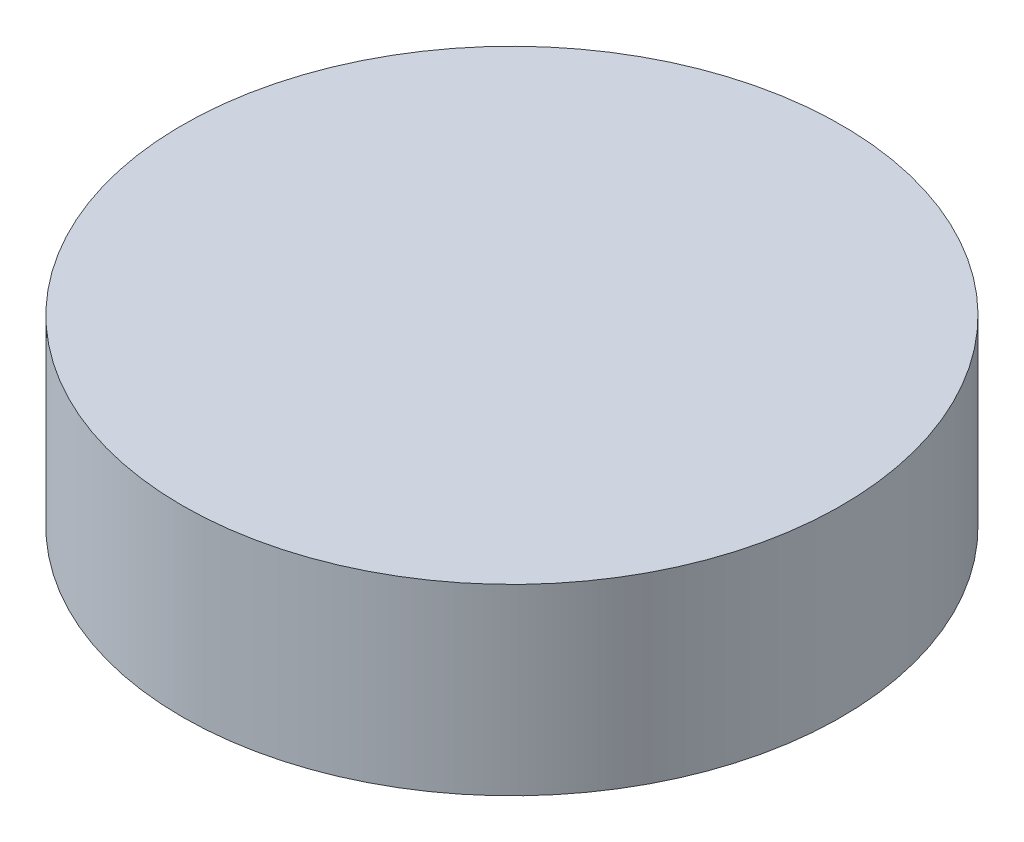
ISO-10303-21;
HEADER;
FILE_DESCRIPTION(('STEP AP214'),'2;1');
FILE_NAME('part.step','',(''),(''),'','','');
FILE_SCHEMA(('AUTOMOTIVE_DESIGN { 1 0 10303 214 1 1 1 1 }'));
ENDSEC;
DATA;
#1=APPLICATION_CONTEXT('core data for automotive mechanical design processes');
#2=APPLICATION_PROTOCOL_DEFINITION('international standard','automotive_design',2000,#1);
#3=PRODUCT_CONTEXT('',#1,'mechanical');
#4=PRODUCT('Part','Part','',(#3));
#5=PRODUCT_RELATED_PRODUCT_CATEGORY('part','',(#4));
#6=PRODUCT_DEFINITION_FORMATION('','',#4);
#7=PRODUCT_DEFINITION_CONTEXT('part definition',#1,'design');
#8=PRODUCT_DEFINITION('design','',#6,#7);
#9=PRODUCT_DEFINITION_SHAPE('','',#8);
#10=(LENGTH_UNIT() NAMED_UNIT(*) SI_UNIT(.MILLI.,.METRE.));
#11=(NAMED_UNIT(*) PLANE_ANGLE_UNIT() SI_UNIT($,.RADIAN.));
#12=(NAMED_UNIT(*) SI_UNIT($,.STERADIAN.) SOLID_ANGLE_UNIT());
#13=UNCERTAINTY_MEASURE_WITH_UNIT(LENGTH_MEASURE(1.E-05),#10,'distance_accuracy_value','');
#14=(GEOMETRIC_REPRESENTATION_CONTEXT(3) GLOBAL_UNCERTAINTY_ASSIGNED_CONTEXT((#13)) GLOBAL_UNIT_ASSIGNED_CONTEXT((#10,
#11,#12)) REPRESENTATION_CONTEXT('',''));
#15=CARTESIAN_POINT('',(0.,0.,0.));
#16=DIRECTION('',(0.,0.,1.));
#17=DIRECTION('',(1.,0.,0.));
#18=AXIS2_PLACEMENT_3D('',#15,#16,#17);
#19=CARTESIAN_POINT('',(9.62341765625,-4.12075355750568,0.));
#20=CARTESIAN_POINT('',(9.62341765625,-4.02700355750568,-3.98615010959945));
#21=CARTESIAN_POINT('',(6.80478388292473,-3.93325355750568,-6.80478388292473));
#22=CARTESIAN_POINT('',(3.98615010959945,-3.83950355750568,-9.62341765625));
#23=CARTESIAN_POINT('',(0.,-3.74575355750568,-9.62341765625));
#24=CARTESIAN_POINT('',(-3.98615010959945,-3.65200355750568,-9.62341765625));
#25=CARTESIAN_POINT('',(-6.80478388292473,-3.55825355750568,-6.80478388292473));
#26=CARTESIAN_POINT('',(-9.62341765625,-3.46450355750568,-3.98615010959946));
#27=CARTESIAN_POINT('',(-9.62341765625,-3.37075355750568,0.));
#28=CARTESIAN_POINT('',(-9.62341765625,-3.27700355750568,3.98615010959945));
#29=CARTESIAN_POINT('',(-6.80478388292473,-3.18325355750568,6.80478388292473));
#30=CARTESIAN_POINT('',(-3.98615010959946,-3.08950355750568,9.62341765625));
#31=CARTESIAN_POINT('',(0.,-2.99575355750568,9.62341765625));
#32=CARTESIAN_POINT('',(3.98615010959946,-2.90200355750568,9.62341765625));
#33=CARTESIAN_POINT('',(6.80478388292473,-2.80825355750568,6.80478388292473));
#34=CARTESIAN_POINT('',(9.62341765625,-2.71450355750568,3.98615010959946));
#35=CARTESIAN_POINT('',(9.62341765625,-2.62075355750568,0.));
#36=CARTESIAN_POINT('',(9.62341765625,-2.52700355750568,-3.98615010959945));
#37=CARTESIAN_POINT('',(6.80478388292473,-2.43325355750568,-6.80478388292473));
#38=CARTESIAN_POINT('',(3.98615010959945,-2.33950355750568,-9.62341765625));
#39=CARTESIAN_POINT('',(0.,-2.24575355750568,-9.62341765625));
#40=CARTESIAN_POINT('',(-3.98615010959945,-2.15200355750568,-9.62341765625));
#41=CARTESIAN_POINT('',(-6.80478388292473,-2.05825355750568,-6.80478388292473));
#42=CARTESIAN_POINT('',(-9.62341765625,-1.96450355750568,-3.98615010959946));
#43=CARTESIAN_POINT('',(-9.62341765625,-1.87075355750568,0.));
#44=CARTESIAN_POINT('',(-9.62341765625,-1.77700355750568,3.98615010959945));
#45=CARTESIAN_POINT('',(-6.80478388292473,-1.68325355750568,6.80478388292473));
#46=CARTESIAN_POINT('',(-3.98615010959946,-1.58950355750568,9.62341765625));
#47=CARTESIAN_POINT('',(0.,-1.49575355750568,9.62341765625));
#48=CARTESIAN_POINT('',(3.98615010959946,-1.40200355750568,9.62341765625));
#49=CARTESIAN_POINT('',(6.80478388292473,-1.30825355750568,6.80478388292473));
#50=CARTESIAN_POINT('',(9.62341765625,-1.21450355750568,3.98615010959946));
#51=CARTESIAN_POINT('',(9.62341765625,-1.12075355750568,0.));
#52=CARTESIAN_POINT('',(9.62341765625,-1.02700355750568,-3.98615010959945));
#53=CARTESIAN_POINT('',(6.80478388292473,-0.933253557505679,-6.80478388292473));
#54=CARTESIAN_POINT('',(3.98615010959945,-0.839503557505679,-9.62341765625));
#55=CARTESIAN_POINT('',(0.,-0.745753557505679,-9.62341765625));
#56=CARTESIAN_POINT('',(-3.98615010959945,-0.652003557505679,-9.62341765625));
#57=CARTESIAN_POINT('',(-6.80478388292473,-0.558253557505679,-6.80478388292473));
#58=CARTESIAN_POINT('',(-9.62341765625,-0.464503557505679,-3.98615010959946));
#59=CARTESIAN_POINT('',(-9.62341765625,-0.370753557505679,0.));
#60=CARTESIAN_POINT('',(-9.62341765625,-0.277003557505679,3.98615010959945));
#61=CARTESIAN_POINT('',(-6.80478388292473,-0.183253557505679,6.80478388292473));
#62=CARTESIAN_POINT('',(-3.98615010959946,-0.0895035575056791,9.62341765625));
#63=CARTESIAN_POINT('',(0.,0.00424644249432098,9.62341765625));
#64=CARTESIAN_POINT('',(3.98615010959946,0.0979964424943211,9.62341765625));
#65=CARTESIAN_POINT('',(6.80478388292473,0.191746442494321,6.80478388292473));
#66=CARTESIAN_POINT('',(9.62341765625,0.285496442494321,3.98615010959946));
#67=CARTESIAN_POINT('',(9.62341765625,0.379246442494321,0.));
#68=CARTESIAN_POINT('',(9.62341765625,0.472996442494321,-3.98615010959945));
#69=CARTESIAN_POINT('',(6.80478388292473,0.566746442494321,-6.80478388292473));
#70=CARTESIAN_POINT('',(3.98615010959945,0.660496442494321,-9.62341765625));
#71=CARTESIAN_POINT('',(0.,0.754246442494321,-9.62341765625));
#72=CARTESIAN_POINT('',(-3.98615010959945,0.847996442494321,-9.62341765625));
#73=CARTESIAN_POINT('',(-6.80478388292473,0.941746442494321,-6.80478388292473));
#74=CARTESIAN_POINT('',(-9.62341765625,1.03549644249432,-3.98615010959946));
#75=CARTESIAN_POINT('',(-9.62341765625,1.12924644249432,0.));
#76=CARTESIAN_POINT('',(-9.62341765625,1.22299644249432,3.98615010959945));
#77=CARTESIAN_POINT('',(-6.80478388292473,1.31674644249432,6.80478388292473));
#78=CARTESIAN_POINT('',(-3.98615010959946,1.41049644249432,9.62341765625));
#79=CARTESIAN_POINT('',(0.,1.50424644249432,9.62341765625));
#80=CARTESIAN_POINT('',(3.98615010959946,1.59799644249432,9.62341765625));
#81=CARTESIAN_POINT('',(6.80478388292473,1.69174644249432,6.80478388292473));
#82=CARTESIAN_POINT('',(9.62341765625,1.78549644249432,3.98615010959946));
#83=CARTESIAN_POINT('',(9.62341765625,1.87924644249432,0.));
#84=CARTESIAN_POINT('',(9.62341765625,1.97299644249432,-3.98615010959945));
#85=CARTESIAN_POINT('',(6.80478388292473,2.06674644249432,-6.80478388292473));
#86=CARTESIAN_POINT('',(3.98615010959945,2.16049644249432,-9.62341765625));
#87=CARTESIAN_POINT('',(0.,2.25424644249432,-9.62341765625));
#88=CARTESIAN_POINT('',(-3.98615010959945,2.34799644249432,-9.62341765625));
#89=CARTESIAN_POINT('',(-6.80478388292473,2.44174644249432,-6.80478388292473));
#90=CARTESIAN_POINT('',(-9.62341765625,2.53549644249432,-3.98615010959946));
#91=CARTESIAN_POINT('',(-9.62341765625,2.62924644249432,0.));
#92=CARTESIAN_POINT('',(-9.62341765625,2.72299644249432,3.98615010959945));
#93=CARTESIAN_POINT('',(-6.80478388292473,2.81674644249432,6.80478388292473));
#94=CARTESIAN_POINT('',(-3.98615010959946,2.91049644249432,9.62341765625));
#95=CARTESIAN_POINT('',(0.,3.00424644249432,9.62341765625));
#96=CARTESIAN_POINT('',(3.98615010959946,3.09799644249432,9.62341765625));
#97=CARTESIAN_POINT('',(6.80478388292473,3.19174644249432,6.80478388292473));
#98=CARTESIAN_POINT('',(9.62341765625,3.28549644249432,3.98615010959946));
#99=CARTESIAN_POINT('',(9.62341765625,3.37924644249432,0.));
#100=CARTESIAN_POINT('',(9.62341765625,3.47299644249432,-3.98615010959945));
#101=CARTESIAN_POINT('',(6.80478388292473,3.56674644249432,-6.80478388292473));
#102=CARTESIAN_POINT('',(3.98615010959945,3.66049644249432,-9.62341765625));
#103=CARTESIAN_POINT('',(0.,3.75424644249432,-9.62341765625));
#104=CARTESIAN_POINT('',(-2.5785796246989,3.81489188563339,-9.62341765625));
#105=CARTESIAN_POINT('',(-4.81169692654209,3.87997247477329,-8.33413103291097));
#106=CARTESIAN_POINT('',(-6.22020607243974,3.92102119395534,-7.52093058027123));
#107=CARTESIAN_POINT('',(-7.62871521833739,3.9620699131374,-6.70773012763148));
#108=CARTESIAN_POINT('',(10.3,-4.51137855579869,0.));
#109=CARTESIAN_POINT('',(10.3,-4.41762855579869,-4.26639969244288));
#110=CARTESIAN_POINT('',(7.28319984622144,-4.32387855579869,-7.28319984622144));
#111=CARTESIAN_POINT('',(4.26639969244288,-4.23012855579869,-10.3));
#112=CARTESIAN_POINT('',(0.,-4.13637855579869,-10.3));
#113=CARTESIAN_POINT('',(-4.26639969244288,-4.04262855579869,-10.3));
#114=CARTESIAN_POINT('',(-7.28319984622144,-3.94887855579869,-7.28319984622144));
#115=CARTESIAN_POINT('',(-10.3,-3.85512855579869,-4.26639969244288));
#116=CARTESIAN_POINT('',(-10.3,-3.76137855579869,0.));
#117=CARTESIAN_POINT('',(-10.3,-3.66762855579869,4.26639969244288));
#118=CARTESIAN_POINT('',(-7.28319984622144,-3.57387855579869,7.28319984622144));
#119=CARTESIAN_POINT('',(-4.26639969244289,-3.48012855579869,10.3));
#120=CARTESIAN_POINT('',(0.,-3.38637855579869,10.3));
#121=CARTESIAN_POINT('',(4.26639969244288,-3.29262855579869,10.3));
#122=CARTESIAN_POINT('',(7.28319984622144,-3.19887855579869,7.28319984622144));
#123=CARTESIAN_POINT('',(10.3,-3.10512855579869,4.26639969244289));
#124=CARTESIAN_POINT('',(10.3,-3.01137855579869,0.));
#125=CARTESIAN_POINT('',(10.3,-2.91762855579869,-4.26639969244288));
#126=CARTESIAN_POINT('',(7.28319984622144,-2.82387855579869,-7.28319984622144));
#127=CARTESIAN_POINT('',(4.26639969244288,-2.73012855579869,-10.3));
#128=CARTESIAN_POINT('',(0.,-2.63637855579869,-10.3));
#129=CARTESIAN_POINT('',(-4.26639969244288,-2.54262855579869,-10.3));
#130=CARTESIAN_POINT('',(-7.28319984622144,-2.44887855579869,-7.28319984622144));
#131=CARTESIAN_POINT('',(-10.3,-2.35512855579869,-4.26639969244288));
#132=CARTESIAN_POINT('',(-10.3,-2.26137855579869,0.));
#133=CARTESIAN_POINT('',(-10.3,-2.16762855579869,4.26639969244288));
#134=CARTESIAN_POINT('',(-7.28319984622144,-2.07387855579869,7.28319984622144));
#135=CARTESIAN_POINT('',(-4.26639969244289,-1.98012855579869,10.3));
#136=CARTESIAN_POINT('',(0.,-1.88637855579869,10.3));
#137=CARTESIAN_POINT('',(4.26639969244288,-1.79262855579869,10.3));
#138=CARTESIAN_POINT('',(7.28319984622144,-1.69887855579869,7.28319984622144));
#139=CARTESIAN_POINT('',(10.3,-1.60512855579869,4.26639969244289));
#140=CARTESIAN_POINT('',(10.3,-1.51137855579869,0.));
#141=CARTESIAN_POINT('',(10.3,-1.41762855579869,-4.26639969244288));
#142=CARTESIAN_POINT('',(7.28319984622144,-1.32387855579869,-7.28319984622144));
#143=CARTESIAN_POINT('',(4.26639969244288,-1.23012855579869,-10.3));
#144=CARTESIAN_POINT('',(0.,-1.13637855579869,-10.3));
#145=CARTESIAN_POINT('',(-4.26639969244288,-1.04262855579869,-10.3));
#146=CARTESIAN_POINT('',(-7.28319984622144,-0.948878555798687,-7.28319984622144));
#147=CARTESIAN_POINT('',(-10.3,-0.855128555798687,-4.26639969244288));
#148=CARTESIAN_POINT('',(-10.3,-0.761378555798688,0.));
#149=CARTESIAN_POINT('',(-10.3,-0.667628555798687,4.26639969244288));
#150=CARTESIAN_POINT('',(-7.28319984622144,-0.573878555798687,7.28319984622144));
#151=CARTESIAN_POINT('',(-4.26639969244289,-0.480128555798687,10.3));
#152=CARTESIAN_POINT('',(0.,-0.386378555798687,10.3));
#153=CARTESIAN_POINT('',(4.26639969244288,-0.292628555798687,10.3));
#154=CARTESIAN_POINT('',(7.28319984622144,-0.198878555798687,7.28319984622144));
#155=CARTESIAN_POINT('',(10.3,-0.105128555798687,4.26639969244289));
#156=CARTESIAN_POINT('',(10.3,-0.0113785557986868,0.));
#157=CARTESIAN_POINT('',(10.3,0.0823714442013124,-4.26639969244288));
#158=CARTESIAN_POINT('',(7.28319984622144,0.176121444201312,-7.28319984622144));
#159=CARTESIAN_POINT('',(4.26639969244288,0.269871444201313,-10.3));
#160=CARTESIAN_POINT('',(0.,0.363621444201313,-10.3));
#161=CARTESIAN_POINT('',(-4.26639969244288,0.457371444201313,-10.3));
#162=CARTESIAN_POINT('',(-7.28319984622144,0.551121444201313,-7.28319984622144));
#163=CARTESIAN_POINT('',(-10.3,0.644871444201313,-4.26639969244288));
#164=CARTESIAN_POINT('',(-10.3,0.738621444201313,0.));
#165=CARTESIAN_POINT('',(-10.3,0.832371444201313,4.26639969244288));
#166=CARTESIAN_POINT('',(-7.28319984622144,0.926121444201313,7.28319984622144));
#167=CARTESIAN_POINT('',(-4.26639969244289,1.01987144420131,10.3));
#168=CARTESIAN_POINT('',(0.,1.11362144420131,10.3));
#169=CARTESIAN_POINT('',(4.26639969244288,1.20737144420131,10.3));
#170=CARTESIAN_POINT('',(7.28319984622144,1.30112144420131,7.28319984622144));
#171=CARTESIAN_POINT('',(10.3,1.39487144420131,4.26639969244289));
#172=CARTESIAN_POINT('',(10.3,1.48862144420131,0.));
#173=CARTESIAN_POINT('',(10.3,1.58237144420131,-4.26639969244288));
#174=CARTESIAN_POINT('',(7.28319984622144,1.67612144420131,-7.28319984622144));
#175=CARTESIAN_POINT('',(4.26639969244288,1.76987144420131,-10.3));
#176=CARTESIAN_POINT('',(0.,1.86362144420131,-10.3));
#177=CARTESIAN_POINT('',(-4.26639969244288,1.95737144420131,-10.3));
#178=CARTESIAN_POINT('',(-7.28319984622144,2.05112144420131,-7.28319984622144));
#179=CARTESIAN_POINT('',(-10.3,2.14487144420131,-4.26639969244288));
#180=CARTESIAN_POINT('',(-10.3,2.23862144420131,0.));
#181=CARTESIAN_POINT('',(-10.3,2.33237144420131,4.26639969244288));
#182=CARTESIAN_POINT('',(-7.28319984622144,2.42612144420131,7.28319984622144));
#183=CARTESIAN_POINT('',(-4.26639969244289,2.51987144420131,10.3));
#184=CARTESIAN_POINT('',(0.,2.61362144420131,10.3));
#185=CARTESIAN_POINT('',(4.26639969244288,2.70737144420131,10.3));
#186=CARTESIAN_POINT('',(7.28319984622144,2.80112144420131,7.28319984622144));
#187=CARTESIAN_POINT('',(10.3,2.89487144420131,4.26639969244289));
#188=CARTESIAN_POINT('',(10.3,2.98862144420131,0.));
#189=CARTESIAN_POINT('',(10.3,3.08237144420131,-4.26639969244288));
#190=CARTESIAN_POINT('',(7.28319984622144,3.17612144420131,-7.28319984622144));
#191=CARTESIAN_POINT('',(4.26639969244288,3.26987144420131,-10.3));
#192=CARTESIAN_POINT('',(0.,3.36362144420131,-10.3));
#193=CARTESIAN_POINT('',(-2.75986879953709,3.42426688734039,-10.3));
#194=CARTESIAN_POINT('',(-5.14998726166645,3.48934747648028,-8.9200690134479));
#195=CARTESIAN_POINT('',(-6.65752280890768,3.53039619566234,-8.04969582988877));
#196=CARTESIAN_POINT('',(-8.16505835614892,3.57144491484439,-7.17932264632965));
#197=(BOUNDED_SURFACE() B_SPLINE_SURFACE(1,2,((#19,#20,#21,#22,#23,#24,#25,#26,#27,#28,#29,#30,
#31,#32,#33,#34,#35,#36,#37,#38,#39,#40,#41,#42,#43,#44,#45,#46,#47,#48,#49,#50,#51,#52,#53,#54,
#55,#56,#57,#58,#59,#60,#61,#62,#63,#64,#65,#66,#67,#68,#69,#70,#71,#72,#73,#74,#75,#76,#77,#78,
#79,#80,#81,#82,#83,#84,#85,#86,#87,#88,#89,#90,#91,#92,#93,#94,#95,#96,#97,#98,#99,#100,#101,
#102,#103,#104,#105,#106,#107),(#108,#109,#110,#111,#112,#113,#114,#115,#116,#117,#118,#119,
#120,#121,#122,#123,#124,#125,#126,#127,#128,#129,#130,#131,#132,#133,#134,#135,#136,#137,#138,
#139,#140,#141,#142,#143,#144,#145,#146,#147,#148,#149,#150,#151,#152,#153,#154,#155,#156,#157,
#158,#159,#160,#161,#162,#163,#164,#165,#166,#167,#168,#169,#170,#171,#172,#173,#174,#175,#176,
#177,#178,#179,#180,#181,#182,#183,#184,#185,#186,#187,#188,#189,#190,#191,#192,#193,#194,#195,
#196)),.UNSPECIFIED.,.F.,.F.,.F.) B_SPLINE_SURFACE_WITH_KNOTS((2,2),(3,2,2,2,2,2,2,2,2,2,2,2,2,
2,2,2,2,2,2,2,2,2,2,2,2,2,2,2,2,2,2,2,2,2,2,2,2,2,2,2,2,2,2,2,3),(0.,1.),(0.,0.0208333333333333,
0.0416666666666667,0.0625,0.0833333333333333,0.104166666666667,0.125,0.145833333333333,
0.166666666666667,0.1875,0.208333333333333,0.229166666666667,0.25,0.270833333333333,
0.291666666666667,0.3125,0.333333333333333,0.354166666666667,0.375,0.395833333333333,
0.416666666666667,0.4375,0.458333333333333,0.479166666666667,0.5,0.520833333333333,
0.541666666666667,0.5625,0.583333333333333,0.604166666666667,0.625,0.645833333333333,
0.666666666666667,0.6875,0.708333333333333,0.729166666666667,0.75,0.770833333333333,
0.791666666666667,0.8125,0.833333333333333,0.854166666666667,0.875,0.888849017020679,
0.897737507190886),
.UNSPECIFIED.) GEOMETRIC_REPRESENTATION_ITEM() RATIONAL_B_SPLINE_SURFACE(((1.,0.923879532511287,
1.,0.923879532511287,1.,0.923879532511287,1.,0.923879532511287,1.,0.923879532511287,1.,
0.923879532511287,1.,0.923879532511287,1.,0.923879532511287,1.,0.923879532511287,1.,
0.923879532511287,1.,0.923879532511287,1.,0.923879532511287,1.,0.923879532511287,1.,
0.923879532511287,1.,0.923879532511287,1.,0.923879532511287,1.,0.923879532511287,1.,
0.923879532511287,1.,0.923879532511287,1.,0.923879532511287,1.,0.923879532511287,1.,
0.923879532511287,1.,0.923879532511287,1.,0.923879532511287,1.,0.923879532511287,1.,
0.923879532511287,1.,0.923879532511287,1.,0.923879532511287,1.,0.923879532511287,1.,
0.923879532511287,1.,0.923879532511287,1.,0.923879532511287,1.,0.923879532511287,1.,
0.923879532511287,1.,0.923879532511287,1.,0.923879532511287,1.,0.923879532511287,1.,
0.923879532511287,1.,0.923879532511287,1.,0.923879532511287,1.,0.923879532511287,1.,
0.923879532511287,1.,0.949398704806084,0.966072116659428,0.966072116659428,0.966072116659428),
(1.,0.923879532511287,1.,0.923879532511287,1.,0.923879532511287,1.,0.923879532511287,1.,
0.923879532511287,1.,0.923879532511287,1.,0.923879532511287,1.,0.923879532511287,1.,
0.923879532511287,1.,0.923879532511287,1.,0.923879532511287,1.,0.923879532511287,1.,
0.923879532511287,1.,0.923879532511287,1.,0.923879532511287,1.,0.923879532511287,1.,
0.923879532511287,1.,0.923879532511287,1.,0.923879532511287,1.,0.923879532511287,1.,
0.923879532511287,1.,0.923879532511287,1.,0.923879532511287,1.,0.923879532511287,1.,
0.923879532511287,1.,0.923879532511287,1.,0.923879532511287,1.,0.923879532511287,1.,
0.923879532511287,1.,0.923879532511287,1.,0.923879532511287,1.,0.923879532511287,1.,
0.923879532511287,1.,0.923879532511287,1.,0.923879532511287,1.,0.923879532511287,1.,
0.923879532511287,1.,0.923879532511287,1.,0.923879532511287,1.,0.923879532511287,1.,
0.923879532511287,1.,0.923879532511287,1.,0.949398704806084,0.966072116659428,0.966072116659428,0.966072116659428))) REPRESENTATION_ITEM('') SURFACE());
#198=CARTESIAN_POINT('',(-0.655111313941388,-1.51137855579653,9.60109350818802));
#199=CARTESIAN_POINT('',(-0.58600809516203,-1.51137855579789,9.60871538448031));
#200=CARTESIAN_POINT('',(-0.516823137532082,-1.51137855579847,9.61558123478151));
#201=CARTESIAN_POINT('',(-0.378320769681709,-1.51137855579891,9.62778967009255));
#202=CARTESIAN_POINT('',(-0.309003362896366,-1.51137855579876,9.63313229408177));
#203=CARTESIAN_POINT('',(-0.10090549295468,-1.51137855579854,9.6468582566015));
#204=CARTESIAN_POINT('',(0.038032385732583,-1.51137855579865,9.65294098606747));
#205=CARTESIAN_POINT('',(0.316019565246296,-1.51137855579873,9.65920177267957));
#206=CARTESIAN_POINT('',(0.455068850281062,-1.5113785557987,9.65938055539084));
#207=CARTESIAN_POINT('',(0.733043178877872,-1.51137855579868,9.65382501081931));
#208=CARTESIAN_POINT('',(0.871968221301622,-1.51137855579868,9.64809062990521));
#209=CARTESIAN_POINT('',(1.28185256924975,-1.51137855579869,9.62242637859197));
#210=CARTESIAN_POINT('',(1.5523391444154,-1.51137855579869,9.59417307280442));
#211=CARTESIAN_POINT('',(2.08999371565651,-1.51137855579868,9.51530582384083));
#212=CARTESIAN_POINT('',(2.35716175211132,-1.51137855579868,9.46469215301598));
#213=CARTESIAN_POINT('',(2.88636235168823,-1.51137855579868,9.34145688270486));
#214=CARTESIAN_POINT('',(3.14839528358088,-1.51137855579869,9.26883686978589));
#215=CARTESIAN_POINT('',(3.66552603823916,-1.51137855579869,9.10208842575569));
#216=CARTESIAN_POINT('',(3.92062377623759,-1.51137855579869,9.00795973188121));
#217=CARTESIAN_POINT('',(4.42212285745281,-1.51137855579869,8.79884375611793));
#218=CARTESIAN_POINT('',(4.66852426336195,-1.51137855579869,8.68385662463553));
#219=CARTESIAN_POINT('',(5.15092118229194,-1.51137855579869,8.43382629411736));
#220=CARTESIAN_POINT('',(5.38691668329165,-1.51137855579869,8.29878307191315));
#221=CARTESIAN_POINT('',(5.84690875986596,-1.51137855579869,8.00954625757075));
#222=CARTESIAN_POINT('',(6.07090533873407,-1.51137855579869,7.85535267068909));
#223=CARTESIAN_POINT('',(6.39666186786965,-1.51137855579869,7.6105655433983));
#224=CARTESIAN_POINT('',(6.50355022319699,-1.51137855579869,7.52671215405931));
#225=CARTESIAN_POINT('',(6.71376719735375,-1.51137855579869,7.35462956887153));
#226=CARTESIAN_POINT('',(6.81709560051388,-1.51137855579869,7.26640010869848));
#227=CARTESIAN_POINT('',(7.01996079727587,-1.51137855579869,7.08574478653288));
#228=CARTESIAN_POINT('',(7.11949866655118,-1.51137855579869,6.99332013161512));
#229=CARTESIAN_POINT('',(7.31478712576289,-1.51137855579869,6.80456738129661));
#230=CARTESIAN_POINT('',(7.41053774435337,-1.51137855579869,6.70823931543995));
#231=CARTESIAN_POINT('',(7.69186008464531,-1.51137855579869,6.41358683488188));
#232=CARTESIAN_POINT('',(7.87153442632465,-1.51137855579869,6.20956548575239));
#233=CARTESIAN_POINT('',(8.21388183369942,-1.51137855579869,5.7877813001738));
#234=CARTESIAN_POINT('',(8.37655555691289,-1.51137855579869,5.57001899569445));
#235=CARTESIAN_POINT('',(8.68387555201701,-1.51137855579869,5.12213171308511));
#236=CARTESIAN_POINT('',(8.82852281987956,-1.51137855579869,4.89200741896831));
#237=CARTESIAN_POINT('',(9.09886079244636,-1.51137855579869,4.42087520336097));
#238=CARTESIAN_POINT('',(9.22455093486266,-1.51137855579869,4.17986695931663));
#239=CARTESIAN_POINT('',(9.45615860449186,-1.51137855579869,3.68852942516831));
#240=CARTESIAN_POINT('',(9.56207619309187,-1.51137855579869,3.43820016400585));
#241=CARTESIAN_POINT('',(9.7523098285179,-1.51137855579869,2.93287897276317));
#242=CARTESIAN_POINT('',(9.83686878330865,-1.51137855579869,2.67797845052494));
#243=CARTESIAN_POINT('',(9.98546139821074,-1.51137855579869,2.16235193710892));
#244=CARTESIAN_POINT('',(10.0495015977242,-1.51137855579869,1.90162783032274));
#245=CARTESIAN_POINT('',(10.1579250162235,-1.51137855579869,1.36982485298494));
#246=CARTESIAN_POINT('',(10.2018184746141,-1.51137855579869,1.09864602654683));
#247=CARTESIAN_POINT('',(10.267689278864,-1.51137855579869,0.551801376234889));
#248=CARTESIAN_POINT('',(10.2895182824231,-1.51137855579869,0.276117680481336));
#249=CARTESIAN_POINT('',(10.3,-1.51137855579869,0.));
#250=B_SPLINE_CURVE_WITH_KNOTS('',3,(#198,#199,#200,#201,#202,#203,#204,#205,#206,#207,#208,
#209,#210,#211,#212,#213,#214,#215,#216,#217,#218,#219,#220,#221,#222,#223,#224,#225,#226,#227,
#228,#229,#230,#231,#232,#233,#234,#235,#236,#237,#238,#239,#240,#241,#242,#243,#244,#245,#246,
#247,#248,#249),.UNSPECIFIED.,.F.,.F.,(4,2,2,2,2,2,2,2,2,2,2,2,2,2,2,2,2,2,2,2,2,2,2,2,2,4),(0.,
0.208559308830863,0.4171132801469,0.834185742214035,1.25120694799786,1.66823193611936,
2.48308469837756,3.29792753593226,4.11271164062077,4.92750569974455,5.74229388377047,
6.55708300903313,7.37187191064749,7.77934032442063,8.18683338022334,8.59420992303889,
9.0015833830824,9.8162015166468,10.6307881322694,11.4453297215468,12.2598954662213,
13.074458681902,13.8792923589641,14.6838692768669,15.5070856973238,16.3358006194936),.UNSPECIFIED.);
#251=CARTESIAN_POINT('',(-0.655111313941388,-1.51137855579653,9.60109350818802));
#252=VERTEX_POINT('',#251);
#253=CARTESIAN_POINT('',(9.89502265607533,-1.51137855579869,2.47558611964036));
#254=VERTEX_POINT('',#253);
#255=EDGE_CURVE('E117',#252,#254,#250,.T.);
#256=CARTESIAN_POINT('',(9.62341765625,-4.12075355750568,0.));
#257=CARTESIAN_POINT('',(9.62341765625,-4.02700355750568,-3.98615010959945));
#258=CARTESIAN_POINT('',(6.80478388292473,-3.93325355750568,-6.80478388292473));
#259=CARTESIAN_POINT('',(3.98615010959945,-3.83950355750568,-9.62341765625));
#260=CARTESIAN_POINT('',(0.,-3.74575355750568,-9.62341765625));
#261=CARTESIAN_POINT('',(-3.98615010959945,-3.65200355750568,-9.62341765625));
#262=CARTESIAN_POINT('',(-6.80478388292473,-3.55825355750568,-6.80478388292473));
#263=CARTESIAN_POINT('',(-9.62341765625,-3.46450355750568,-3.98615010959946));
#264=CARTESIAN_POINT('',(-9.62341765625,-3.37075355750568,0.));
#265=CARTESIAN_POINT('',(-9.62341765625,-3.27700355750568,3.98615010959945));
#266=CARTESIAN_POINT('',(-6.80478388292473,-3.18325355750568,6.80478388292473));
#267=CARTESIAN_POINT('',(-3.98615010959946,-3.08950355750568,9.62341765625));
#268=CARTESIAN_POINT('',(0.,-2.99575355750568,9.62341765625));
#269=CARTESIAN_POINT('',(3.98615010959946,-2.90200355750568,9.62341765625));
#270=CARTESIAN_POINT('',(6.80478388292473,-2.80825355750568,6.80478388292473));
#271=CARTESIAN_POINT('',(9.62341765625,-2.71450355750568,3.98615010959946));
#272=CARTESIAN_POINT('',(9.62341765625,-2.62075355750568,0.));
#273=CARTESIAN_POINT('',(9.62341765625,-2.52700355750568,-3.98615010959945));
#274=CARTESIAN_POINT('',(6.80478388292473,-2.43325355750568,-6.80478388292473));
#275=CARTESIAN_POINT('',(3.98615010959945,-2.33950355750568,-9.62341765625));
#276=CARTESIAN_POINT('',(0.,-2.24575355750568,-9.62341765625));
#277=CARTESIAN_POINT('',(-3.98615010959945,-2.15200355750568,-9.62341765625));
#278=CARTESIAN_POINT('',(-6.80478388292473,-2.05825355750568,-6.80478388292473));
#279=CARTESIAN_POINT('',(-9.62341765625,-1.96450355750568,-3.98615010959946));
#280=CARTESIAN_POINT('',(-9.62341765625,-1.87075355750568,0.));
#281=CARTESIAN_POINT('',(-9.62341765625,-1.77700355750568,3.98615010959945));
#282=CARTESIAN_POINT('',(-6.80478388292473,-1.68325355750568,6.80478388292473));
#283=CARTESIAN_POINT('',(-3.98615010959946,-1.58950355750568,9.62341765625));
#284=CARTESIAN_POINT('',(0.,-1.49575355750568,9.62341765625));
#285=CARTESIAN_POINT('',(3.98615010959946,-1.40200355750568,9.62341765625));
#286=CARTESIAN_POINT('',(6.80478388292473,-1.30825355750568,6.80478388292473));
#287=CARTESIAN_POINT('',(9.62341765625,-1.21450355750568,3.98615010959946));
#288=CARTESIAN_POINT('',(9.62341765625,-1.12075355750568,0.));
#289=CARTESIAN_POINT('',(9.62341765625,-1.02700355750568,-3.98615010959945));
#290=CARTESIAN_POINT('',(6.80478388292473,-0.933253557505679,-6.80478388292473));
#291=CARTESIAN_POINT('',(3.98615010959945,-0.839503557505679,-9.62341765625));
#292=CARTESIAN_POINT('',(0.,-0.745753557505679,-9.62341765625));
#293=CARTESIAN_POINT('',(-3.98615010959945,-0.652003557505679,-9.62341765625));
#294=CARTESIAN_POINT('',(-6.80478388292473,-0.558253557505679,-6.80478388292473));
#295=CARTESIAN_POINT('',(-9.62341765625,-0.464503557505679,-3.98615010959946));
#296=CARTESIAN_POINT('',(-9.62341765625,-0.370753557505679,0.));
#297=CARTESIAN_POINT('',(-9.62341765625,-0.277003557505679,3.98615010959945));
#298=CARTESIAN_POINT('',(-6.80478388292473,-0.183253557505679,6.80478388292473));
#299=CARTESIAN_POINT('',(-3.98615010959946,-0.0895035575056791,9.62341765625));
#300=CARTESIAN_POINT('',(0.,0.00424644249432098,9.62341765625));
#301=CARTESIAN_POINT('',(3.98615010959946,0.0979964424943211,9.62341765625));
#302=CARTESIAN_POINT('',(6.80478388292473,0.191746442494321,6.80478388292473));
#303=CARTESIAN_POINT('',(9.62341765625,0.285496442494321,3.98615010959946));
#304=CARTESIAN_POINT('',(9.62341765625,0.379246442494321,0.));
#305=CARTESIAN_POINT('',(9.62341765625,0.472996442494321,-3.98615010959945));
#306=CARTESIAN_POINT('',(6.80478388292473,0.566746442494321,-6.80478388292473));
#307=CARTESIAN_POINT('',(3.98615010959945,0.660496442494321,-9.62341765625));
#308=CARTESIAN_POINT('',(0.,0.754246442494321,-9.62341765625));
#309=CARTESIAN_POINT('',(-3.98615010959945,0.847996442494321,-9.62341765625));
#310=CARTESIAN_POINT('',(-6.80478388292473,0.941746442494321,-6.80478388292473));
#311=CARTESIAN_POINT('',(-9.62341765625,1.03549644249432,-3.98615010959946));
#312=CARTESIAN_POINT('',(-9.62341765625,1.12924644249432,0.));
#313=CARTESIAN_POINT('',(-9.62341765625,1.22299644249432,3.98615010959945));
#314=CARTESIAN_POINT('',(-6.80478388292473,1.31674644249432,6.80478388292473));
#315=CARTESIAN_POINT('',(-3.98615010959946,1.41049644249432,9.62341765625));
#316=CARTESIAN_POINT('',(0.,1.50424644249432,9.62341765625));
#317=CARTESIAN_POINT('',(3.98615010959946,1.59799644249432,9.62341765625));
#318=CARTESIAN_POINT('',(6.80478388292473,1.69174644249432,6.80478388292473));
#319=CARTESIAN_POINT('',(9.62341765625,1.78549644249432,3.98615010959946));
#320=CARTESIAN_POINT('',(9.62341765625,1.87924644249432,0.));
#321=CARTESIAN_POINT('',(9.62341765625,1.97299644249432,-3.98615010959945));
#322=CARTESIAN_POINT('',(6.80478388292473,2.06674644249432,-6.80478388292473));
#323=CARTESIAN_POINT('',(3.98615010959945,2.16049644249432,-9.62341765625));
#324=CARTESIAN_POINT('',(0.,2.25424644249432,-9.62341765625));
#325=CARTESIAN_POINT('',(-3.98615010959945,2.34799644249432,-9.62341765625));
#326=CARTESIAN_POINT('',(-6.80478388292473,2.44174644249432,-6.80478388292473));
#327=CARTESIAN_POINT('',(-9.62341765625,2.53549644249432,-3.98615010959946));
#328=CARTESIAN_POINT('',(-9.62341765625,2.62924644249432,0.));
#329=CARTESIAN_POINT('',(-9.62341765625,2.72299644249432,3.98615010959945));
#330=CARTESIAN_POINT('',(-6.80478388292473,2.81674644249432,6.80478388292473));
#331=CARTESIAN_POINT('',(-3.98615010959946,2.91049644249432,9.62341765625));
#332=CARTESIAN_POINT('',(0.,3.00424644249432,9.62341765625));
#333=CARTESIAN_POINT('',(3.98615010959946,3.09799644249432,9.62341765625));
#334=CARTESIAN_POINT('',(6.80478388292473,3.19174644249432,6.80478388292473));
#335=CARTESIAN_POINT('',(9.62341765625,3.28549644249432,3.98615010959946));
#336=CARTESIAN_POINT('',(9.62341765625,3.37924644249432,0.));
#337=CARTESIAN_POINT('',(9.62341765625,3.47299644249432,-3.98615010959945));
#338=CARTESIAN_POINT('',(6.80478388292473,3.56674644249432,-6.80478388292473));
#339=CARTESIAN_POINT('',(3.98615010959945,3.66049644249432,-9.62341765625));
#340=CARTESIAN_POINT('',(0.,3.75424644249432,-9.62341765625));
#341=CARTESIAN_POINT('',(-2.5785796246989,3.81489188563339,-9.62341765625));
#342=CARTESIAN_POINT('',(-4.81169692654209,3.87997247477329,-8.33413103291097));
#343=CARTESIAN_POINT('',(-6.22020607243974,3.92102119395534,-7.52093058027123));
#344=CARTESIAN_POINT('',(-7.62871521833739,3.9620699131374,-6.70773012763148));
#345=(BOUNDED_CURVE() B_SPLINE_CURVE(2,(#256,#257,#258,#259,#260,#261,#262,#263,#264,#265,#266,
#267,#268,#269,#270,#271,#272,#273,#274,#275,#276,#277,#278,#279,#280,#281,#282,#283,#284,#285,
#286,#287,#288,#289,#290,#291,#292,#293,#294,#295,#296,#297,#298,#299,#300,#301,#302,#303,#304,
#305,#306,#307,#308,#309,#310,#311,#312,#313,#314,#315,#316,#317,#318,#319,#320,#321,#322,#323,
#324,#325,#326,#327,#328,#329,#330,#331,#332,#333,#334,#335,#336,#337,#338,#339,#340,#341,#342,
#343,#344),.UNSPECIFIED.,.F.,.F.) B_SPLINE_CURVE_WITH_KNOTS((3,2,2,2,2,2,2,2,2,2,2,2,2,2,2,2,2,
2,2,2,2,2,2,2,2,2,2,2,2,2,2,2,2,2,2,2,2,2,2,2,2,2,2,2,3),(0.,0.0208333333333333,
0.0416666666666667,0.0625,0.0833333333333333,0.104166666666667,0.125,0.145833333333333,
0.166666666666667,0.1875,0.208333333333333,0.229166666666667,0.25,0.270833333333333,
0.291666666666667,0.3125,0.333333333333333,0.354166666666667,0.375,0.395833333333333,
0.416666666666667,0.4375,0.458333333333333,0.479166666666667,0.5,0.520833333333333,
0.541666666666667,0.5625,0.583333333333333,0.604166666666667,0.625,0.645833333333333,
0.666666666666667,0.6875,0.708333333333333,0.729166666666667,0.75,0.770833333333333,
0.791666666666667,0.8125,0.833333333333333,0.854166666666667,0.875,0.888849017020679,
0.897737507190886),
.UNSPECIFIED.) CURVE() GEOMETRIC_REPRESENTATION_ITEM() RATIONAL_B_SPLINE_CURVE((1.,
0.923879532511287,1.,0.923879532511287,1.,0.923879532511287,1.,0.923879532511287,1.,
0.923879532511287,1.,0.923879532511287,1.,0.923879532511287,1.,0.923879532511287,1.,
0.923879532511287,1.,0.923879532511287,1.,0.923879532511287,1.,0.923879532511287,1.,
0.923879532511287,1.,0.923879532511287,1.,0.923879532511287,1.,0.923879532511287,1.,
0.923879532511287,1.,0.923879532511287,1.,0.923879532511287,1.,0.923879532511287,1.,
0.923879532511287,1.,0.923879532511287,1.,0.923879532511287,1.,0.923879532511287,1.,
0.923879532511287,1.,0.923879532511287,1.,0.923879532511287,1.,0.923879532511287,1.,
0.923879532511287,1.,0.923879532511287,1.,0.923879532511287,1.,0.923879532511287,1.,
0.923879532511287,1.,0.923879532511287,1.,0.923879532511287,1.,0.923879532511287,1.,
0.923879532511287,1.,0.923879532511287,1.,0.923879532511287,1.,0.923879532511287,1.,
0.923879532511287,1.,0.923879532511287,1.,0.949398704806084,0.966072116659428,0.966072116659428,0.966072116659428)) REPRESENTATION_ITEM(''));
#346=CARTESIAN_POINT('',(8.63789012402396,3.48862144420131,-4.24228966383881));
#347=VERTEX_POINT('',#346);
#348=EDGE_CURVE('E112',#252,#347,#345,.T.);
#349=CARTESIAN_POINT('',(-5.1233055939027,3.48862144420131,-8.93542051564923));
#350=CARTESIAN_POINT('',(-4.87679125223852,3.48862144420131,-9.06371780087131));
#351=CARTESIAN_POINT('',(-4.62503264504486,3.48862144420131,-9.18192839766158));
#352=CARTESIAN_POINT('',(-4.11275684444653,3.48862144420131,-9.39749524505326));
#353=CARTESIAN_POINT('',(-3.85224016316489,3.48862144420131,-9.49485271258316));
#354=CARTESIAN_POINT('',(-3.32414065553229,3.48862144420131,-9.66805019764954));
#355=CARTESIAN_POINT('',(-3.05655760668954,3.48862144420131,-9.74388953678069));
#356=CARTESIAN_POINT('',(-2.51610854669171,3.48862144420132,-9.87354959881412));
#357=CARTESIAN_POINT('',(-2.24324255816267,3.48862144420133,-9.92737041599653));
#358=CARTESIAN_POINT('',(-1.69404846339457,3.48862144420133,-10.012644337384));
#359=CARTESIAN_POINT('',(-1.41772039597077,3.48862144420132,-10.0440976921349));
#360=CARTESIAN_POINT('',(-0.86338267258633,3.48862144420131,-10.0843998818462));
#361=CARTESIAN_POINT('',(-0.585372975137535,3.48862144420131,-10.0932481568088));
#362=CARTESIAN_POINT('',(-0.169319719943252,3.48862144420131,-10.0896205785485));
#363=CARTESIAN_POINT('',(-0.031155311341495,3.48862144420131,-10.0856270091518));
#364=CARTESIAN_POINT('',(0.244886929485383,3.48862144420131,-10.0718962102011));
#365=CARTESIAN_POINT('',(0.38276476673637,3.48862144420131,-10.0621590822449));
#366=CARTESIAN_POINT('',(0.795580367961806,3.48862144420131,-10.0243052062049));
#367=CARTESIAN_POINT('',(1.06977556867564,3.48862144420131,-9.98754537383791));
#368=CARTESIAN_POINT('',(1.61245385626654,3.48862144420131,-9.8915508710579));
#369=CARTESIAN_POINT('',(1.88096146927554,3.48862144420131,-9.83245355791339));
#370=CARTESIAN_POINT('',(2.41216522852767,3.48862144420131,-9.69216103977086));
#371=CARTESIAN_POINT('',(2.67486108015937,3.48862144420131,-9.61096471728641));
#372=CARTESIAN_POINT('',(3.19256814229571,3.48862144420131,-9.4270481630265));
#373=CARTESIAN_POINT('',(3.44758028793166,3.48862144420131,-9.32433056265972));
#374=CARTESIAN_POINT('',(3.94818380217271,3.48862144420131,-9.09807870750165));
#375=CARTESIAN_POINT('',(4.19377556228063,3.48862144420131,-8.97454531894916));
#376=CARTESIAN_POINT('',(4.67385224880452,3.48862144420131,-8.70751170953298));
#377=CARTESIAN_POINT('',(4.90833729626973,3.48862144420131,-8.5640117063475));
#378=CARTESIAN_POINT('',(5.36458896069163,3.48862144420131,-8.25803330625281));
#379=CARTESIAN_POINT('',(5.58635477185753,3.48862144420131,-8.09555370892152));
#380=CARTESIAN_POINT('',(6.01507524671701,3.48862144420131,-7.75318491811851));
#381=CARTESIAN_POINT('',(6.22206850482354,3.48862144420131,-7.57334421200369));
#382=CARTESIAN_POINT('',(6.52078686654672,3.48862144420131,-7.29124480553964));
#383=CARTESIAN_POINT('',(6.61840314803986,3.48862144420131,-7.19514924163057));
#384=CARTESIAN_POINT('',(6.80959879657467,3.48862144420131,-6.99901326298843));
#385=CARTESIAN_POINT('',(6.90317827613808,3.48862144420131,-6.89897295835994));
#386=CARTESIAN_POINT('',(7.07832074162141,3.48862144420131,-6.70352091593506));
#387=CARTESIAN_POINT('',(7.16023386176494,3.48862144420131,-6.6084228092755));
#388=CARTESIAN_POINT('',(7.32025950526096,3.48862144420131,-6.41509102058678));
#389=CARTESIAN_POINT('',(7.39837207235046,3.48862144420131,-6.31685737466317));
#390=CARTESIAN_POINT('',(7.62682272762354,3.48862144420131,-6.01768538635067));
#391=CARTESIAN_POINT('',(7.771313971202,3.48862144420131,-5.81223112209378));
#392=CARTESIAN_POINT('',(8.04721512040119,3.48862144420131,-5.38522278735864));
#393=CARTESIAN_POINT('',(8.17819378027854,3.48862144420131,-5.16339075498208));
#394=CARTESIAN_POINT('',(8.42192634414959,3.48862144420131,-4.70986693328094));
#395=CARTESIAN_POINT('',(8.53467613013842,3.48862144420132,-4.47817293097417));
#396=CARTESIAN_POINT('',(8.63789012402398,3.48862144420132,-4.24228966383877));
#397=B_SPLINE_CURVE_WITH_KNOTS('',3,(#349,#350,#351,#352,#353,#354,#355,#356,#357,#358,#359,
#360,#361,#362,#363,#364,#365,#366,#367,#368,#369,#370,#371,#372,#373,#374,#375,#376,#377,#378,
#379,#380,#381,#382,#383,#384,#385,#386,#387,#388,#389,#390,#391,#392,#393,#394,#395,#396),
.UNSPECIFIED.,.F.,.F.,(4,2,2,2,2,2,2,2,2,2,2,2,2,2,2,2,2,2,2,2,2,2,2,4),(0.,0.833469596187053,
1.66689054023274,2.50033775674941,3.33378140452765,4.16721571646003,5.00067067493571,
5.41523713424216,5.82979626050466,6.65868917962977,7.48256588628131,8.3064842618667,
9.13030195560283,9.95408537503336,10.7778598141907,11.6016863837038,12.4232752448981,
12.8341181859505,13.2449496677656,13.6213880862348,13.9978221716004,14.7505101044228,
15.5225281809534,16.2947204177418),.UNSPECIFIED.);
#398=CARTESIAN_POINT('',(-2.86170362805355,3.48862144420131,-9.79033463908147));
#399=VERTEX_POINT('',#398);
#400=EDGE_CURVE('E12',#399,#347,#397,.T.);
#401=CARTESIAN_POINT('',(9.89502265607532,-1.51137855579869,2.47558611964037));
#402=CARTESIAN_POINT('',(9.96247720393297,-1.50477603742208,2.20611084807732));
#403=CARTESIAN_POINT('',(10.0188708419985,-1.49821701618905,1.93381009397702));
#404=CARTESIAN_POINT('',(10.1092690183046,-1.4852230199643,1.38552504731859));
#405=CARTESIAN_POINT('',(10.143274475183,-1.47878803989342,1.10954090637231));
#406=CARTESIAN_POINT('',(10.1772975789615,-1.46925513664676,0.69422393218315));
#407=CARTESIAN_POINT('',(10.1858077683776,-1.46609701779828,0.555542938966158));
#408=CARTESIAN_POINT('',(10.1971579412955,-1.45984134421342,0.277949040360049));
#409=CARTESIAN_POINT('',(10.199998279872,-1.45674378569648,0.139036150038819));
#410=CARTESIAN_POINT('',(10.2000017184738,-1.45054903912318,-0.138776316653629));
#411=CARTESIAN_POINT('',(10.1971653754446,-1.44745185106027,-0.277675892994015));
#412=CARTESIAN_POINT('',(10.1858227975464,-1.44119630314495,-0.555266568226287));
#413=CARTESIAN_POINT('',(10.177315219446,-1.43803792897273,-0.693957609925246));
#414=CARTESIAN_POINT('',(10.1433032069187,-1.42850493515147,-1.10929189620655));
#415=CARTESIAN_POINT('',(10.1093094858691,-1.42207038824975,-1.38528875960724));
#416=CARTESIAN_POINT('',(10.0189115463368,-1.40907536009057,-1.93355412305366));
#417=CARTESIAN_POINT('',(9.96250687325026,-1.40251487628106,-2.20582254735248));
#418=CARTESIAN_POINT('',(9.82766284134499,-1.38931430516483,-2.74485242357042));
#419=CARTESIAN_POINT('',(9.74922367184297,-1.38267421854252,-3.01161392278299));
#420=CARTESIAN_POINT('',(9.57083453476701,-1.36935803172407,-3.53784032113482));
#421=CARTESIAN_POINT('',(9.47088465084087,-1.36268193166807,-3.79730524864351));
#422=CARTESIAN_POINT('',(9.25013970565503,-1.34933841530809,-4.30721491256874));
#423=CARTESIAN_POINT('',(9.12934439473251,-1.34267099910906,-4.55765954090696));
#424=CARTESIAN_POINT('',(8.86771538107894,-1.32938908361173,-5.04785134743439));
#425=CARTESIAN_POINT('',(8.72688208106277,-1.32277458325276,-5.28759874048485));
#426=CARTESIAN_POINT('',(8.42612061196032,-1.30964392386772,-5.75479677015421));
#427=CARTESIAN_POINT('',(8.26619223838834,-1.30312776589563,-5.98224727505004));
#428=CARTESIAN_POINT('',(7.92827785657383,-1.29023172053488,-6.42336187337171));
#429=CARTESIAN_POINT('',(7.7502918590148,-1.28385183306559,-6.63702597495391));
#430=CARTESIAN_POINT('',(7.47072355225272,-1.27443113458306,-6.94604962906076));
#431=CARTESIAN_POINT('',(7.37542476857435,-1.27131542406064,-7.04715587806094));
#432=CARTESIAN_POINT('',(7.18077984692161,-1.26511633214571,-7.24539138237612));
#433=CARTESIAN_POINT('',(7.08143379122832,-1.26203295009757,-7.3425207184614));
#434=CARTESIAN_POINT('',(6.77757224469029,-1.25269154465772,-7.62768990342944));
#435=CARTESIAN_POINT('',(6.56719629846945,-1.24634107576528,-7.80955190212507));
#436=CARTESIAN_POINT('',(6.13233041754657,-1.23350429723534,-8.15547303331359));
#437=CARTESIAN_POINT('',(5.90784048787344,-1.22701798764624,-8.31953217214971));
#438=CARTESIAN_POINT('',(5.4462142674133,-1.21393447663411,-8.628784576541));
#439=CARTESIAN_POINT('',(5.20907797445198,-1.20733727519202,-8.77397783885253));
#440=CARTESIAN_POINT('',(4.72374909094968,-1.19408090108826,-9.04452228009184));
#441=CARTESIAN_POINT('',(4.47555650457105,-1.18742172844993,-9.16987346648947));
#442=CARTESIAN_POINT('',(3.96976796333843,-1.17408447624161,-9.39990021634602));
#443=CARTESIAN_POINT('',(3.71217200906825,-1.1674063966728,-9.50457578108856));
#444=CARTESIAN_POINT('',(3.18929604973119,-1.15407633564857,-9.69255261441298));
#445=CARTESIAN_POINT('',(2.92401604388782,-1.14742435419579,-9.77585388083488));
#446=CARTESIAN_POINT('',(2.38753791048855,-1.13419032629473,-9.92052635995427));
#447=CARTESIAN_POINT('',(2.11633978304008,-1.12760827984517,-9.98189757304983));
#448=CARTESIAN_POINT('',(1.56984550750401,-1.11455966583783,-10.0823003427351));
#449=CARTESIAN_POINT('',(1.29454935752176,-1.10809309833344,-10.1213318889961));
#450=CARTESIAN_POINT('',(0.741652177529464,-1.09531252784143,-10.17679322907));
#451=CARTESIAN_POINT('',(0.464051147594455,-1.08899852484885,-10.1932230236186));
#452=CARTESIAN_POINT('',(0.0474009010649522,-1.07968980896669,-10.2008366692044));
#453=CARTESIAN_POINT('',(-0.0915386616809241,-1.07661363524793,-10.200535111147));
#454=CARTESIAN_POINT('',(-0.369287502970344,-1.07040009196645,-10.1942593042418));
#455=CARTESIAN_POINT('',(-0.508096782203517,-1.0672627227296,-10.1882850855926));
#456=CARTESIAN_POINT('',(-0.923973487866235,-1.05778798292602,-10.1618605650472));
#457=CARTESIAN_POINT('',(-1.20054716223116,-1.05138671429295,-10.1329094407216));
#458=CARTESIAN_POINT('',(-1.75037143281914,-1.03844900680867,-10.0525328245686));
#459=CARTESIAN_POINT('',(-2.02362203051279,-1.03191256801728,-10.0011073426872));
#460=CARTESIAN_POINT('',(-2.56502114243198,-1.0187501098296,-9.87612470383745));
#461=CARTESIAN_POINT('',(-2.8331696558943,-1.0121240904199,-9.80256754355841));
#462=CARTESIAN_POINT('',(-3.36256476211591,-0.998826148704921,-9.63381264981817));
#463=CARTESIAN_POINT('',(-3.62381135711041,-0.992154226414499,-9.53861492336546));
#464=CARTESIAN_POINT('',(-4.13766295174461,-0.978809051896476,-9.32721441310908));
#465=CARTESIAN_POINT('',(-4.39026795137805,-0.972135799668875,-9.21101162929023));
#466=CARTESIAN_POINT('',(-4.88515309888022,-0.958832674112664,-8.95837373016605));
#467=CARTESIAN_POINT('',(-5.12743324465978,-0.952202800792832,-8.82193861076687));
#468=CARTESIAN_POINT('',(-5.60004435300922,-0.939029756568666,-8.52975365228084));
#469=CARTESIAN_POINT('',(-5.83037531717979,-0.932486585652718,-8.3740038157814));
#470=CARTESIAN_POINT('',(-6.27758300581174,-0.919533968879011,-8.0441978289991));
#471=CARTESIAN_POINT('',(-6.49445972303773,-0.913124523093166,-7.87014166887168));
#472=CARTESIAN_POINT('',(-6.80853225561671,-0.903632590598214,-7.59626249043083));
#473=CARTESIAN_POINT('',(-6.91135935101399,-0.90048866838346,-7.5028266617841));
#474=CARTESIAN_POINT('',(-7.1131143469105,-0.894267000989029,-7.31183288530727));
#475=CARTESIAN_POINT('',(-7.21204222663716,-0.891189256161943,-7.21427491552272));
#476=CARTESIAN_POINT('',(-7.50271200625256,-0.881885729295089,-6.91566711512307));
#477=CARTESIAN_POINT('',(-7.68838439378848,-0.875588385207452,-6.70864471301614));
#478=CARTESIAN_POINT('',(-8.04218644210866,-0.862830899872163,-6.28016359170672));
#479=CARTESIAN_POINT('',(-8.21031610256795,-0.856370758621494,-6.05870487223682));
#480=CARTESIAN_POINT('',(-8.52794324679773,-0.843334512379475,-5.60279905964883));
#481=CARTESIAN_POINT('',(-8.67744074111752,-0.836758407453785,-5.3683519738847));
#482=CARTESIAN_POINT('',(-8.95679862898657,-0.823533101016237,-4.88804124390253));
#483=CARTESIAN_POINT('',(-9.08665902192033,-0.816883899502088,-4.64217759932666));
#484=CARTESIAN_POINT('',(-9.32587911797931,-0.803556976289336,-4.14067155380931));
#485=CARTESIAN_POINT('',(-9.43523882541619,-0.796879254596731,-3.8850291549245));
#486=CARTESIAN_POINT('',(-9.6327276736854,-0.7835399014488,-3.36567105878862));
#487=CARTESIAN_POINT('',(-9.72085681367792,-0.77687826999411,-3.10195536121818));
#488=CARTESIAN_POINT('',(-9.87529674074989,-0.763614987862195,-2.56820917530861));
#489=CARTESIAN_POINT('',(-9.94160752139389,-0.757013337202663,-2.29817868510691));
#490=CARTESIAN_POINT('',(-10.0519678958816,-0.743916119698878,-1.75360388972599));
#491=CARTESIAN_POINT('',(-10.0960174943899,-0.737420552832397,-1.47905958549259));
#492=CARTESIAN_POINT('',(-10.161561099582,-0.724571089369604,-0.927288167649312));
#493=CARTESIAN_POINT('',(-10.183055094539,-0.71821719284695,-0.650061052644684));
#494=CARTESIAN_POINT('',(-10.203342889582,-0.705722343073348,-0.0947726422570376));
#495=CARTESIAN_POINT('',(-10.2021366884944,-0.699581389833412,0.18328865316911));
#496=CARTESIAN_POINT('',(-10.1770322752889,-0.687062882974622,0.738379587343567));
#497=CARTESIAN_POINT('',(-10.1531340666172,-0.680685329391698,1.01540922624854));
#498=CARTESIAN_POINT('',(-10.0828061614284,-0.667800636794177,1.566590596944));
#499=CARTESIAN_POINT('',(-10.0363764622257,-0.661293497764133,1.84074232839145));
#500=CARTESIAN_POINT('',(-9.92130824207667,-0.648177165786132,2.38428089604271));
#501=CARTESIAN_POINT('',(-9.85267446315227,-0.641567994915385,2.65366873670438));
#502=CARTESIAN_POINT('',(-9.69361922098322,-0.628292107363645,3.18605756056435));
#503=CARTESIAN_POINT('',(-9.60318849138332,-0.621625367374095,3.44905577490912));
#504=CARTESIAN_POINT('',(-9.40115882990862,-0.608280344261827,3.96679096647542));
#505=CARTESIAN_POINT('',(-9.2895599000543,-0.60160206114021,4.22152794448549));
#506=CARTESIAN_POINT('',(-9.04598809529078,-0.588281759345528,4.72093702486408));
#507=CARTESIAN_POINT('',(-8.91402391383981,-0.58163972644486,4.96561336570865));
#508=CARTESIAN_POINT('',(-8.63054449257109,-0.56843154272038,5.44342690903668));
#509=CARTESIAN_POINT('',(-8.47902508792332,-0.561865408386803,5.6765616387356));
#510=CARTESIAN_POINT('',(-8.15743656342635,-0.548855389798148,6.12971396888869));
#511=CARTESIAN_POINT('',(-7.98736744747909,-0.542411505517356,6.34973157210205));
#512=CARTESIAN_POINT('',(-7.71926846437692,-0.532865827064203,6.66874894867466));
#513=CARTESIAN_POINT('',(-7.62772567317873,-0.529703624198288,6.77326391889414));
#514=CARTESIAN_POINT('',(-7.44044305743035,-0.523433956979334,6.97847382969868));
#515=CARTESIAN_POINT('',(-7.34470329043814,-0.520326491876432,7.07916882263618));
#516=CARTESIAN_POINT('',(-7.14918981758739,-0.514130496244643,7.27656391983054));
#517=CARTESIAN_POINT('',(-7.04941611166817,-0.511041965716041,7.3732640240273));
#518=CARTESIAN_POINT('',(-6.84600889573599,-0.504799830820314,7.56250391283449));
#519=CARTESIAN_POINT('',(-6.74237533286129,-0.501646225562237,7.65504364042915));
#520=CARTESIAN_POINT('',(-6.425939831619,-0.492126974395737,7.92618617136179));
#521=CARTESIAN_POINT('',(-6.20756079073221,-0.485701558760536,8.09835501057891));
#522=CARTESIAN_POINT('',(-5.75750859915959,-0.472721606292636,8.42426931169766));
#523=CARTESIAN_POINT('',(-5.52583544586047,-0.466167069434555,8.57801476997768));
#524=CARTESIAN_POINT('',(-5.05075840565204,-0.452977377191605,8.8660576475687));
#525=CARTESIAN_POINT('',(-4.80735703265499,-0.446342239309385,9.00035921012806));
#526=CARTESIAN_POINT('',(-4.31030331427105,-0.433030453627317,9.24870295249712));
#527=CARTESIAN_POINT('',(-4.05664664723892,-0.426353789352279,9.36273647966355));
#528=CARTESIAN_POINT('',(-3.54087053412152,-0.41300658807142,9.56971536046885));
#529=CARTESIAN_POINT('',(-3.27875108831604,-0.406336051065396,9.6626607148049));
#530=CARTESIAN_POINT('',(-2.74790890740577,-0.393048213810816,9.82680744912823));
#531=CARTESIAN_POINT('',(-2.47918903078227,-0.38643089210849,9.89801806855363));
#532=CARTESIAN_POINT('',(-1.93678336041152,-0.373289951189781,10.0182865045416));
#533=CARTESIAN_POINT('',(-1.66309651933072,-0.366766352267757,10.0673395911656));
#534=CARTESIAN_POINT('',(-1.11259501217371,-0.353855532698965,10.1429433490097));
#535=CARTESIAN_POINT('',(-0.835780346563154,-0.347468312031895,10.16949402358));
#536=CARTESIAN_POINT('',(-0.419687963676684,-0.338027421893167,10.1923097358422));
#537=CARTESIAN_POINT('',(-0.280830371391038,-0.334903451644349,10.1970795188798));
#538=CARTESIAN_POINT('',(-0.00303732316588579,-0.328700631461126,10.2009453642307));
#539=CARTESIAN_POINT('',(0.135898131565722,-0.325621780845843,10.2000415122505));
#540=CARTESIAN_POINT('',(0.552464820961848,-0.316295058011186,10.1888135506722));
#541=CARTESIAN_POINT('',(0.829912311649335,-0.309955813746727,10.1699760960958));
#542=CARTESIAN_POINT('',(1.38230663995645,-0.297137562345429,10.109720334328));
#543=CARTESIAN_POINT('',(1.6572534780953,-0.290658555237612,10.0683020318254));
#544=CARTESIAN_POINT('',(2.20285567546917,-0.277587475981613,9.9631621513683));
#545=CARTESIAN_POINT('',(2.47351103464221,-0.270995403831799,9.89944057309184));
#546=CARTESIAN_POINT('',(3.00871363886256,-0.257746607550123,9.75011953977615));
#547=CARTESIAN_POINT('',(3.27326088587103,-0.251089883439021,9.66452009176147));
#548=CARTESIAN_POINT('',(3.79448631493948,-0.23775492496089,9.47201432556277));
#549=CARTESIAN_POINT('',(4.05116449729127,-0.231076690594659,9.36510800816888));
#550=CARTESIAN_POINT('',(4.5549392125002,-0.217743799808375,9.13070175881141));
#551=CARTESIAN_POINT('',(4.8020357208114,-0.211089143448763,9.00320177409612));
#552=CARTESIAN_POINT('',(5.28499946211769,-0.197846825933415,8.72845695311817));
#553=CARTESIAN_POINT('',(5.52086675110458,-0.191259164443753,8.58121221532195));
#554=CARTESIAN_POINT('',(5.97979008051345,-0.178198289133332,8.2679685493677));
#555=CARTESIAN_POINT('',(6.20284622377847,-0.171725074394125,8.10196977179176));
#556=CARTESIAN_POINT('',(6.63469571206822,-0.158923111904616,7.75228886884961));
#557=CARTESIAN_POINT('',(6.84348874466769,-0.152594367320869,7.56860635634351));
#558=CARTESIAN_POINT('',(7.14487320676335,-0.143276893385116,7.28080382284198));
#559=CARTESIAN_POINT('',(7.24337852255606,-0.140199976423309,7.18281042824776));
#560=CARTESIAN_POINT('',(7.4363046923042,-0.133992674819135,6.98288407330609));
#561=CARTESIAN_POINT('',(7.53072555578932,-0.130862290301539,6.88095112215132));
#562=CARTESIAN_POINT('',(7.80759529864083,-0.121405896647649,6.56951965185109));
#563=CARTESIAN_POINT('',(7.98371170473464,-0.115012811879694,6.35433084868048));
#564=CARTESIAN_POINT('',(8.31774880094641,-0.10209131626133,5.91034955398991));
#565=CARTESIAN_POINT('',(8.47567205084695,-0.0955629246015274,5.68155898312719));
#566=CARTESIAN_POINT('',(8.77237163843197,-0.0824118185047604,5.21178710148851));
#567=CARTESIAN_POINT('',(8.9111408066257,-0.0757890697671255,4.97080127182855));
#568=CARTESIAN_POINT('',(9.22314759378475,-0.059674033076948,4.37379125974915));
#569=CARTESIAN_POINT('',(9.38605621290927,-0.0501555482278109,4.01231026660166));
#570=CARTESIAN_POINT('',(9.66876836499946,-0.0311492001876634,3.27285687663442));
#571=CARTESIAN_POINT('',(9.78857115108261,-0.0216613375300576,2.89488419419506));
#572=CARTESIAN_POINT('',(9.95564086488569,-0.00553253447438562,2.23724751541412));
#573=CARTESIAN_POINT('',(10.0138510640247,0.00114819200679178,1.96030913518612));
#574=CARTESIAN_POINT('',(10.1070562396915,0.0143786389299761,1.40258981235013));
#575=CARTESIAN_POINT('',(10.1420598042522,0.0209284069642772,1.12181033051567));
#576=CARTESIAN_POINT('',(10.1769867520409,0.0306305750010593,0.699248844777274));
#577=CARTESIAN_POINT('',(10.1856993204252,0.0338447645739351,0.558138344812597));
#578=CARTESIAN_POINT('',(10.1972535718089,0.0402098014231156,0.275667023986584));
#579=CARTESIAN_POINT('',(10.200095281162,0.0433606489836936,0.134306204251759));
#580=CARTESIAN_POINT('',(10.1998998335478,0.0496656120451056,-0.148424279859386));
#581=CARTESIAN_POINT('',(10.1968621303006,0.0528197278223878,-0.28979394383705));
#582=CARTESIAN_POINT('',(10.1849149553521,0.0591895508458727,-0.572274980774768));
#583=CARTESIAN_POINT('',(10.1760054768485,0.062405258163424,-0.713386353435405));
#584=CARTESIAN_POINT('',(10.1404863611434,0.0721126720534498,-1.13596168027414));
#585=CARTESIAN_POINT('',(10.105085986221,0.0786662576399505,-1.41673820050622));
#586=CARTESIAN_POINT('',(10.0110922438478,0.09190142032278,-1.97433440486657));
#587=CARTESIAN_POINT('',(9.95249937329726,0.0985829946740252,-2.25115417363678));
#588=CARTESIAN_POINT('',(9.81252359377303,0.112025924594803,-2.79898118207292));
#589=CARTESIAN_POINT('',(9.73114050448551,0.118787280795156,-3.06998837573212));
#590=CARTESIAN_POINT('',(9.54614689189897,0.132343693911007,-3.60430489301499));
#591=CARTESIAN_POINT('',(9.44253626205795,0.139138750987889,-3.86761417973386));
#592=CARTESIAN_POINT('',(9.21380350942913,0.152715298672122,-4.38471799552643));
#593=CARTESIAN_POINT('',(9.0886814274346,0.159496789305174,-4.63851254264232));
#594=CARTESIAN_POINT('',(8.81778974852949,0.172999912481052,-5.13483335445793));
#595=CARTESIAN_POINT('',(8.67202017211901,0.179721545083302,-5.37735963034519));
#596=CARTESIAN_POINT('',(8.36083956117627,0.193056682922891,-5.84946936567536));
#597=CARTESIAN_POINT('',(8.19542850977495,0.199670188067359,-6.0790528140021));
#598=CARTESIAN_POINT('',(7.84610704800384,0.212750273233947,-6.52369041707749));
#599=CARTESIAN_POINT('',(7.66219663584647,0.21921685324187,-6.73874457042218));
#600=CARTESIAN_POINT('',(7.27714567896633,0.231932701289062,-7.15283745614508));
#601=CARTESIAN_POINT('',(7.07600515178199,0.238181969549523,-7.35187620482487));
#602=CARTESIAN_POINT('',(6.65789134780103,0.250926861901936,-7.73255573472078));
#603=CARTESIAN_POINT('',(6.44091807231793,0.257422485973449,-7.91419651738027));
#604=CARTESIAN_POINT('',(5.99263722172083,0.270545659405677,-8.25882740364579));
#605=CARTESIAN_POINT('',(5.76132965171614,0.277173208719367,-8.42181751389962));
#606=CARTESIAN_POINT('',(5.28597842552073,0.290533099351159,-8.72802167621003));
#607=CARTESIAN_POINT('',(5.04193476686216,0.297265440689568,-8.87123572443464));
#608=CARTESIAN_POINT('',(4.54279691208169,0.310783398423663,-9.13689906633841));
#609=CARTESIAN_POINT('',(4.28770272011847,0.3175690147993,-9.25934836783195));
#610=CARTESIAN_POINT('',(3.7682264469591,0.331148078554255,-9.48263672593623));
#611=CARTESIAN_POINT('',(3.50384436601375,0.337941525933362,-9.58347578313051));
#612=CARTESIAN_POINT('',(2.96761483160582,0.351488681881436,-9.76284727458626));
#613=CARTESIAN_POINT('',(2.69576737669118,0.358242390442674,-9.84137970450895));
#614=CARTESIAN_POINT('',(2.14649678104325,0.371664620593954,-9.97559478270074));
#615=CARTESIAN_POINT('',(1.8690736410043,0.378333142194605,-10.0312774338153));
#616=CARTESIAN_POINT('',(1.31052336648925,0.391534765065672,-10.1194089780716));
#617=CARTESIAN_POINT('',(1.02939625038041,0.398067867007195,-10.1518579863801));
#618=CARTESIAN_POINT('',(0.606480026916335,0.407744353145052,-10.1829359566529));
#619=CARTESIAN_POINT('',(0.465288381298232,0.410949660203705,-10.1903625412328));
#620=CARTESIAN_POINT('',(0.182716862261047,0.417289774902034,-10.1993429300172));
#621=CARTESIAN_POINT('',(0.0413369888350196,0.420424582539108,-10.2008967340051));
#622=CARTESIAN_POINT('',(-0.382703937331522,0.429891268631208,-10.1967356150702));
#623=CARTESIAN_POINT('',(-0.665327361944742,0.436286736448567,-10.1822026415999));
#624=CARTESIAN_POINT('',(-1.22835062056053,0.449255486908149,-10.129714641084));
#625=CARTESIAN_POINT('',(-1.50875045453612,0.455828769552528,-10.0917596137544));
#626=CARTESIAN_POINT('',(-2.0654356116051,0.469093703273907,-9.99269193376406));
#627=CARTESIAN_POINT('',(-2.34172093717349,0.475785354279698,-9.93157929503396));
#628=CARTESIAN_POINT('',(-2.88825688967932,0.489244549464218,-9.78661869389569));
#629=CARTESIAN_POINT('',(-3.15850751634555,0.496012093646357,-9.70277073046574));
#630=CARTESIAN_POINT('',(-3.69111111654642,0.509575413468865,-9.51291881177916));
#631=CARTESIAN_POINT('',(-3.95346409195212,0.516371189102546,-9.40691486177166));
#632=CARTESIAN_POINT('',(-4.46845914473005,0.529943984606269,-9.17348365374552));
#633=CARTESIAN_POINT('',(-4.72110122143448,0.536721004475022,-9.04605639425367));
#634=CARTESIAN_POINT('',(-5.21493211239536,0.550210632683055,-8.77065602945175));
#635=CARTESIAN_POINT('',(-5.45612092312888,0.556923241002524,-8.62268291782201));
#636=CARTESIAN_POINT('',(-5.92537061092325,0.570233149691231,-8.30722111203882));
#637=CARTESIAN_POINT('',(-6.15343149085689,0.576830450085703,-8.13973242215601));
#638=CARTESIAN_POINT('',(-6.59488134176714,0.589881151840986,-7.78636314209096));
#639=CARTESIAN_POINT('',(-6.80827030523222,0.596334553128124,-7.6004825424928));
#640=CARTESIAN_POINT('',(-7.11617779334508,0.60582644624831,-7.30889980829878));
#641=CARTESIAN_POINT('',(-7.21679450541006,0.608959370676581,-7.20956717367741));
#642=CARTESIAN_POINT('',(-7.41381312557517,0.615272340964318,-7.0068079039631));
#643=CARTESIAN_POINT('',(-7.51021503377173,0.618452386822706,-6.90338126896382));
#644=CARTESIAN_POINT('',(-7.79283469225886,0.62806363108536,-6.58723047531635));
#645=CARTESIAN_POINT('',(-7.97251088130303,0.634567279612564,-6.36859327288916));
#646=CARTESIAN_POINT('',(-8.31305794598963,0.647714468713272,-5.91718093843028));
#647=CARTESIAN_POINT('',(-8.47392881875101,0.654358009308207,-5.68440580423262));
#648=CARTESIAN_POINT('',(-8.77578633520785,0.667741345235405,-5.20629330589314));
#649=CARTESIAN_POINT('',(-8.91677298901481,0.674481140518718,-4.96095594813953));
#650=CARTESIAN_POINT('',(-9.17788033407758,0.688009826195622,-4.45942202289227));
#651=CARTESIAN_POINT('',(-9.29800102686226,0.694798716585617,-4.20322545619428));
#652=CARTESIAN_POINT('',(-9.51654927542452,0.708378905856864,-3.68174105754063));
#653=CARTESIAN_POINT('',(-9.61497683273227,0.715170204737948,-3.41645322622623));
#654=CARTESIAN_POINT('',(-9.78945841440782,0.728708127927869,-2.87861569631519));
#655=CARTESIAN_POINT('',(-9.86551243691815,0.735454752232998,-2.60606599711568));
#656=CARTESIAN_POINT('',(-9.99472120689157,0.748857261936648,-2.05559890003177));
#657=CARTESIAN_POINT('',(-10.0478759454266,0.75551314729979,-1.77768150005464));
#658=CARTESIAN_POINT('',(-10.1309192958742,0.768686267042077,-1.21835298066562));
#659=CARTESIAN_POINT('',(-10.1608079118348,0.775203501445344,-0.9369418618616));
#660=CARTESIAN_POINT('',(-10.1880348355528,0.784847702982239,-0.51375963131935));
#661=CARTESIAN_POINT('',(-10.1941758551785,0.788040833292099,-0.372505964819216));
#662=CARTESIAN_POINT('',(-10.2005836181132,0.794364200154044,-0.0898640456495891));
#663=CARTESIAN_POINT('',(-10.2008503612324,0.797494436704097,0.0515242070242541));
#664=CARTESIAN_POINT('',(-10.1928293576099,0.806968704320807,0.475509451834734));
#665=CARTESIAN_POINT('',(-10.1757243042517,0.813397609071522,0.757988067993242));
#666=CARTESIAN_POINT('',(-10.1181134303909,0.826411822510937,1.32050898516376));
#667=CARTESIAN_POINT('',(-10.0776076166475,0.832997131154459,1.60055128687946));
#668=CARTESIAN_POINT('',(-9.97347678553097,0.846285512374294,2.15631100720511));
#669=CARTESIAN_POINT('',(-9.90985176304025,0.852988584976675,2.43202842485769));
#670=CARTESIAN_POINT('',(-9.7599222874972,0.86646435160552,2.97722187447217));
#671=CARTESIAN_POINT('',(-9.67361784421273,0.873237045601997,3.24669790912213));
#672=CARTESIAN_POINT('',(-9.47892573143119,0.886805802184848,3.7775511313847));
#673=CARTESIAN_POINT('',(-9.3705380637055,0.893601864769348,4.03892831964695));
#674=CARTESIAN_POINT('',(-9.1324286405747,0.907170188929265,4.55177730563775));
#675=CARTESIAN_POINT('',(-9.00270688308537,0.913942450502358,4.80324910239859));
#676=CARTESIAN_POINT('',(-8.72282257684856,0.927416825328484,5.29455290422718));
#677=CARTESIAN_POINT('',(-8.57266002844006,0.93411893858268,5.53438490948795));
#678=CARTESIAN_POINT('',(-8.25293948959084,0.947405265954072,6.00074408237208));
#679=CARTESIAN_POINT('',(-8.0833814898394,0.953989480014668,6.22727124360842));
#680=CARTESIAN_POINT('',(-7.72600773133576,0.966999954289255,6.66548689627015));
#681=CARTESIAN_POINT('',(-7.53819197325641,0.973426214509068,6.8771753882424));
#682=CARTESIAN_POINT('',(-7.24381816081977,0.982899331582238,7.18241611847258));
#683=CARTESIAN_POINT('',(-7.14357367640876,0.986029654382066,7.28212447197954));
#684=CARTESIAN_POINT('',(-6.93902952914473,0.992354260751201,7.47728903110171));
#685=CARTESIAN_POINT('',(-6.83472986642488,0.995548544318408,7.57274523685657));
#686=CARTESIAN_POINT('',(-6.51602006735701,1.00519572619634,7.85247476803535));
#687=CARTESIAN_POINT('',(-6.29575659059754,1.01171430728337,8.03015309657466));
#688=CARTESIAN_POINT('',(-5.84126361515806,1.02488991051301,8.36657647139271));
#689=CARTESIAN_POINT('',(-5.60703412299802,1.03154693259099,8.52532152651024));
#690=CARTESIAN_POINT('',(-5.1261941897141,1.04495121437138,8.82281410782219));
#691=CARTESIAN_POINT('',(-4.87958374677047,1.05169847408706,8.96156163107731));
#692=CARTESIAN_POINT('',(-4.37569400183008,1.06523723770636,9.21809276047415));
#693=CARTESIAN_POINT('',(-4.11841470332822,1.07202874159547,9.33587637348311));
#694=CARTESIAN_POINT('',(-3.59496254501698,1.08560887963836,9.54966866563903));
#695=CARTESIAN_POINT('',(-3.32878968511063,1.09239751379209,9.64567734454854));
#696=CARTESIAN_POINT('',(-2.78938589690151,1.10592527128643,9.81525602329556));
#697=CARTESIAN_POINT('',(-2.51615496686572,1.11266439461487,9.88882601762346));
#698=CARTESIAN_POINT('',(-1.96453408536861,1.12604583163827,10.0130187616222));
#699=CARTESIAN_POINT('',(-1.68614413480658,1.1326881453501,10.063641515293));
#700=CARTESIAN_POINT('',(-1.1260822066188,1.14583285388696,10.1415900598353));
#701=CARTESIAN_POINT('',(-0.844410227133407,1.1523352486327,10.1689158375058));
#702=CARTESIAN_POINT('',(-0.420996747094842,1.16194316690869,10.192289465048));
#703=CARTESIAN_POINT('',(-0.279692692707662,1.16512186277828,10.1971444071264));
#704=CARTESIAN_POINT('',(0.00299612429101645,1.17143408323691,10.2009790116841));
#705=CARTESIAN_POINT('',(0.144380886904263,1.17456760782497,10.1999586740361));
#706=CARTESIAN_POINT('',(0.568275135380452,1.18406172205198,10.1880784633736));
#707=CARTESIAN_POINT('',(0.850585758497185,1.19051716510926,10.1684027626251));
#708=CARTESIAN_POINT('',(1.41255817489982,1.20357111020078,10.1056737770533));
#709=CARTESIAN_POINT('',(1.69221996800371,1.21016961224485,10.0626204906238));
#710=CARTESIAN_POINT('',(2.24700825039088,1.22348158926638,9.95343509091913));
#711=CARTESIAN_POINT('',(2.52213474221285,1.23019506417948,9.88730299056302));
#712=CARTESIAN_POINT('',(3.0659404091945,1.24368595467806,9.73241709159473));
#713=CARTESIAN_POINT('',(3.33461958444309,1.25046337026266,9.64366329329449));
#714=CARTESIAN_POINT('',(3.86367849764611,1.26403650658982,9.44414707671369));
#715=CARTESIAN_POINT('',(4.12405823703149,1.27083222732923,9.33338466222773));
#716=CARTESIAN_POINT('',(4.63471863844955,1.28439502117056,9.09061673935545));
#717=CARTESIAN_POINT('',(4.88499929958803,1.29116209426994,8.95861122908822));
#718=CARTESIAN_POINT('',(5.37373544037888,1.30461977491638,8.67426606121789));
#719=CARTESIAN_POINT('',(5.61219091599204,1.31131038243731,8.52192639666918));
#720=CARTESIAN_POINT('',(6.07562084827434,1.32457327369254,8.19797360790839));
#721=CARTESIAN_POINT('',(6.30059530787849,1.33114555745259,8.02636048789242));
#722=CARTESIAN_POINT('',(6.73554039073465,1.34411006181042,7.66501185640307));
#723=CARTESIAN_POINT('',(6.94551100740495,1.35050228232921,7.47527633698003));
#724=CARTESIAN_POINT('',(7.24805951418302,1.35996888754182,7.17813598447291));
#725=CARTESIAN_POINT('',(7.34685111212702,1.36310446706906,7.07698808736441));
#726=CARTESIAN_POINT('',(7.54014533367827,1.36944630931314,6.87067611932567));
#727=CARTESIAN_POINT('',(7.63464795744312,1.37265257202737,6.76551204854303));
#728=CARTESIAN_POINT('',(7.91146416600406,1.3823316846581,6.44426969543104));
#729=CARTESIAN_POINT('',(8.08712982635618,1.38886621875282,6.22239830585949));
#730=CARTESIAN_POINT('',(8.41940172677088,1.40207029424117,5.76486226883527));
#731=CARTESIAN_POINT('',(8.57600796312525,1.40873983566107,5.52919761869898));
#732=CARTESIAN_POINT('',(8.86911102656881,1.42216364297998,5.04566991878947));
#733=CARTESIAN_POINT('',(9.00560786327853,1.42891790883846,4.79780687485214));
#734=CARTESIAN_POINT('',(9.25754148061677,1.44246573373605,4.2916032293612));
#735=CARTESIAN_POINT('',(9.37297826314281,1.44925929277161,4.03326262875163));
#736=CARTESIAN_POINT('',(9.58199688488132,1.46283814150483,3.50788563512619));
#737=CARTESIAN_POINT('',(9.67557872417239,1.46962343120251,3.2408492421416));
#738=CARTESIAN_POINT('',(9.84024039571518,1.48314024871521,2.69992546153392));
#739=CARTESIAN_POINT('',(9.91132022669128,1.48987177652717,2.42603807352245));
#740=CARTESIAN_POINT('',(10.0304866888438,1.50322975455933,1.87330338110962));
#741=CARTESIAN_POINT('',(10.0785733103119,1.50985620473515,1.5944560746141));
#742=CARTESIAN_POINT('',(10.1514204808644,1.5229761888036,1.03372793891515));
#743=CARTESIAN_POINT('',(10.1761810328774,1.52946972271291,0.751847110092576));
#744=CARTESIAN_POINT('',(10.2022038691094,1.54221209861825,0.186997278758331));
#745=CARTESIAN_POINT('',(10.2034661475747,1.54846094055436,-0.0959717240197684));
#746=CARTESIAN_POINT('',(10.1824835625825,1.56117864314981,-0.661031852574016));
#747=CARTESIAN_POINT('',(10.1602387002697,1.56764750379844,-0.943122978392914));
#748=CARTESIAN_POINT('',(10.0923967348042,1.58073087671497,-1.5044795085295));
#749=CARTESIAN_POINT('',(10.0467996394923,1.58734538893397,-1.78374491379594));
#750=CARTESIAN_POINT('',(9.93256885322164,1.60068233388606,-2.33752123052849));
#751=CARTESIAN_POINT('',(9.86393515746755,1.60740476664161,-2.61203214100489));
#752=CARTESIAN_POINT('',(9.7041055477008,1.62090897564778,-3.15440375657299));
#753=CARTESIAN_POINT('',(9.61290964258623,1.62769075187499,-3.42226446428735));
#754=CARTESIAN_POINT('',(9.40858625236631,1.64126743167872,-3.94948525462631));
#755=CARTESIAN_POINT('',(9.29545876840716,1.64806233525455,-4.20884533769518));
#756=CARTESIAN_POINT('',(9.04805108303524,1.66161801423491,-4.71727623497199));
#757=CARTESIAN_POINT('',(8.91377087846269,1.66837878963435,-4.96634704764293));
#758=CARTESIAN_POINT('',(8.62499356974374,1.68182022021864,-5.45246966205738));
#759=CARTESIAN_POINT('',(8.47049646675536,1.68850087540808,-5.68952146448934));
#760=CARTESIAN_POINT('',(8.14231992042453,1.70173342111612,-6.1500026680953));
#761=CARTESIAN_POINT('',(7.96864054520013,1.70828531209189,-6.37343211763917));
#762=CARTESIAN_POINT('',(7.69470502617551,1.71799025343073,-6.69712773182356));
#763=CARTESIAN_POINT('',(7.60114632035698,1.72120509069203,-6.80312896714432));
#764=CARTESIAN_POINT('',(7.4096976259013,1.72757217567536,-7.01115943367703));
#765=CARTESIAN_POINT('',(7.31180763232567,1.73072442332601,-7.11318866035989));
#766=CARTESIAN_POINT('',(7.11187065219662,1.73702931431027,-7.3130896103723));
#767=CARTESIAN_POINT('',(7.00982366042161,1.74018195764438,-7.4109613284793));
#768=CARTESIAN_POINT('',(6.80175876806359,1.74654958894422,-7.60237243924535));
#769=CARTESIAN_POINT('',(6.69574088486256,1.74976457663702,-7.69591185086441));
#770=CARTESIAN_POINT('',(6.37199606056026,1.75947000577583,-7.96978891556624));
#771=CARTESIAN_POINT('',(6.14853524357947,1.76602225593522,-8.14342808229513));
#772=CARTESIAN_POINT('',(5.68799533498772,1.77925536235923,-8.47152132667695));
#773=CARTESIAN_POINT('',(5.4509162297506,1.78593621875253,-8.62597538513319));
#774=CARTESIAN_POINT('',(4.96474371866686,1.79937793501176,-8.91466393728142));
#775=CARTESIAN_POINT('',(4.71565036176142,1.80613879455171,-9.0488985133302));
#776=CARTESIAN_POINT('',(4.20717780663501,1.81969454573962,-9.29621357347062));
#777=CARTESIAN_POINT('',(3.94779859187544,1.82648943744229,-9.40929402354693));
#778=CARTESIAN_POINT('',(3.4205436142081,1.84006600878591,-9.6135220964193));
#779=CARTESIAN_POINT('',(3.15266784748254,1.84684768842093,-9.70466970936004));
#780=CARTESIAN_POINT('',(2.61025943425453,1.86035180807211,-9.86440459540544));
#781=CARTESIAN_POINT('',(2.3357265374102,1.86707424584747,-9.9329910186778));
#782=CARTESIAN_POINT('',(1.78193334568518,1.880410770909,-10.0471210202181));
#783=CARTESIAN_POINT('',(1.50267340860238,1.88702486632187,-10.0926663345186));
#784=CARTESIAN_POINT('',(0.94135495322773,1.90010591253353,-10.1604007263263));
#785=CARTESIAN_POINT('',(0.659296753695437,1.90657287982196,-10.1825924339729));
#786=CARTESIAN_POINT('',(0.0942549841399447,1.9192911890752,-10.2034851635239));
#787=CARTESIAN_POINT('',(-0.188728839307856,1.92554246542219,-10.2021790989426));
#788=CARTESIAN_POINT('',(-0.881292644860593,1.94115989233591,-10.1701371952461));
#789=CARTESIAN_POINT('',(-1.29033731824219,1.95065794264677,-10.1263786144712));
#790=CARTESIAN_POINT('',(-2.1003268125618,1.96990004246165,-9.98986847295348));
#791=CARTESIAN_POINT('',(-2.50126708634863,1.97964422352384,-9.89709015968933));
#792=CARTESIAN_POINT('',(-3.28551858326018,1.99917630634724,-9.66494258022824));
#793=CARTESIAN_POINT('',(-3.6689552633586,2.00896304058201,-9.52599678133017));
#794=CARTESIAN_POINT('',(-4.41633201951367,2.02851342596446,-9.20334196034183));
#795=CARTESIAN_POINT('',(-4.78028285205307,2.03827708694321,-9.019657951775));
#796=CARTESIAN_POINT('',(-5.37625857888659,2.05469035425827,-8.67271179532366));
#797=CARTESIAN_POINT('',(-5.61467744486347,2.0613818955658,-8.52029487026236));
#798=CARTESIAN_POINT('',(-6.07802324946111,2.07464166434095,-8.19618653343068));
#799=CARTESIAN_POINT('',(-6.30295403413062,2.08120992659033,-8.02450065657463));
#800=CARTESIAN_POINT('',(-6.62902926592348,2.09093829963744,-7.75344968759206));
#801=CARTESIAN_POINT('',(-6.735851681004,2.09416096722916,-7.66082848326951));
#802=CARTESIAN_POINT('',(-6.94555582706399,2.10055367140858,-7.47122651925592));
#803=CARTESIAN_POINT('',(-7.04843783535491,2.10372371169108,-7.37424606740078));
#804=CARTESIAN_POINT('',(-7.25008002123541,2.11003092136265,-7.17609369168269));
#805=CARTESIAN_POINT('',(-7.34884027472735,2.11316809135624,-7.07492184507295));
#806=CARTESIAN_POINT('',(-7.54208890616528,2.11951199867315,-6.86854358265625));
#807=CARTESIAN_POINT('',(-7.63657620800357,2.12271875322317,-6.76333616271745));
#808=CARTESIAN_POINT('',(-7.91331473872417,2.13239877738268,-6.44199665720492));
#809=CARTESIAN_POINT('',(-8.08891883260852,2.13893417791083,-6.22007238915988));
#810=CARTESIAN_POINT('',(-8.42106198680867,2.1521394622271,-5.76243708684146));
#811=CARTESIAN_POINT('',(-8.57760105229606,2.15880934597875,-5.52672605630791));
#812=CARTESIAN_POINT('',(-8.87056609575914,2.17223376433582,-5.04311136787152));
#813=CARTESIAN_POINT('',(-9.00699211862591,2.17898829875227,-4.79520773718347));
#814=CARTESIAN_POINT('',(-9.25878129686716,2.19253649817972,-4.28892796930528));
#815=CARTESIAN_POINT('',(-9.37414437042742,2.19933016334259,-4.03055179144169));
#816=CARTESIAN_POINT('',(-9.58301254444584,2.21290906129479,-3.50511020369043));
#817=CARTESIAN_POINT('',(-9.67651767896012,2.21969429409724,-3.23804480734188));
#818=CARTESIAN_POINT('',(-9.84102355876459,2.23321081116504,-2.69706968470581));
#819=CARTESIAN_POINT('',(-9.91202432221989,2.23994209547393,-2.42315996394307));
#820=CARTESIAN_POINT('',(-10.0310309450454,2.25329948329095,-1.87038712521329));
#821=CARTESIAN_POINT('',(-10.0790367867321,2.2599255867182,-1.59152400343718));
#822=CARTESIAN_POINT('',(-10.1517212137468,2.27304450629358,-1.03077093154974));
#823=CARTESIAN_POINT('',(-10.1763997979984,2.27953732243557,-0.748880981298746));
#824=CARTESIAN_POINT('',(-10.2022580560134,2.29227889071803,-0.184019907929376));
#825=CARTESIAN_POINT('',(-10.2034377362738,2.29852764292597,0.0989512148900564));
#826=CARTESIAN_POINT('',(-10.1822899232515,2.31124614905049,0.664008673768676));
#827=CARTESIAN_POINT('',(-10.1599624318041,2.31771590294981,0.946095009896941));
#828=CARTESIAN_POINT('',(-10.0919557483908,2.33080060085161,1.50743510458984));
#829=CARTESIAN_POINT('',(-10.0462765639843,2.33741554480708,1.78668886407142));
#830=CARTESIAN_POINT('',(-9.93188270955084,2.35075327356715,2.34043507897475));
#831=CARTESIAN_POINT('',(-9.86316803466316,2.35747605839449,2.61492753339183));
#832=CARTESIAN_POINT('',(-9.70317814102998,2.37098078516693,3.15725553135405));
#833=CARTESIAN_POINT('',(-9.6119029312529,2.3777627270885,3.42509107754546));
#834=CARTESIAN_POINT('',(-9.40742316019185,2.39133957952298,3.95225499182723));
#835=CARTESIAN_POINT('',(-9.29421859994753,2.39813449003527,4.21158336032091));
#836=CARTESIAN_POINT('',(-9.04665952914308,2.41169001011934,4.71994447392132));
#837=CARTESIAN_POINT('',(-8.91230501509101,2.41845061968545,4.96897721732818));
#838=CARTESIAN_POINT('',(-8.62338238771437,2.43189157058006,5.45501756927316));
#839=CARTESIAN_POINT('',(-8.4688142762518,2.43857191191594,5.692025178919));
#840=CARTESIAN_POINT('',(-8.14050050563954,2.45180355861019,6.15241075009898));
#841=CARTESIAN_POINT('',(-7.96675503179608,2.45835486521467,6.37578884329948));
#842=CARTESIAN_POINT('',(-7.69272368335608,2.46805899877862,6.69940353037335));
#843=CARTESIAN_POINT('',(-7.59913354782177,2.47127357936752,6.80537717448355));
#844=CARTESIAN_POINT('',(-7.40762326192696,2.47763977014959,7.01335106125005));
#845=CARTESIAN_POINT('',(-7.30970311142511,2.4807913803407,7.11535130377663));
#846=CARTESIAN_POINT('',(-7.10970719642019,2.48709627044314,7.31519291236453));
#847=CARTESIAN_POINT('',(-7.00763143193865,2.49024955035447,7.41303427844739));
#848=CARTESIAN_POINT('',(-6.79950983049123,2.49661808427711,7.60438394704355));
#849=CARTESIAN_POINT('',(-6.69346399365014,2.49983333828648,7.69789224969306));
#850=CARTESIAN_POINT('',(-6.36963793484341,2.50953958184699,7.97167370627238));
#851=CARTESIAN_POINT('',(-6.14612583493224,2.51609241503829,8.14524669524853));
#852=CARTESIAN_POINT('',(-5.68548942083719,2.52932644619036,8.47320330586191));
#853=CARTESIAN_POINT('',(-5.44836511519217,2.53600764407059,8.62758693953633));
#854=CARTESIAN_POINT('',(-4.96210720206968,2.54944992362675,8.91613176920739));
#855=CARTESIAN_POINT('',(-4.71297359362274,2.55621100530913,9.05029296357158));
#856=CARTESIAN_POINT('',(-4.20442727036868,2.56976701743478,9.29745790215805));
#857=CARTESIAN_POINT('',(-3.94501455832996,2.57656194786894,9.4104616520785));
#858=CARTESIAN_POINT('',(-3.41769899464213,2.59013842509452,9.61453372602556));
#859=CARTESIAN_POINT('',(-3.14979614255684,2.59691997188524,9.70560204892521));
#860=CARTESIAN_POINT('',(-2.60735102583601,2.61042341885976,9.86517352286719));
#861=CARTESIAN_POINT('',(-2.33280875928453,2.61714531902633,9.9336766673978));
#862=CARTESIAN_POINT('',(-1.77898069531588,2.63048107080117,10.0476442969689));
#863=CARTESIAN_POINT('',(-1.49969489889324,2.63709492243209,10.0931087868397));
#864=CARTESIAN_POINT('',(-0.938308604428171,2.65017621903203,10.1606844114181));
#865=CARTESIAN_POINT('',(-0.656208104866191,2.65664366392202,10.1827955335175));
#866=CARTESIAN_POINT('',(-0.0911404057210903,2.66936015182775,10.2035104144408));
#867=CARTESIAN_POINT('',(0.191826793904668,2.67560919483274,10.2021141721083));
#868=CARTESIAN_POINT('',(0.756661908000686,2.68835297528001,10.1758241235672));
#869=CARTESIAN_POINT('',(1.03852982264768,2.6948477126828,10.1509303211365));
#870=CARTESIAN_POINT('',(1.59922113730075,2.70796950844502,10.0778182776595));
#871=CARTESIAN_POINT('',(1.87804453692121,2.71459656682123,10.0296000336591));
#872=CARTESIAN_POINT('',(2.43072056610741,2.72795558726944,9.91017286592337));
#873=CARTESIAN_POINT('',(2.7045731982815,2.7346875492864,9.83896395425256));
#874=CARTESIAN_POINT('',(3.2454169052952,2.74820494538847,9.67404754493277));
#875=CARTESIAN_POINT('',(3.51240798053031,2.75499037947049,9.58034004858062));
#876=CARTESIAN_POINT('',(4.03768407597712,2.7685692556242,9.37107440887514));
#877=CARTESIAN_POINT('',(4.29596909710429,2.77536269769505,9.25551626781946));
#878=CARTESIAN_POINT('',(4.80205174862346,2.78891002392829,9.003345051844));
#879=CARTESIAN_POINT('',(5.04984937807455,2.79566390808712,8.86673197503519));
#880=CARTESIAN_POINT('',(5.53323685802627,2.80908668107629,8.57340236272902));
#881=CARTESIAN_POINT('',(5.76882670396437,2.81575556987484,8.41668581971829));
#882=CARTESIAN_POINT('',(6.22620428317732,2.82895811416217,8.08419996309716));
#883=CARTESIAN_POINT('',(6.44799201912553,2.83549176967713,7.90843065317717));
#884=CARTESIAN_POINT('',(6.76910274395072,2.84516928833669,7.63146451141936));
#885=CARTESIAN_POINT('',(6.87422191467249,2.84837497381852,7.53691282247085));
#886=CARTESIAN_POINT('',(7.08044209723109,2.85471576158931,7.34352239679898));
#887=CARTESIAN_POINT('',(7.1815431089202,2.85785086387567,7.24468365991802));
#888=CARTESIAN_POINT('',(7.47853993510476,2.86731746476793,6.94199677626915));
#889=CARTESIAN_POINT('',(7.66817592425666,2.87371158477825,6.73193794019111));
#890=CARTESIAN_POINT('',(8.02931865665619,2.8866785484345,6.29682500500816));
#891=CARTESIAN_POINT('',(8.20082540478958,2.89325139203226,6.07177090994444));
#892=CARTESIAN_POINT('',(8.52455928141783,2.90651543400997,5.60819086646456));
#893=CARTESIAN_POINT('',(8.67678640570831,2.91320663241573,5.36966491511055));
#894=CARTESIAN_POINT('',(8.96090110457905,2.9266651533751,4.88079747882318));
#895=CARTESIAN_POINT('',(9.09278868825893,2.93343247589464,4.63045599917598));
#896=CARTESIAN_POINT('',(9.33531620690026,2.94699552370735,4.11968399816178));
#897=CARTESIAN_POINT('',(9.44595614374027,2.95379124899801,3.85925347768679));
#898=CARTESIAN_POINT('',(9.64522369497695,2.96736412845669,3.33010340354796));
#899=CARTESIAN_POINT('',(9.73385130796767,2.97414128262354,3.06138384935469));
#900=CARTESIAN_POINT('',(9.88848201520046,2.98763137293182,2.51750806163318));
#901=CARTESIAN_POINT('',(9.95448510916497,2.99434430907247,2.24235182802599));
#902=CARTESIAN_POINT('',(10.063410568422,3.00765501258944,1.68751491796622));
#903=CARTESIAN_POINT('',(10.106332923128,3.01425277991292,1.40783423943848));
#904=CARTESIAN_POINT('',(10.1687990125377,3.02730476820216,0.845834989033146));
#905=CARTESIAN_POINT('',(10.1883427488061,3.03375898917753,0.563516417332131));
#906=CARTESIAN_POINT('',(10.2000249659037,3.04325174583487,0.139618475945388));
#907=CARTESIAN_POINT('',(10.2009792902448,3.04638489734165,-0.00176615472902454));
#908=CARTESIAN_POINT('',(10.1970127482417,3.05269752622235,-0.284451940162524));
#909=CARTESIAN_POINT('',(10.1920918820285,3.05587700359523,-0.425753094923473));
#910=CARTESIAN_POINT('',(10.1685207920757,3.06548683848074,-0.8491537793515));
#911=CARTESIAN_POINT('',(10.1410637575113,3.07198994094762,-1.13081176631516));
#912=CARTESIAN_POINT('',(10.0628544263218,3.08513604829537,-1.69083491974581));
#913=CARTESIAN_POINT('',(10.012102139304,3.09177905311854,-1.96920008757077));
#914=CARTESIAN_POINT('',(9.8876529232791,3.1051615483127,-2.52076076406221));
#915=CARTESIAN_POINT('',(9.81395599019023,3.11190103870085,-2.79395627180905));
#916=CARTESIAN_POINT('',(9.64412691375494,3.12542928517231,-3.33327880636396));
#917=CARTESIAN_POINT('',(9.54799477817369,3.13221804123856,-3.59940583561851));
#918=CARTESIAN_POINT('',(9.33395989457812,3.14579815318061,-4.12275627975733));
#919=CARTESIAN_POINT('',(9.21605714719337,3.15258950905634,-4.37997969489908));
#920=CARTESIAN_POINT('',(8.95929290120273,3.16612772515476,-4.88374798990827));
#921=CARTESIAN_POINT('',(8.8204313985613,3.1728745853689,-5.13029286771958));
#922=CARTESIAN_POINT('',(8.52271676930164,3.18627777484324,-5.61099251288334));
#923=CARTESIAN_POINT('',(8.36386364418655,3.19293410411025,-5.84514728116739));
#924=CARTESIAN_POINT('',(8.02723073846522,3.20610820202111,-6.29948218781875));
#925=CARTESIAN_POINT('',(7.8494509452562,3.21262597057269,-6.51966231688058));
#926=CARTESIAN_POINT('',(7.56957476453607,3.22227137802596,-6.83824103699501));
#927=CARTESIAN_POINT('',(7.47407061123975,3.22546497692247,-6.94249597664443));
#928=CARTESIAN_POINT('',(7.27881207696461,3.23178882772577,-7.14694873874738));
#929=CARTESIAN_POINT('',(7.17905769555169,3.23491907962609,-7.24714656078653));
#930=CARTESIAN_POINT('',(6.87368194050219,3.24439281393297,-7.54137755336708));
#931=CARTESIAN_POINT('',(6.66190744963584,3.25082059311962,-7.72909434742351));
#932=CARTESIAN_POINT('',(6.22352815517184,3.26383320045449,-8.08626367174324));
#933=CARTESIAN_POINT('',(5.99692333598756,3.27041802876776,-8.25571618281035));
#934=CARTESIAN_POINT('',(5.53041763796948,3.28370551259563,-8.57521991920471));
#935=CARTESIAN_POINT('',(5.29051674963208,3.29040816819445,-8.72527113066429));
#936=CARTESIAN_POINT('',(4.79908557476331,3.30388329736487,-9.00492697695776));
#937=CARTESIAN_POINT('',(4.54755532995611,3.3106557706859,-9.13453168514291));
#938=CARTESIAN_POINT('',(4.0346005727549,3.32422423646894,-9.37240215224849));
#939=CARTESIAN_POINT('',(3.77317610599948,3.33102022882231,-9.4806680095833));
#940=CARTESIAN_POINT('',(3.24223539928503,3.34458867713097,-9.67511444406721));
#941=CARTESIAN_POINT('',(2.97271905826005,3.35136113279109,-9.76129474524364));
#942=CARTESIAN_POINT('',(2.42745768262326,3.36483606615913,-9.91097231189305));
#943=CARTESIAN_POINT('',(2.15171269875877,3.37153854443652,-9.97446976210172));
#944=CARTESIAN_POINT('',(1.59590762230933,3.38482566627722,-10.0783440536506));
#945=CARTESIAN_POINT('',(1.31584751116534,3.39141030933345,-10.1187207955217));
#946=CARTESIAN_POINT('',(0.753319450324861,3.40442193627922,-10.1760703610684));
#947=CARTESIAN_POINT('',(0.470851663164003,3.41084893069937,-10.1930447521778));
#948=CARTESIAN_POINT('',(0.0468843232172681,3.42032198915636,-10.2008728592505));
#949=CARTESIAN_POINT('',(-0.0945026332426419,3.42345220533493,-10.200542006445));
#950=CARTESIAN_POINT('',(-0.37716269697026,3.42977685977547,-10.1940046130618));
#951=CARTESIAN_POINT('',(-0.518435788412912,3.43297130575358,-10.1877973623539));
#952=CARTESIAN_POINT('',(-0.845763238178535,3.44043209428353,-10.1665880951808));
#953=CARTESIAN_POINT('',(-1.03167943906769,3.44471429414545,-10.1494071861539));
#954=CARTESIAN_POINT('',(-1.40229726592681,3.45334664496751,-10.1048703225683));
#955=CARTESIAN_POINT('',(-1.5869988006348,3.45769680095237,-10.0775136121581));
#956=CARTESIAN_POINT('',(-1.95478231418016,3.46645386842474,-10.0126776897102));
#957=CARTESIAN_POINT('',(-2.1378627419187,3.47086082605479,-9.97518967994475));
#958=CARTESIAN_POINT('',(-2.50167757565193,3.47971449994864,-9.89022412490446));
#959=CARTESIAN_POINT('',(-2.68241212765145,3.48416121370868,-9.84274720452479));
#960=CARTESIAN_POINT('',(-2.86170362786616,3.48862144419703,-9.79033463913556));
#961=B_SPLINE_CURVE_WITH_KNOTS('',3,(#401,#402,#403,#404,#405,#406,#407,#408,#409,#410,#411,
#412,#413,#414,#415,#416,#417,#418,#419,#420,#421,#422,#423,#424,#425,#426,#427,#428,#429,#430,
#431,#432,#433,#434,#435,#436,#437,#438,#439,#440,#441,#442,#443,#444,#445,#446,#447,#448,#449,
#450,#451,#452,#453,#454,#455,#456,#457,#458,#459,#460,#461,#462,#463,#464,#465,#466,#467,#468,
#469,#470,#471,#472,#473,#474,#475,#476,#477,#478,#479,#480,#481,#482,#483,#484,#485,#486,#487,
#488,#489,#490,#491,#492,#493,#494,#495,#496,#497,#498,#499,#500,#501,#502,#503,#504,#505,#506,
#507,#508,#509,#510,#511,#512,#513,#514,#515,#516,#517,#518,#519,#520,#521,#522,#523,#524,#525,
#526,#527,#528,#529,#530,#531,#532,#533,#534,#535,#536,#537,#538,#539,#540,#541,#542,#543,#544,
#545,#546,#547,#548,#549,#550,#551,#552,#553,#554,#555,#556,#557,#558,#559,#560,#561,#562,#563,
#564,#565,#566,#567,#568,#569,#570,#571,#572,#573,#574,#575,#576,#577,#578,#579,#580,#581,#582,
#583,#584,#585,#586,#587,#588,#589,#590,#591,#592,#593,#594,#595,#596,#597,#598,#599,#600,#601,
#602,#603,#604,#605,#606,#607,#608,#609,#610,#611,#612,#613,#614,#615,#616,#617,#618,#619,#620,
#621,#622,#623,#624,#625,#626,#627,#628,#629,#630,#631,#632,#633,#634,#635,#636,#637,#638,#639,
#640,#641,#642,#643,#644,#645,#646,#647,#648,#649,#650,#651,#652,#653,#654,#655,#656,#657,#658,
#659,#660,#661,#662,#663,#664,#665,#666,#667,#668,#669,#670,#671,#672,#673,#674,#675,#676,#677,
#678,#679,#680,#681,#682,#683,#684,#685,#686,#687,#688,#689,#690,#691,#692,#693,#694,#695,#696,
#697,#698,#699,#700,#701,#702,#703,#704,#705,#706,#707,#708,#709,#710,#711,#712,#713,#714,#715,
#716,#717,#718,#719,#720,#721,#722,#723,#724,#725,#726,#727,#728,#729,#730,#731,#732,#733,#734,
#735,#736,#737,#738,#739,#740,#741,#742,#743,#744,#745,#746,#747,#748,#749,#750,#751,#752,#753,
#754,#755,#756,#757,#758,#759,#760,#761,#762,#763,#764,#765,#766,#767,#768,#769,#770,#771,#772,
#773,#774,#775,#776,#777,#778,#779,#780,#781,#782,#783,#784,#785,#786,#787,#788,#789,#790,#791,
#792,#793,#794,#795,#796,#797,#798,#799,#800,#801,#802,#803,#804,#805,#806,#807,#808,#809,#810,
#811,#812,#813,#814,#815,#816,#817,#818,#819,#820,#821,#822,#823,#824,#825,#826,#827,#828,#829,
#830,#831,#832,#833,#834,#835,#836,#837,#838,#839,#840,#841,#842,#843,#844,#845,#846,#847,#848,
#849,#850,#851,#852,#853,#854,#855,#856,#857,#858,#859,#860,#861,#862,#863,#864,#865,#866,#867,
#868,#869,#870,#871,#872,#873,#874,#875,#876,#877,#878,#879,#880,#881,#882,#883,#884,#885,#886,
#887,#888,#889,#890,#891,#892,#893,#894,#895,#896,#897,#898,#899,#900,#901,#902,#903,#904,#905,
#906,#907,#908,#909,#910,#911,#912,#913,#914,#915,#916,#917,#918,#919,#920,#921,#922,#923,#924,
#925,#926,#927,#928,#929,#930,#931,#932,#933,#934,#935,#936,#937,#938,#939,#940,#941,#942,#943,
#944,#945,#946,#947,#948,#949,#950,#951,#952,#953,#954,#955,#956,#957,#958,#959,#960),
.UNSPECIFIED.,.F.,.F.,(4,2,2,2,2,2,2,2,2,2,2,2,2,2,2,2,2,2,2,2,2,2,2,2,2,2,2,2,2,2,2,2,2,2,2,2,
2,2,2,2,2,2,2,2,2,2,2,2,2,2,2,2,2,2,2,2,2,2,2,2,2,2,2,2,2,2,2,2,2,2,2,2,2,2,2,2,2,2,2,2,2,2,2,2,
2,2,2,2,2,2,2,2,2,2,2,2,2,2,2,2,2,2,2,2,2,2,2,2,2,2,2,2,2,2,2,2,2,2,2,2,2,2,2,2,2,2,2,2,2,2,2,2,
2,2,2,2,2,2,2,2,2,2,2,2,2,2,2,2,2,2,2,2,2,2,2,2,2,2,2,2,2,2,2,2,2,2,2,2,2,2,2,2,2,2,2,2,2,2,2,2,
2,2,2,2,2,2,2,2,2,2,2,2,2,2,2,2,2,2,2,2,2,2,2,2,2,2,2,2,2,2,2,2,2,2,2,2,2,2,2,2,2,2,2,2,2,2,2,2,
2,2,2,2,2,2,2,2,2,2,2,2,2,2,2,2,2,2,2,2,2,2,2,2,2,2,2,2,2,2,2,2,2,2,2,2,2,2,2,2,2,2,2,2,2,2,2,2,
2,2,2,4),(0.,0.83348426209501,1.66693432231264,2.08377029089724,2.50058015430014,
2.91734912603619,3.33421684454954,4.16767566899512,5.00115140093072,5.83461997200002,
6.66808530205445,7.50156061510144,8.33501917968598,9.16848667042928,10.0019536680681,
10.4187785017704,10.8355948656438,11.6690622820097,12.5025294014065,13.3359966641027,
14.1694636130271,15.0029305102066,15.8363974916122,16.6698644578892,17.5033318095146,
18.336799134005,18.7536209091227,19.1704404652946,20.0039078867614,20.837374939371,
21.6708421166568,22.5043090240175,23.3377759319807,24.1712430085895,25.0047099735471,
25.8381773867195,26.2549969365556,26.6718187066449,27.5052862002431,28.3387537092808,
29.1722207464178,30.0056878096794,30.8391546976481,31.6726216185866,32.5060887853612,
33.3395557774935,34.1730232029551,35.0064906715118,35.8399580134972,36.6734254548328,
37.5067150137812,38.3403594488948,39.174003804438,40.0072932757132,40.8407605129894,
41.6742275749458,42.0910510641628,42.5078688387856,42.9246866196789,43.3415101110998,
44.1749773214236,45.0084446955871,45.8417342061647,46.6753786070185,47.5090229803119,
48.3423124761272,49.1757797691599,50.0092469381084,50.4260707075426,50.8428881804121,
51.6763555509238,52.5098227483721,53.3432899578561,54.1767568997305,55.0102238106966,
55.8436928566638,56.6771577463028,57.5106159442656,58.3440923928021,58.7609327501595,
59.1777721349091,60.0112011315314,60.8445127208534,61.6781353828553,62.8651765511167,
64.0522382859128,64.9005545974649,65.7485567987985,66.1727052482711,66.5968517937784,
67.0210377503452,67.4452241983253,68.2933836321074,69.1415248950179,69.9896728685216,
70.837824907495,71.685975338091,72.5341249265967,73.3822752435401,74.2304256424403,
75.0785751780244,75.9267246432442,76.774873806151,77.6230231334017,78.4711721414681,
79.3193211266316,80.1674702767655,81.015619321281,81.8637641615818,82.2879281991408,
82.7120922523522,83.560237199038,84.4083821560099,85.256526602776,86.1046710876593,
86.9528153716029,87.8009597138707,88.6491043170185,89.4972487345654,90.3453935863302,
90.7695576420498,91.1937216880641,92.0418664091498,92.890011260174,93.7381556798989,
94.5863000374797,95.4344443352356,96.2825887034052,97.1307334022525,97.9788779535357,
98.4030419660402,98.827205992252,99.6753507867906,100.523495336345,101.371640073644,
102.219784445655,103.067928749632,103.91607313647,104.764217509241,105.612362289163,
106.460507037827,106.884671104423,107.308835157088,108.156980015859,109.005124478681,
109.853269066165,110.701413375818,111.549557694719,112.397702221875,113.245846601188,
114.093991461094,114.518155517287,114.942319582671,115.790464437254,116.638609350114,
117.486753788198,118.334898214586,119.183042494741,120.031186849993,120.87933149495,
121.727475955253,122.575620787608,122.999784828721,123.423948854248,124.272093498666,
125.120238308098,125.96838271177,126.816527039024,127.664671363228,128.512815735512,
129.360960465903,130.20910508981,131.05724992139,131.905394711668,132.753539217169,
133.601683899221,134.449828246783,135.297972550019,136.146116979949,136.994261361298,
137.842402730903,138.266564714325,138.690727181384,139.114890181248,139.539051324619,
140.38719299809,141.235335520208,142.08347458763,142.931615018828,143.77975583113,
144.627928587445,145.476037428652,146.324050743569,147.172319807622,148.403625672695,
149.635604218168,150.856580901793,152.076876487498,152.925159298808,153.773199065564,
154.197365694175,154.621502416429,155.04563132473,155.469866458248,156.318016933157,
157.166167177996,158.014315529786,158.862467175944,159.710617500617,160.558767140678,
161.406917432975,162.255067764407,163.103217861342,163.951367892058,164.799517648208,
165.647667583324,166.495817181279,167.343966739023,168.192116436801,169.04026605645,
169.888407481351,170.31256980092,170.736732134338,171.160894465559,171.585056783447,
172.433198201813,173.28133908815,174.129480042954,174.977620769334,175.825761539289,
176.673902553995,177.522043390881,178.370184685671,179.218326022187,180.066467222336,
180.914608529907,181.762749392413,182.610890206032,183.459030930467,184.307171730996,
185.155312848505,186.003453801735,186.427616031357,186.85177827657,187.699919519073,
188.548060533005,189.396201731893,190.244342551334,191.092483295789,191.940624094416,
192.788764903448,193.636906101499,194.485047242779,194.909209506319,195.333371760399,
196.181513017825,197.029653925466,197.877794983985,198.725935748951,199.574076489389,
200.422217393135,201.27035823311,202.118499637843,202.542661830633,202.966824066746,
203.814964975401,204.663106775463,205.511249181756,206.359388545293,207.207523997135,
208.055670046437,208.903809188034,209.751951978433,210.60003795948,211.024202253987,
211.448417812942,212.008399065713,212.568421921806,213.1289326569,213.689408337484),.UNSPECIFIED.);
#962=EDGE_CURVE('E111',#254,#399,#961,.T.);
#963=ORIENTED_EDGE('',*,*,#255,.F.);
#964=ORIENTED_EDGE('',*,*,#348,.T.);
#965=ORIENTED_EDGE('',*,*,#400,.F.);
#966=ORIENTED_EDGE('',*,*,#962,.F.);
#967=EDGE_LOOP('',(#963,#964,#965,#966));
#968=FACE_BOUND('',#967,.T.);
#969=ADVANCED_FACE('F50',(#968),#197,.F.);
#970=CARTESIAN_POINT('',(9.62341765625,-3.80825355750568,0.));
#971=CARTESIAN_POINT('',(9.62341765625,-3.71450355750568,-3.98615010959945));
#972=CARTESIAN_POINT('',(6.80478388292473,-3.62075355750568,-6.80478388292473));
#973=CARTESIAN_POINT('',(3.98615010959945,-3.52700355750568,-9.62341765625));
#974=CARTESIAN_POINT('',(0.,-3.43325355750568,-9.62341765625));
#975=CARTESIAN_POINT('',(-3.98615010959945,-3.33950355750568,-9.62341765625));
#976=CARTESIAN_POINT('',(-6.80478388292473,-3.24575355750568,-6.80478388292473));
#977=CARTESIAN_POINT('',(-9.62341765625,-3.15200355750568,-3.98615010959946));
#978=CARTESIAN_POINT('',(-9.62341765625,-3.05825355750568,0.));
#979=CARTESIAN_POINT('',(-9.62341765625,-2.96450355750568,3.98615010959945));
#980=CARTESIAN_POINT('',(-6.80478388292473,-2.87075355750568,6.80478388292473));
#981=CARTESIAN_POINT('',(-3.98615010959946,-2.77700355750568,9.62341765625));
#982=CARTESIAN_POINT('',(0.,-2.68325355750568,9.62341765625));
#983=CARTESIAN_POINT('',(3.98615010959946,-2.58950355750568,9.62341765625));
#984=CARTESIAN_POINT('',(6.80478388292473,-2.49575355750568,6.80478388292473));
#985=CARTESIAN_POINT('',(9.62341765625,-2.40200355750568,3.98615010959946));
#986=CARTESIAN_POINT('',(9.62341765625,-2.30825355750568,0.));
#987=CARTESIAN_POINT('',(9.62341765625,-2.21450355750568,-3.98615010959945));
#988=CARTESIAN_POINT('',(6.80478388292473,-2.12075355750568,-6.80478388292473));
#989=CARTESIAN_POINT('',(3.98615010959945,-2.02700355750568,-9.62341765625));
#990=CARTESIAN_POINT('',(0.,-1.93325355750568,-9.62341765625));
#991=CARTESIAN_POINT('',(-3.98615010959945,-1.83950355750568,-9.62341765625));
#992=CARTESIAN_POINT('',(-6.80478388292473,-1.74575355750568,-6.80478388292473));
#993=CARTESIAN_POINT('',(-9.62341765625,-1.65200355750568,-3.98615010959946));
#994=CARTESIAN_POINT('',(-9.62341765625,-1.55825355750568,0.));
#995=CARTESIAN_POINT('',(-9.62341765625,-1.46450355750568,3.98615010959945));
#996=CARTESIAN_POINT('',(-6.80478388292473,-1.37075355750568,6.80478388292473));
#997=CARTESIAN_POINT('',(-3.98615010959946,-1.27700355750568,9.62341765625));
#998=CARTESIAN_POINT('',(0.,-1.18325355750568,9.62341765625));
#999=CARTESIAN_POINT('',(3.98615010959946,-1.08950355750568,9.62341765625));
#1000=CARTESIAN_POINT('',(6.80478388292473,-0.995753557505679,6.80478388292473));
#1001=CARTESIAN_POINT('',(9.62341765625,-0.902003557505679,3.98615010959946));
#1002=CARTESIAN_POINT('',(9.62341765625,-0.808253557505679,0.));
#1003=CARTESIAN_POINT('',(9.62341765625,-0.714503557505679,-3.98615010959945));
#1004=CARTESIAN_POINT('',(6.80478388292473,-0.620753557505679,-6.80478388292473));
#1005=CARTESIAN_POINT('',(3.98615010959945,-0.52700355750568,-9.62341765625));
#1006=CARTESIAN_POINT('',(0.,-0.433253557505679,-9.62341765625));
#1007=CARTESIAN_POINT('',(-3.98615010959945,-0.339503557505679,-9.62341765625));
#1008=CARTESIAN_POINT('',(-6.80478388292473,-0.245753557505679,-6.80478388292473));
#1009=CARTESIAN_POINT('',(-9.62341765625,-0.152003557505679,-3.98615010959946));
#1010=CARTESIAN_POINT('',(-9.62341765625,-0.0582535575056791,0.));
#1011=CARTESIAN_POINT('',(-9.62341765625,0.035496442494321,3.98615010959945));
#1012=CARTESIAN_POINT('',(-6.80478388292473,0.129246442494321,6.80478388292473));
#1013=CARTESIAN_POINT('',(-3.98615010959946,0.222996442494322,9.62341765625));
#1014=CARTESIAN_POINT('',(0.,0.316746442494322,9.62341765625));
#1015=CARTESIAN_POINT('',(3.98615010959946,0.410496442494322,9.62341765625));
#1016=CARTESIAN_POINT('',(6.80478388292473,0.504246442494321,6.80478388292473));
#1017=CARTESIAN_POINT('',(9.62341765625,0.597996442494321,3.98615010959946));
#1018=CARTESIAN_POINT('',(9.62341765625,0.691746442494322,0.));
#1019=CARTESIAN_POINT('',(9.62341765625,0.785496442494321,-3.98615010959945));
#1020=CARTESIAN_POINT('',(6.80478388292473,0.879246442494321,-6.80478388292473));
#1021=CARTESIAN_POINT('',(3.98615010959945,0.97299644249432,-9.62341765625));
#1022=CARTESIAN_POINT('',(0.,1.06674644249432,-9.62341765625));
#1023=CARTESIAN_POINT('',(-3.98615010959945,1.16049644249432,-9.62341765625));
#1024=CARTESIAN_POINT('',(-6.80478388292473,1.25424644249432,-6.80478388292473));
#1025=CARTESIAN_POINT('',(-9.62341765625,1.34799644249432,-3.98615010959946));
#1026=CARTESIAN_POINT('',(-9.62341765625,1.44174644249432,0.));
#1027=CARTESIAN_POINT('',(-9.62341765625,1.53549644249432,3.98615010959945));
#1028=CARTESIAN_POINT('',(-6.80478388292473,1.62924644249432,6.80478388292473));
#1029=CARTESIAN_POINT('',(-3.98615010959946,1.72299644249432,9.62341765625));
#1030=CARTESIAN_POINT('',(0.,1.81674644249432,9.62341765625));
#1031=CARTESIAN_POINT('',(3.98615010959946,1.91049644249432,9.62341765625));
#1032=CARTESIAN_POINT('',(6.80478388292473,2.00424644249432,6.80478388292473));
#1033=CARTESIAN_POINT('',(9.62341765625,2.09799644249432,3.98615010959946));
#1034=CARTESIAN_POINT('',(9.62341765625,2.19174644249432,0.));
#1035=CARTESIAN_POINT('',(9.62341765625,2.28549644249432,-3.98615010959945));
#1036=CARTESIAN_POINT('',(6.80478388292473,2.37924644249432,-6.80478388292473));
#1037=CARTESIAN_POINT('',(3.98615010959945,2.47299644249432,-9.62341765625));
#1038=CARTESIAN_POINT('',(0.,2.56674644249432,-9.62341765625));
#1039=CARTESIAN_POINT('',(-3.98615010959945,2.66049644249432,-9.62341765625));
#1040=CARTESIAN_POINT('',(-6.80478388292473,2.75424644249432,-6.80478388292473));
#1041=CARTESIAN_POINT('',(-9.62341765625,2.84799644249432,-3.98615010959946));
#1042=CARTESIAN_POINT('',(-9.62341765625,2.94174644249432,0.));
#1043=CARTESIAN_POINT('',(-9.62341765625,3.03549644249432,3.98615010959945));
#1044=CARTESIAN_POINT('',(-6.80478388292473,3.12924644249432,6.80478388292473));
#1045=CARTESIAN_POINT('',(-3.98615010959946,3.22299644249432,9.62341765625));
#1046=CARTESIAN_POINT('',(0.,3.31674644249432,9.62341765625));
#1047=CARTESIAN_POINT('',(3.98615010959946,3.41049644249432,9.62341765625));
#1048=CARTESIAN_POINT('',(6.80478388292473,3.50424644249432,6.80478388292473));
#1049=CARTESIAN_POINT('',(9.62341765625,3.59799644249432,3.98615010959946));
#1050=CARTESIAN_POINT('',(9.62341765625,3.69174644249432,0.));
#1051=CARTESIAN_POINT('',(9.62341765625,3.78549644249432,-3.98615010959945));
#1052=CARTESIAN_POINT('',(6.80478388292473,3.87924644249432,-6.80478388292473));
#1053=CARTESIAN_POINT('',(3.98615010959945,3.97299644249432,-9.62341765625));
#1054=CARTESIAN_POINT('',(0.,4.06674644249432,-9.62341765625));
#1055=CARTESIAN_POINT('',(-2.57858698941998,4.12739205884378,-9.62341765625));
#1056=CARTESIAN_POINT('',(-4.81170882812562,4.19247282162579,-8.33412416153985));
#1057=CARTESIAN_POINT('',(9.62341765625,-4.12075355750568,0.));
#1058=CARTESIAN_POINT('',(9.62341765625,-4.02700355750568,-3.98615010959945));
#1059=CARTESIAN_POINT('',(6.80478388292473,-3.93325355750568,-6.80478388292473));
#1060=CARTESIAN_POINT('',(3.98615010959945,-3.83950355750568,-9.62341765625));
#1061=CARTESIAN_POINT('',(0.,-3.74575355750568,-9.62341765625));
#1062=CARTESIAN_POINT('',(-3.98615010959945,-3.65200355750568,-9.62341765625));
#1063=CARTESIAN_POINT('',(-6.80478388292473,-3.55825355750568,-6.80478388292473));
#1064=CARTESIAN_POINT('',(-9.62341765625,-3.46450355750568,-3.98615010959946));
#1065=CARTESIAN_POINT('',(-9.62341765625,-3.37075355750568,0.));
#1066=CARTESIAN_POINT('',(-9.62341765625,-3.27700355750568,3.98615010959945));
#1067=CARTESIAN_POINT('',(-6.80478388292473,-3.18325355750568,6.80478388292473));
#1068=CARTESIAN_POINT('',(-3.98615010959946,-3.08950355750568,9.62341765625));
#1069=CARTESIAN_POINT('',(0.,-2.99575355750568,9.62341765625));
#1070=CARTESIAN_POINT('',(3.98615010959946,-2.90200355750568,9.62341765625));
#1071=CARTESIAN_POINT('',(6.80478388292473,-2.80825355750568,6.80478388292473));
#1072=CARTESIAN_POINT('',(9.62341765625,-2.71450355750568,3.98615010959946));
#1073=CARTESIAN_POINT('',(9.62341765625,-2.62075355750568,0.));
#1074=CARTESIAN_POINT('',(9.62341765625,-2.52700355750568,-3.98615010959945));
#1075=CARTESIAN_POINT('',(6.80478388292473,-2.43325355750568,-6.80478388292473));
#1076=CARTESIAN_POINT('',(3.98615010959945,-2.33950355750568,-9.62341765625));
#1077=CARTESIAN_POINT('',(0.,-2.24575355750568,-9.62341765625));
#1078=CARTESIAN_POINT('',(-3.98615010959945,-2.15200355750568,-9.62341765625));
#1079=CARTESIAN_POINT('',(-6.80478388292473,-2.05825355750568,-6.80478388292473));
#1080=CARTESIAN_POINT('',(-9.62341765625,-1.96450355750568,-3.98615010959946));
#1081=CARTESIAN_POINT('',(-9.62341765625,-1.87075355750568,0.));
#1082=CARTESIAN_POINT('',(-9.62341765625,-1.77700355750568,3.98615010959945));
#1083=CARTESIAN_POINT('',(-6.80478388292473,-1.68325355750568,6.80478388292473));
#1084=CARTESIAN_POINT('',(-3.98615010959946,-1.58950355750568,9.62341765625));
#1085=CARTESIAN_POINT('',(0.,-1.49575355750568,9.62341765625));
#1086=CARTESIAN_POINT('',(3.98615010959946,-1.40200355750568,9.62341765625));
#1087=CARTESIAN_POINT('',(6.80478388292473,-1.30825355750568,6.80478388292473));
#1088=CARTESIAN_POINT('',(9.62341765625,-1.21450355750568,3.98615010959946));
#1089=CARTESIAN_POINT('',(9.62341765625,-1.12075355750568,0.));
#1090=CARTESIAN_POINT('',(9.62341765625,-1.02700355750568,-3.98615010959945));
#1091=CARTESIAN_POINT('',(6.80478388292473,-0.933253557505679,-6.80478388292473));
#1092=CARTESIAN_POINT('',(3.98615010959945,-0.839503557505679,-9.62341765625));
#1093=CARTESIAN_POINT('',(0.,-0.745753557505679,-9.62341765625));
#1094=CARTESIAN_POINT('',(-3.98615010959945,-0.652003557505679,-9.62341765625));
#1095=CARTESIAN_POINT('',(-6.80478388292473,-0.558253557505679,-6.80478388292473));
#1096=CARTESIAN_POINT('',(-9.62341765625,-0.464503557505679,-3.98615010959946));
#1097=CARTESIAN_POINT('',(-9.62341765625,-0.370753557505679,0.));
#1098=CARTESIAN_POINT('',(-9.62341765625,-0.277003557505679,3.98615010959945));
#1099=CARTESIAN_POINT('',(-6.80478388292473,-0.183253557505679,6.80478388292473));
#1100=CARTESIAN_POINT('',(-3.98615010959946,-0.0895035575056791,9.62341765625));
#1101=CARTESIAN_POINT('',(0.,0.00424644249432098,9.62341765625));
#1102=CARTESIAN_POINT('',(3.98615010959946,0.0979964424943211,9.62341765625));
#1103=CARTESIAN_POINT('',(6.80478388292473,0.191746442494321,6.80478388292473));
#1104=CARTESIAN_POINT('',(9.62341765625,0.285496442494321,3.98615010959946));
#1105=CARTESIAN_POINT('',(9.62341765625,0.379246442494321,0.));
#1106=CARTESIAN_POINT('',(9.62341765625,0.472996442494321,-3.98615010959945));
#1107=CARTESIAN_POINT('',(6.80478388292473,0.566746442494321,-6.80478388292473));
#1108=CARTESIAN_POINT('',(3.98615010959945,0.660496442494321,-9.62341765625));
#1109=CARTESIAN_POINT('',(0.,0.754246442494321,-9.62341765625));
#1110=CARTESIAN_POINT('',(-3.98615010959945,0.847996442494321,-9.62341765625));
#1111=CARTESIAN_POINT('',(-6.80478388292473,0.941746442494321,-6.80478388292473));
#1112=CARTESIAN_POINT('',(-9.62341765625,1.03549644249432,-3.98615010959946));
#1113=CARTESIAN_POINT('',(-9.62341765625,1.12924644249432,0.));
#1114=CARTESIAN_POINT('',(-9.62341765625,1.22299644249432,3.98615010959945));
#1115=CARTESIAN_POINT('',(-6.80478388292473,1.31674644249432,6.80478388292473));
#1116=CARTESIAN_POINT('',(-3.98615010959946,1.41049644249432,9.62341765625));
#1117=CARTESIAN_POINT('',(0.,1.50424644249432,9.62341765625));
#1118=CARTESIAN_POINT('',(3.98615010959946,1.59799644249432,9.62341765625));
#1119=CARTESIAN_POINT('',(6.80478388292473,1.69174644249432,6.80478388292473));
#1120=CARTESIAN_POINT('',(9.62341765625,1.78549644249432,3.98615010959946));
#1121=CARTESIAN_POINT('',(9.62341765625,1.87924644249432,0.));
#1122=CARTESIAN_POINT('',(9.62341765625,1.97299644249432,-3.98615010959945));
#1123=CARTESIAN_POINT('',(6.80478388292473,2.06674644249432,-6.80478388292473));
#1124=CARTESIAN_POINT('',(3.98615010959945,2.16049644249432,-9.62341765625));
#1125=CARTESIAN_POINT('',(0.,2.25424644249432,-9.62341765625));
#1126=CARTESIAN_POINT('',(-3.98615010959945,2.34799644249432,-9.62341765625));
#1127=CARTESIAN_POINT('',(-6.80478388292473,2.44174644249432,-6.80478388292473));
#1128=CARTESIAN_POINT('',(-9.62341765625,2.53549644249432,-3.98615010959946));
#1129=CARTESIAN_POINT('',(-9.62341765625,2.62924644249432,0.));
#1130=CARTESIAN_POINT('',(-9.62341765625,2.72299644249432,3.98615010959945));
#1131=CARTESIAN_POINT('',(-6.80478388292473,2.81674644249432,6.80478388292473));
#1132=CARTESIAN_POINT('',(-3.98615010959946,2.91049644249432,9.62341765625));
#1133=CARTESIAN_POINT('',(0.,3.00424644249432,9.62341765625));
#1134=CARTESIAN_POINT('',(3.98615010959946,3.09799644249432,9.62341765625));
#1135=CARTESIAN_POINT('',(6.80478388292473,3.19174644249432,6.80478388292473));
#1136=CARTESIAN_POINT('',(9.62341765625,3.28549644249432,3.98615010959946));
#1137=CARTESIAN_POINT('',(9.62341765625,3.37924644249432,0.));
#1138=CARTESIAN_POINT('',(9.62341765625,3.47299644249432,-3.98615010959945));
#1139=CARTESIAN_POINT('',(6.80478388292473,3.56674644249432,-6.80478388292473));
#1140=CARTESIAN_POINT('',(3.98615010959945,3.66049644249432,-9.62341765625));
#1141=CARTESIAN_POINT('',(0.,3.75424644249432,-9.62341765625));
#1142=CARTESIAN_POINT('',(-2.57858698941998,3.81489205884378,-9.62341765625));
#1143=CARTESIAN_POINT('',(-4.81170882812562,3.87997282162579,-8.33412416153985));
#1144=(BOUNDED_SURFACE() B_SPLINE_SURFACE(1,2,((#970,#971,#972,#973,#974,#975,#976,#977,#978,
#979,#980,#981,#982,#983,#984,#985,#986,#987,#988,#989,#990,#991,#992,#993,#994,#995,#996,#997,
#998,#999,#1000,#1001,#1002,#1003,#1004,#1005,#1006,#1007,#1008,#1009,#1010,#1011,#1012,#1013,
#1014,#1015,#1016,#1017,#1018,#1019,#1020,#1021,#1022,#1023,#1024,#1025,#1026,#1027,#1028,#1029,
#1030,#1031,#1032,#1033,#1034,#1035,#1036,#1037,#1038,#1039,#1040,#1041,#1042,#1043,#1044,#1045,
#1046,#1047,#1048,#1049,#1050,#1051,#1052,#1053,#1054,#1055,#1056),(#1057,#1058,#1059,#1060,
#1061,#1062,#1063,#1064,#1065,#1066,#1067,#1068,#1069,#1070,#1071,#1072,#1073,#1074,#1075,#1076,
#1077,#1078,#1079,#1080,#1081,#1082,#1083,#1084,#1085,#1086,#1087,#1088,#1089,#1090,#1091,#1092,
#1093,#1094,#1095,#1096,#1097,#1098,#1099,#1100,#1101,#1102,#1103,#1104,#1105,#1106,#1107,#1108,
#1109,#1110,#1111,#1112,#1113,#1114,#1115,#1116,#1117,#1118,#1119,#1120,#1121,#1122,#1123,#1124,
#1125,#1126,#1127,#1128,#1129,#1130,#1131,#1132,#1133,#1134,#1135,#1136,#1137,#1138,#1139,#1140,
#1141,#1142,#1143)),.UNSPECIFIED.,.F.,.F.,.F.) B_SPLINE_SURFACE_WITH_KNOTS((2,2),(3,2,2,2,2,2,2,
2,2,2,2,2,2,2,2,2,2,2,2,2,2,2,2,2,2,2,2,2,2,2,2,2,2,2,2,2,2,2,2,2,2,2,2,3),(0.,1.),(0.,
0.0208333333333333,0.0416666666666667,0.0625,0.0833333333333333,0.104166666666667,0.125,
0.145833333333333,0.166666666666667,0.1875,0.208333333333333,0.229166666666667,0.25,
0.270833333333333,0.291666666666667,0.3125,0.333333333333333,0.354166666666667,0.375,
0.395833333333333,0.416666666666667,0.4375,0.458333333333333,0.479166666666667,0.5,
0.520833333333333,0.541666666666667,0.5625,0.583333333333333,0.604166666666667,0.625,
0.645833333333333,0.666666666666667,0.6875,0.708333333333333,0.729166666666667,0.75,
0.770833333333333,0.791666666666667,0.8125,0.833333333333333,0.854166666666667,0.875,
0.888849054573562),
.UNSPECIFIED.) GEOMETRIC_REPRESENTATION_ITEM() RATIONAL_B_SPLINE_SURFACE(((1.,0.923879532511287,
1.,0.923879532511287,1.,0.923879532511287,1.,0.923879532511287,1.,0.923879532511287,1.,
0.923879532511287,1.,0.923879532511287,1.,0.923879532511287,1.,0.923879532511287,1.,
0.923879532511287,1.,0.923879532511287,1.,0.923879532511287,1.,0.923879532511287,1.,
0.923879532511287,1.,0.923879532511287,1.,0.923879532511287,1.,0.923879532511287,1.,
0.923879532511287,1.,0.923879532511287,1.,0.923879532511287,1.,0.923879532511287,1.,
0.923879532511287,1.,0.923879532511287,1.,0.923879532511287,1.,0.923879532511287,1.,
0.923879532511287,1.,0.923879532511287,1.,0.923879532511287,1.,0.923879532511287,1.,
0.923879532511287,1.,0.923879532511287,1.,0.923879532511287,1.,0.923879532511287,1.,
0.923879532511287,1.,0.923879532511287,1.,0.923879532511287,1.,0.923879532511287,1.,
0.923879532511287,1.,0.923879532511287,1.,0.923879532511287,1.,0.923879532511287,1.,
0.923879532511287,1.,0.949398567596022,0.9660722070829),(1.,0.923879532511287,1.,
0.923879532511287,1.,0.923879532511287,1.,0.923879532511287,1.,0.923879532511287,1.,
0.923879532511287,1.,0.923879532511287,1.,0.923879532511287,1.,0.923879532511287,1.,
0.923879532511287,1.,0.923879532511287,1.,0.923879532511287,1.,0.923879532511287,1.,
0.923879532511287,1.,0.923879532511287,1.,0.923879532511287,1.,0.923879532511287,1.,
0.923879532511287,1.,0.923879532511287,1.,0.923879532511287,1.,0.923879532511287,1.,
0.923879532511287,1.,0.923879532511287,1.,0.923879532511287,1.,0.923879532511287,1.,
0.923879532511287,1.,0.923879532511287,1.,0.923879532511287,1.,0.923879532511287,1.,
0.923879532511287,1.,0.923879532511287,1.,0.923879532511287,1.,0.923879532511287,1.,
0.923879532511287,1.,0.923879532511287,1.,0.923879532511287,1.,0.923879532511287,1.,
0.923879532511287,1.,0.923879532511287,1.,0.923879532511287,1.,0.923879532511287,1.,
0.923879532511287,1.,0.949398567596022,0.9660722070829))) REPRESENTATION_ITEM('') SURFACE());
#1145=CARTESIAN_POINT('',(-9.43126456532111,-1.51137855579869,1.91348271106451));
#1146=CARTESIAN_POINT('',(-9.41054421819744,-1.51137855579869,2.01560978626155));
#1147=CARTESIAN_POINT('',(-9.38816654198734,-1.51137855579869,2.1173927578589));
#1148=CARTESIAN_POINT('',(-9.3401005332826,-1.51137855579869,2.32025097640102));
#1149=CARTESIAN_POINT('',(-9.31440984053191,-1.51137855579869,2.42132566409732));
#1150=CARTESIAN_POINT('',(-9.23190752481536,-1.51137855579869,2.725134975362));
#1151=CARTESIAN_POINT('',(-9.17005648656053,-1.51137855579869,2.92652576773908));
#1152=CARTESIAN_POINT('',(-9.03326291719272,-1.51137855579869,3.32486065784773));
#1153=CARTESIAN_POINT('',(-8.95831641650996,-1.51137855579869,3.52180338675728));
#1154=CARTESIAN_POINT('',(-8.79554477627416,-1.51137855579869,3.91063109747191));
#1155=CARTESIAN_POINT('',(-8.70770141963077,-1.51137855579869,4.10250846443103));
#1156=CARTESIAN_POINT('',(-8.51959553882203,-1.51137855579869,4.48008491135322));
#1157=CARTESIAN_POINT('',(-8.41933189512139,-1.51137855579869,4.66578343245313));
#1158=CARTESIAN_POINT('',(-8.17680438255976,-1.51137855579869,5.0816502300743));
#1159=CARTESIAN_POINT('',(-8.03067327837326,-1.51137855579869,5.30957716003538));
#1160=CARTESIAN_POINT('',(-7.71971218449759,-1.51137855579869,5.75234072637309));
#1161=CARTESIAN_POINT('',(-7.55487867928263,-1.51137855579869,5.96717488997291));
#1162=CARTESIAN_POINT('',(-7.20767298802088,-1.51137855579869,6.38222743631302));
#1163=CARTESIAN_POINT('',(-7.02529830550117,-1.51137855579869,6.58244373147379));
#1164=CARTESIAN_POINT('',(-6.64432757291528,-1.51137855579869,6.96679971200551));
#1165=CARTESIAN_POINT('',(-6.44573137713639,-1.51137855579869,7.15093925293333));
#1166=CARTESIAN_POINT('',(-6.03374998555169,-1.51137855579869,7.50181524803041));
#1167=CARTESIAN_POINT('',(-5.82036616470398,-1.51137855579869,7.66855331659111));
#1168=CARTESIAN_POINT('',(-5.38030235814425,-1.51137855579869,7.98346553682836));
#1169=CARTESIAN_POINT('',(-5.15362192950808,-1.51137855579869,8.13163906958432));
#1170=CARTESIAN_POINT('',(-4.6886049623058,-1.51137855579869,8.40835002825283));
#1171=CARTESIAN_POINT('',(-4.45026938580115,-1.51137855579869,8.53688907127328));
#1172=CARTESIAN_POINT('',(-3.96362480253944,-1.51137855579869,8.77342733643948));
#1173=CARTESIAN_POINT('',(-3.71531643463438,-1.51137855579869,8.88142787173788));
#1174=CARTESIAN_POINT('',(-3.23843467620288,-1.51137855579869,9.06535199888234));
#1175=CARTESIAN_POINT('',(-3.01071665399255,-1.51137855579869,9.14350235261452));
#1176=CARTESIAN_POINT('',(-2.55007828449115,-1.51137855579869,9.28251808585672));
#1177=CARTESIAN_POINT('',(-2.31715837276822,-1.51137855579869,9.3433849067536));
#1178=CARTESIAN_POINT('',(-1.84745277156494,-1.51137855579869,9.4474821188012));
#1179=CARTESIAN_POINT('',(-1.61066773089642,-1.51137855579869,9.49071543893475));
#1180=CARTESIAN_POINT('',(-1.13449895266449,-1.51137855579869,9.55934307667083));
#1181=CARTESIAN_POINT('',(-0.895114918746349,-1.51137855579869,9.58473533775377));
#1182=CARTESIAN_POINT('',(-0.655111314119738,-1.51137855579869,9.60109350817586));
#1183=B_SPLINE_CURVE_WITH_KNOTS('',3,(#1145,#1146,#1147,#1148,#1149,#1150,#1151,#1152,#1153,
#1154,#1155,#1156,#1157,#1158,#1159,#1160,#1161,#1162,#1163,#1164,#1165,#1166,#1167,#1168,#1169,
#1170,#1171,#1172,#1173,#1174,#1175,#1176,#1177,#1178,#1179,#1180,#1181,#1182),.UNSPECIFIED.,
.F.,.F.,(4,2,2,2,2,2,2,2,2,2,2,2,2,2,2,2,2,2,4),(0.,0.312594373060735,0.625412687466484,
1.25694276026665,1.8886645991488,2.52128750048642,3.153967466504,3.9652134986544,
4.77661227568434,5.58812670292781,6.39964842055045,7.2110947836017,8.02256819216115,
8.83397473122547,9.64532937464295,10.3669329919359,11.0884764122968,11.8098999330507,
12.5314065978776),.UNSPECIFIED.);
#1184=CARTESIAN_POINT('',(-9.43126456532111,-1.51137855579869,1.91348271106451));
#1185=VERTEX_POINT('',#1184);
#1186=EDGE_CURVE('E101',#1185,#252,#1183,.T.);
#1187=CARTESIAN_POINT('',(9.62341765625,-3.80825355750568,0.));
#1188=CARTESIAN_POINT('',(9.62341765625,-3.71450355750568,-3.98615010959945));
#1189=CARTESIAN_POINT('',(6.80478388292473,-3.62075355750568,-6.80478388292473));
#1190=CARTESIAN_POINT('',(3.98615010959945,-3.52700355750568,-9.62341765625));
#1191=CARTESIAN_POINT('',(0.,-3.43325355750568,-9.62341765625));
#1192=CARTESIAN_POINT('',(-3.98615010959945,-3.33950355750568,-9.62341765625));
#1193=CARTESIAN_POINT('',(-6.80478388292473,-3.24575355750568,-6.80478388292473));
#1194=CARTESIAN_POINT('',(-9.62341765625,-3.15200355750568,-3.98615010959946));
#1195=CARTESIAN_POINT('',(-9.62341765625,-3.05825355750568,0.));
#1196=CARTESIAN_POINT('',(-9.62341765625,-2.96450355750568,3.98615010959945));
#1197=CARTESIAN_POINT('',(-6.80478388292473,-2.87075355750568,6.80478388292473));
#1198=CARTESIAN_POINT('',(-3.98615010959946,-2.77700355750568,9.62341765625));
#1199=CARTESIAN_POINT('',(0.,-2.68325355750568,9.62341765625));
#1200=CARTESIAN_POINT('',(3.98615010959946,-2.58950355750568,9.62341765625));
#1201=CARTESIAN_POINT('',(6.80478388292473,-2.49575355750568,6.80478388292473));
#1202=CARTESIAN_POINT('',(9.62341765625,-2.40200355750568,3.98615010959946));
#1203=CARTESIAN_POINT('',(9.62341765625,-2.30825355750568,0.));
#1204=CARTESIAN_POINT('',(9.62341765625,-2.21450355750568,-3.98615010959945));
#1205=CARTESIAN_POINT('',(6.80478388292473,-2.12075355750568,-6.80478388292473));
#1206=CARTESIAN_POINT('',(3.98615010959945,-2.02700355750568,-9.62341765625));
#1207=CARTESIAN_POINT('',(0.,-1.93325355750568,-9.62341765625));
#1208=CARTESIAN_POINT('',(-3.98615010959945,-1.83950355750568,-9.62341765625));
#1209=CARTESIAN_POINT('',(-6.80478388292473,-1.74575355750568,-6.80478388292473));
#1210=CARTESIAN_POINT('',(-9.62341765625,-1.65200355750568,-3.98615010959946));
#1211=CARTESIAN_POINT('',(-9.62341765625,-1.55825355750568,0.));
#1212=CARTESIAN_POINT('',(-9.62341765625,-1.46450355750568,3.98615010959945));
#1213=CARTESIAN_POINT('',(-6.80478388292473,-1.37075355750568,6.80478388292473));
#1214=CARTESIAN_POINT('',(-3.98615010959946,-1.27700355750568,9.62341765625));
#1215=CARTESIAN_POINT('',(0.,-1.18325355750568,9.62341765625));
#1216=CARTESIAN_POINT('',(3.98615010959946,-1.08950355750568,9.62341765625));
#1217=CARTESIAN_POINT('',(6.80478388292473,-0.995753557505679,6.80478388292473));
#1218=CARTESIAN_POINT('',(9.62341765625,-0.902003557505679,3.98615010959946));
#1219=CARTESIAN_POINT('',(9.62341765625,-0.808253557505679,0.));
#1220=CARTESIAN_POINT('',(9.62341765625,-0.714503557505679,-3.98615010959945));
#1221=CARTESIAN_POINT('',(6.80478388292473,-0.620753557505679,-6.80478388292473));
#1222=CARTESIAN_POINT('',(3.98615010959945,-0.52700355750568,-9.62341765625));
#1223=CARTESIAN_POINT('',(0.,-0.433253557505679,-9.62341765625));
#1224=CARTESIAN_POINT('',(-3.98615010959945,-0.339503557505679,-9.62341765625));
#1225=CARTESIAN_POINT('',(-6.80478388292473,-0.245753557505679,-6.80478388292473));
#1226=CARTESIAN_POINT('',(-9.62341765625,-0.152003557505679,-3.98615010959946));
#1227=CARTESIAN_POINT('',(-9.62341765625,-0.0582535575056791,0.));
#1228=CARTESIAN_POINT('',(-9.62341765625,0.035496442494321,3.98615010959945));
#1229=CARTESIAN_POINT('',(-6.80478388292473,0.129246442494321,6.80478388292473));
#1230=CARTESIAN_POINT('',(-3.98615010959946,0.222996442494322,9.62341765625));
#1231=CARTESIAN_POINT('',(0.,0.316746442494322,9.62341765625));
#1232=CARTESIAN_POINT('',(3.98615010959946,0.410496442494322,9.62341765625));
#1233=CARTESIAN_POINT('',(6.80478388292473,0.504246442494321,6.80478388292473));
#1234=CARTESIAN_POINT('',(9.62341765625,0.597996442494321,3.98615010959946));
#1235=CARTESIAN_POINT('',(9.62341765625,0.691746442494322,0.));
#1236=CARTESIAN_POINT('',(9.62341765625,0.785496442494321,-3.98615010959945));
#1237=CARTESIAN_POINT('',(6.80478388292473,0.879246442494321,-6.80478388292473));
#1238=CARTESIAN_POINT('',(3.98615010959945,0.97299644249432,-9.62341765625));
#1239=CARTESIAN_POINT('',(0.,1.06674644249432,-9.62341765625));
#1240=CARTESIAN_POINT('',(-3.98615010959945,1.16049644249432,-9.62341765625));
#1241=CARTESIAN_POINT('',(-6.80478388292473,1.25424644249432,-6.80478388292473));
#1242=CARTESIAN_POINT('',(-9.62341765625,1.34799644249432,-3.98615010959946));
#1243=CARTESIAN_POINT('',(-9.62341765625,1.44174644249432,0.));
#1244=CARTESIAN_POINT('',(-9.62341765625,1.53549644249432,3.98615010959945));
#1245=CARTESIAN_POINT('',(-6.80478388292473,1.62924644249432,6.80478388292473));
#1246=CARTESIAN_POINT('',(-3.98615010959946,1.72299644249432,9.62341765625));
#1247=CARTESIAN_POINT('',(0.,1.81674644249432,9.62341765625));
#1248=CARTESIAN_POINT('',(3.98615010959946,1.91049644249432,9.62341765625));
#1249=CARTESIAN_POINT('',(6.80478388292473,2.00424644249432,6.80478388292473));
#1250=CARTESIAN_POINT('',(9.62341765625,2.09799644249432,3.98615010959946));
#1251=CARTESIAN_POINT('',(9.62341765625,2.19174644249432,0.));
#1252=CARTESIAN_POINT('',(9.62341765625,2.28549644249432,-3.98615010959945));
#1253=CARTESIAN_POINT('',(6.80478388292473,2.37924644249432,-6.80478388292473));
#1254=CARTESIAN_POINT('',(3.98615010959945,2.47299644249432,-9.62341765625));
#1255=CARTESIAN_POINT('',(0.,2.56674644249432,-9.62341765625));
#1256=CARTESIAN_POINT('',(-3.98615010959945,2.66049644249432,-9.62341765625));
#1257=CARTESIAN_POINT('',(-6.80478388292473,2.75424644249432,-6.80478388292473));
#1258=CARTESIAN_POINT('',(-9.62341765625,2.84799644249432,-3.98615010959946));
#1259=CARTESIAN_POINT('',(-9.62341765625,2.94174644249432,0.));
#1260=CARTESIAN_POINT('',(-9.62341765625,3.03549644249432,3.98615010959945));
#1261=CARTESIAN_POINT('',(-6.80478388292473,3.12924644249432,6.80478388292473));
#1262=CARTESIAN_POINT('',(-3.98615010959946,3.22299644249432,9.62341765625));
#1263=CARTESIAN_POINT('',(0.,3.31674644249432,9.62341765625));
#1264=CARTESIAN_POINT('',(3.98615010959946,3.41049644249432,9.62341765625));
#1265=CARTESIAN_POINT('',(6.80478388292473,3.50424644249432,6.80478388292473));
#1266=CARTESIAN_POINT('',(9.62341765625,3.59799644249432,3.98615010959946));
#1267=CARTESIAN_POINT('',(9.62341765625,3.69174644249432,0.));
#1268=CARTESIAN_POINT('',(9.62341765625,3.78549644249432,-3.98615010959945));
#1269=CARTESIAN_POINT('',(6.80478388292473,3.87924644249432,-6.80478388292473));
#1270=CARTESIAN_POINT('',(3.98615010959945,3.97299644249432,-9.62341765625));
#1271=CARTESIAN_POINT('',(0.,4.06674644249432,-9.62341765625));
#1272=CARTESIAN_POINT('',(-2.57858698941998,4.12739205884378,-9.62341765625));
#1273=CARTESIAN_POINT('',(-4.81170882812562,4.19247282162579,-8.33412416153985));
#1274=(BOUNDED_CURVE() B_SPLINE_CURVE(2,(#1187,#1188,#1189,#1190,#1191,#1192,#1193,#1194,#1195,
#1196,#1197,#1198,#1199,#1200,#1201,#1202,#1203,#1204,#1205,#1206,#1207,#1208,#1209,#1210,#1211,
#1212,#1213,#1214,#1215,#1216,#1217,#1218,#1219,#1220,#1221,#1222,#1223,#1224,#1225,#1226,#1227,
#1228,#1229,#1230,#1231,#1232,#1233,#1234,#1235,#1236,#1237,#1238,#1239,#1240,#1241,#1242,#1243,
#1244,#1245,#1246,#1247,#1248,#1249,#1250,#1251,#1252,#1253,#1254,#1255,#1256,#1257,#1258,#1259,
#1260,#1261,#1262,#1263,#1264,#1265,#1266,#1267,#1268,#1269,#1270,#1271,#1272,#1273),
.UNSPECIFIED.,.F.,.F.) B_SPLINE_CURVE_WITH_KNOTS((3,2,2,2,2,2,2,2,2,2,2,2,2,2,2,2,2,2,2,2,2,2,2,
2,2,2,2,2,2,2,2,2,2,2,2,2,2,2,2,2,2,2,2,3),(0.,0.0208333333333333,0.0416666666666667,0.0625,
0.0833333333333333,0.104166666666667,0.125,0.145833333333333,0.166666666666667,0.1875,
0.208333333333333,0.229166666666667,0.25,0.270833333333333,0.291666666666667,0.3125,
0.333333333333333,0.354166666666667,0.375,0.395833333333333,0.416666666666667,0.4375,
0.458333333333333,0.479166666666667,0.5,0.520833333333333,0.541666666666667,0.5625,
0.583333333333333,0.604166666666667,0.625,0.645833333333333,0.666666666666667,0.6875,
0.708333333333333,0.729166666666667,0.75,0.770833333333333,0.791666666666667,0.8125,
0.833333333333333,0.854166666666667,0.875,0.888849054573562),
.UNSPECIFIED.) CURVE() GEOMETRIC_REPRESENTATION_ITEM() RATIONAL_B_SPLINE_CURVE((1.,
0.923879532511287,1.,0.923879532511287,1.,0.923879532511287,1.,0.923879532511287,1.,
0.923879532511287,1.,0.923879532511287,1.,0.923879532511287,1.,0.923879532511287,1.,
0.923879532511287,1.,0.923879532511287,1.,0.923879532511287,1.,0.923879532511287,1.,
0.923879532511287,1.,0.923879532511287,1.,0.923879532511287,1.,0.923879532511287,1.,
0.923879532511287,1.,0.923879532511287,1.,0.923879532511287,1.,0.923879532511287,1.,
0.923879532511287,1.,0.923879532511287,1.,0.923879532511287,1.,0.923879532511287,1.,
0.923879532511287,1.,0.923879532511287,1.,0.923879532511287,1.,0.923879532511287,1.,
0.923879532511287,1.,0.923879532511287,1.,0.923879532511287,1.,0.923879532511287,1.,
0.923879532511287,1.,0.923879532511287,1.,0.923879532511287,1.,0.923879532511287,1.,
0.923879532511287,1.,0.923879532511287,1.,0.923879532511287,1.,0.923879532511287,1.,
0.923879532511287,1.,0.923879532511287,1.,0.949398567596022,0.9660722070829)) REPRESENTATION_ITEM(''));
#1275=CARTESIAN_POINT('',(6.32576467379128,3.48862144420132,7.25223197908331));
#1276=VERTEX_POINT('',#1275);
#1277=EDGE_CURVE('E95',#1185,#1276,#1274,.T.);
#1278=CARTESIAN_POINT('',(8.637890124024,3.48862144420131,-4.24228966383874));
#1279=CARTESIAN_POINT('',(8.68382800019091,3.48862144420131,-4.14875361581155));
#1280=CARTESIAN_POINT('',(8.72824316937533,3.48862144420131,-4.05447830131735));
#1281=CARTESIAN_POINT('',(8.81401931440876,3.48862144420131,-3.86446711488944));
#1282=CARTESIAN_POINT('',(8.85537808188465,3.48862144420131,-3.7687302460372));
#1283=CARTESIAN_POINT('',(8.97551079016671,3.48862144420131,-3.47774109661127));
#1284=CARTESIAN_POINT('',(9.04947303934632,3.48862144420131,-3.28047658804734));
#1285=CARTESIAN_POINT('',(9.18431419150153,3.48862144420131,-2.88147706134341));
#1286=CARTESIAN_POINT('',(9.24518911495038,3.48862144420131,-2.67974070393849));
#1287=CARTESIAN_POINT('',(9.35365127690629,3.48862144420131,-2.27241091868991));
#1288=CARTESIAN_POINT('',(9.40121940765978,3.48862144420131,-2.06681239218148));
#1289=CARTESIAN_POINT('',(9.48274761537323,3.48862144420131,-1.65292671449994));
#1290=CARTESIAN_POINT('',(9.51670646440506,3.48862144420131,-1.4446393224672));
#1291=CARTESIAN_POINT('',(9.57850830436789,3.48862144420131,-0.967201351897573));
#1292=CARTESIAN_POINT('',(9.60191992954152,3.48862144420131,-0.697464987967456));
#1293=CARTESIAN_POINT('',(9.62594147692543,3.48862144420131,-0.156944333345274));
#1294=CARTESIAN_POINT('',(9.62654710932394,3.48862144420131,0.113840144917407));
#1295=CARTESIAN_POINT('',(9.60494438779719,3.48862144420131,0.654537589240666));
#1296=CARTESIAN_POINT('',(9.58273303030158,3.48862144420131,0.924450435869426));
#1297=CARTESIAN_POINT('',(9.51564821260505,3.48862144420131,1.4614463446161));
#1298=CARTESIAN_POINT('',(9.47077455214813,3.48862144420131,1.72852938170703));
#1299=CARTESIAN_POINT('',(9.35869051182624,3.48862144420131,2.2579370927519));
#1300=CARTESIAN_POINT('',(9.29148251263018,3.48862144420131,2.52026227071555));
#1301=CARTESIAN_POINT('',(9.13520364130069,3.48862144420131,3.03832630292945));
#1302=CARTESIAN_POINT('',(9.04613211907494,3.48862144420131,3.29406496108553));
#1303=CARTESIAN_POINT('',(8.84676611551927,3.48862144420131,3.79711704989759));
#1304=CARTESIAN_POINT('',(8.73647254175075,3.48862144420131,4.04443084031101));
#1305=CARTESIAN_POINT('',(8.49544592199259,3.48862144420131,4.52887981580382));
#1306=CARTESIAN_POINT('',(8.36471400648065,3.48862144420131,4.76601556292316));
#1307=CARTESIAN_POINT('',(8.09616597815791,3.48862144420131,5.20798410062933));
#1308=CARTESIAN_POINT('',(7.9599963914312,3.48862144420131,5.41381978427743));
#1309=CARTESIAN_POINT('',(7.67225773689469,3.48862144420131,5.81441696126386));
#1310=CARTESIAN_POINT('',(7.5206896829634,3.48862144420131,6.00917918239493));
#1311=CARTESIAN_POINT('',(7.20303958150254,3.48862144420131,6.38648401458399));
#1312=CARTESIAN_POINT('',(7.03695745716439,3.48862144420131,6.56902656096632));
#1313=CARTESIAN_POINT('',(6.69125954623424,3.48862144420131,6.92084843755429));
#1314=CARTESIAN_POINT('',(6.51164237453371,3.48862144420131,7.09012640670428));
#1315=CARTESIAN_POINT('',(6.32576467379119,3.48862144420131,7.25223197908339));
#1316=B_SPLINE_CURVE_WITH_KNOTS('',3,(#1278,#1279,#1280,#1281,#1282,#1283,#1284,#1285,#1286,
#1287,#1288,#1289,#1290,#1291,#1292,#1293,#1294,#1295,#1296,#1297,#1298,#1299,#1300,#1301,#1302,
#1303,#1304,#1305,#1306,#1307,#1308,#1309,#1310,#1311,#1312,#1313,#1314,#1315),.UNSPECIFIED.,
.F.,.F.,(4,2,2,2,2,2,2,2,2,2,2,2,2,2,2,2,2,2,4),(0.,0.31259449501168,0.625412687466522,
1.25694203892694,1.88866315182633,2.52128677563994,3.15396746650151,3.96521805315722,
4.77662123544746,5.58813124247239,6.39964842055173,7.21107912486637,8.02253395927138,
8.83395409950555,9.64532937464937,10.3850148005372,11.1246515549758,11.8642922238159,
12.604008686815),.UNSPECIFIED.);
#1317=EDGE_CURVE('E61',#347,#1276,#1316,.T.);
#1318=ORIENTED_EDGE('',*,*,#1186,.F.);
#1319=ORIENTED_EDGE('',*,*,#1277,.T.);
#1320=ORIENTED_EDGE('',*,*,#1317,.F.);
#1321=ORIENTED_EDGE('',*,*,#348,.F.);
#1322=EDGE_LOOP('',(#1318,#1319,#1320,#1321));
#1323=FACE_BOUND('',#1322,.T.);
#1324=ADVANCED_FACE('F151',(#1323),#1144,.F.);
#1325=CARTESIAN_POINT('',(10.3,-3.41762855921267,0.));
#1326=CARTESIAN_POINT('',(10.3,-3.32387855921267,-4.26639969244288));
#1327=CARTESIAN_POINT('',(7.28319984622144,-3.23012855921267,-7.28319984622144));
#1328=CARTESIAN_POINT('',(4.26639969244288,-3.13637855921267,-10.3));
#1329=CARTESIAN_POINT('',(0.,-3.04262855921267,-10.3));
#1330=CARTESIAN_POINT('',(-4.26639969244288,-2.94887855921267,-10.3));
#1331=CARTESIAN_POINT('',(-7.28319984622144,-2.85512855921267,-7.28319984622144));
#1332=CARTESIAN_POINT('',(-10.3,-2.76137855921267,-4.26639969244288));
#1333=CARTESIAN_POINT('',(-10.3,-2.66762855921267,0.));
#1334=CARTESIAN_POINT('',(-10.3,-2.57387855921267,4.26639969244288));
#1335=CARTESIAN_POINT('',(-7.28319984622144,-2.48012855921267,7.28319984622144));
#1336=CARTESIAN_POINT('',(-4.26639969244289,-2.38637855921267,10.3));
#1337=CARTESIAN_POINT('',(0.,-2.29262855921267,10.3));
#1338=CARTESIAN_POINT('',(4.26639969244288,-2.19887855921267,10.3));
#1339=CARTESIAN_POINT('',(7.28319984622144,-2.10512855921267,7.28319984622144));
#1340=CARTESIAN_POINT('',(10.3,-2.01137855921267,4.26639969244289));
#1341=CARTESIAN_POINT('',(10.3,-1.91762855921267,0.));
#1342=CARTESIAN_POINT('',(10.3,-1.82387855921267,-4.26639969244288));
#1343=CARTESIAN_POINT('',(7.28319984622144,-1.73012855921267,-7.28319984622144));
#1344=CARTESIAN_POINT('',(4.26639969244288,-1.63637855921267,-10.3));
#1345=CARTESIAN_POINT('',(0.,-1.54262855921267,-10.3));
#1346=CARTESIAN_POINT('',(-4.26639969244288,-1.44887855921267,-10.3));
#1347=CARTESIAN_POINT('',(-7.28319984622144,-1.35512855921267,-7.28319984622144));
#1348=CARTESIAN_POINT('',(-10.3,-1.26137855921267,-4.26639969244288));
#1349=CARTESIAN_POINT('',(-10.3,-1.16762855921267,0.));
#1350=CARTESIAN_POINT('',(-10.3,-1.07387855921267,4.26639969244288));
#1351=CARTESIAN_POINT('',(-7.28319984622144,-0.980128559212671,7.28319984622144));
#1352=CARTESIAN_POINT('',(-4.26639969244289,-0.88637855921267,10.3));
#1353=CARTESIAN_POINT('',(0.,-0.79262855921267,10.3));
#1354=CARTESIAN_POINT('',(4.26639969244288,-0.69887855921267,10.3));
#1355=CARTESIAN_POINT('',(7.28319984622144,-0.605128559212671,7.28319984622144));
#1356=CARTESIAN_POINT('',(10.3,-0.511378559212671,4.26639969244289));
#1357=CARTESIAN_POINT('',(10.3,-0.417628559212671,0.));
#1358=CARTESIAN_POINT('',(10.3,-0.323878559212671,-4.26639969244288));
#1359=CARTESIAN_POINT('',(7.28319984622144,-0.230128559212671,-7.28319984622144));
#1360=CARTESIAN_POINT('',(4.26639969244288,-0.136378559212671,-10.3));
#1361=CARTESIAN_POINT('',(0.,-0.0426285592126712,-10.3));
#1362=CARTESIAN_POINT('',(-4.26639969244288,0.0511214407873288,-10.3));
#1363=CARTESIAN_POINT('',(-7.28319984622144,0.144871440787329,-7.28319984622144));
#1364=CARTESIAN_POINT('',(-10.3,0.238621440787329,-4.26639969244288));
#1365=CARTESIAN_POINT('',(-10.3,0.332371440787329,0.));
#1366=CARTESIAN_POINT('',(-10.3,0.426121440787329,4.26639969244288));
#1367=CARTESIAN_POINT('',(-7.28319984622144,0.519871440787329,7.28319984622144));
#1368=CARTESIAN_POINT('',(-4.26639969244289,0.61362144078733,10.3));
#1369=CARTESIAN_POINT('',(0.,0.70737144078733,10.3));
#1370=CARTESIAN_POINT('',(4.26639969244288,0.80112144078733,10.3));
#1371=CARTESIAN_POINT('',(7.28319984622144,0.89487144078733,7.28319984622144));
#1372=CARTESIAN_POINT('',(10.3,0.98862144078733,4.26639969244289));
#1373=CARTESIAN_POINT('',(10.3,1.08237144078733,0.));
#1374=CARTESIAN_POINT('',(10.3,1.17612144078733,-4.26639969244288));
#1375=CARTESIAN_POINT('',(7.28319984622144,1.26987144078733,-7.28319984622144));
#1376=CARTESIAN_POINT('',(4.26639969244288,1.36362144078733,-10.3));
#1377=CARTESIAN_POINT('',(0.,1.45737144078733,-10.3));
#1378=CARTESIAN_POINT('',(-4.26639969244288,1.55112144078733,-10.3));
#1379=CARTESIAN_POINT('',(-7.28319984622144,1.64487144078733,-7.28319984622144));
#1380=CARTESIAN_POINT('',(-10.3,1.73862144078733,-4.26639969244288));
#1381=CARTESIAN_POINT('',(-10.3,1.83237144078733,0.));
#1382=CARTESIAN_POINT('',(-10.3,1.92612144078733,4.26639969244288));
#1383=CARTESIAN_POINT('',(-7.28319984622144,2.01987144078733,7.28319984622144));
#1384=CARTESIAN_POINT('',(-4.26639969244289,2.11362144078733,10.3));
#1385=CARTESIAN_POINT('',(0.,2.20737144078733,10.3));
#1386=CARTESIAN_POINT('',(4.26639969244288,2.30112144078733,10.3));
#1387=CARTESIAN_POINT('',(7.28319984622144,2.39487144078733,7.28319984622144));
#1388=CARTESIAN_POINT('',(10.3,2.48862144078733,4.26639969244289));
#1389=CARTESIAN_POINT('',(10.3,2.58237144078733,0.));
#1390=CARTESIAN_POINT('',(10.3,2.67612144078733,-4.26639969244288));
#1391=CARTESIAN_POINT('',(7.28319984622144,2.76987144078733,-7.28319984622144));
#1392=CARTESIAN_POINT('',(4.26639969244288,2.86362144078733,-10.3));
#1393=CARTESIAN_POINT('',(0.,2.95737144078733,-10.3));
#1394=CARTESIAN_POINT('',(-4.26639969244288,3.05112144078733,-10.3));
#1395=CARTESIAN_POINT('',(-7.28319984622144,3.14487144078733,-7.28319984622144));
#1396=CARTESIAN_POINT('',(-10.3,3.23862144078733,-4.26639969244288));
#1397=CARTESIAN_POINT('',(-10.3,3.33237144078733,0.));
#1398=CARTESIAN_POINT('',(-10.3,3.42612144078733,4.26639969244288));
#1399=CARTESIAN_POINT('',(-7.28319984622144,3.51987144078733,7.28319984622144));
#1400=CARTESIAN_POINT('',(-4.26639969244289,3.61362144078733,10.3));
#1401=CARTESIAN_POINT('',(0.,3.70737144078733,10.3));
#1402=CARTESIAN_POINT('',(4.26639969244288,3.80112144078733,10.3));
#1403=CARTESIAN_POINT('',(7.28319984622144,3.89487144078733,7.28319984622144));
#1404=CARTESIAN_POINT('',(10.3,3.98862144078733,4.26639969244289));
#1405=CARTESIAN_POINT('',(10.3,4.08237144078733,0.));
#1406=CARTESIAN_POINT('',(10.3,4.17612144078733,-4.26639969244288));
#1407=CARTESIAN_POINT('',(7.28319984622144,4.26987144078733,-7.28319984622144));
#1408=CARTESIAN_POINT('',(4.26639969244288,4.36362144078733,-10.3));
#1409=CARTESIAN_POINT('',(0.,4.45737144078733,-10.3));
#1410=CARTESIAN_POINT('',(-2.7598698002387,4.51801690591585,-10.3));
#1411=CARTESIAN_POINT('',(-5.14998887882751,4.58309751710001,-8.92006807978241));
#1412=CARTESIAN_POINT('',(9.62341765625,-3.80825355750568,0.));
#1413=CARTESIAN_POINT('',(9.62341765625,-3.71450355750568,-3.98615010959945));
#1414=CARTESIAN_POINT('',(6.80478388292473,-3.62075355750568,-6.80478388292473));
#1415=CARTESIAN_POINT('',(3.98615010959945,-3.52700355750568,-9.62341765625));
#1416=CARTESIAN_POINT('',(0.,-3.43325355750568,-9.62341765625));
#1417=CARTESIAN_POINT('',(-3.98615010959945,-3.33950355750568,-9.62341765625));
#1418=CARTESIAN_POINT('',(-6.80478388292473,-3.24575355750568,-6.80478388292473));
#1419=CARTESIAN_POINT('',(-9.62341765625,-3.15200355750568,-3.98615010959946));
#1420=CARTESIAN_POINT('',(-9.62341765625,-3.05825355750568,0.));
#1421=CARTESIAN_POINT('',(-9.62341765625,-2.96450355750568,3.98615010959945));
#1422=CARTESIAN_POINT('',(-6.80478388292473,-2.87075355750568,6.80478388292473));
#1423=CARTESIAN_POINT('',(-3.98615010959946,-2.77700355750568,9.62341765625));
#1424=CARTESIAN_POINT('',(0.,-2.68325355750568,9.62341765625));
#1425=CARTESIAN_POINT('',(3.98615010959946,-2.58950355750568,9.62341765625));
#1426=CARTESIAN_POINT('',(6.80478388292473,-2.49575355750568,6.80478388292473));
#1427=CARTESIAN_POINT('',(9.62341765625,-2.40200355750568,3.98615010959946));
#1428=CARTESIAN_POINT('',(9.62341765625,-2.30825355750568,0.));
#1429=CARTESIAN_POINT('',(9.62341765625,-2.21450355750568,-3.98615010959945));
#1430=CARTESIAN_POINT('',(6.80478388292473,-2.12075355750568,-6.80478388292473));
#1431=CARTESIAN_POINT('',(3.98615010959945,-2.02700355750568,-9.62341765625));
#1432=CARTESIAN_POINT('',(0.,-1.93325355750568,-9.62341765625));
#1433=CARTESIAN_POINT('',(-3.98615010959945,-1.83950355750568,-9.62341765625));
#1434=CARTESIAN_POINT('',(-6.80478388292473,-1.74575355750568,-6.80478388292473));
#1435=CARTESIAN_POINT('',(-9.62341765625,-1.65200355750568,-3.98615010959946));
#1436=CARTESIAN_POINT('',(-9.62341765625,-1.55825355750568,0.));
#1437=CARTESIAN_POINT('',(-9.62341765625,-1.46450355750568,3.98615010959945));
#1438=CARTESIAN_POINT('',(-6.80478388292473,-1.37075355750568,6.80478388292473));
#1439=CARTESIAN_POINT('',(-3.98615010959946,-1.27700355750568,9.62341765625));
#1440=CARTESIAN_POINT('',(0.,-1.18325355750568,9.62341765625));
#1441=CARTESIAN_POINT('',(3.98615010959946,-1.08950355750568,9.62341765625));
#1442=CARTESIAN_POINT('',(6.80478388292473,-0.995753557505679,6.80478388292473));
#1443=CARTESIAN_POINT('',(9.62341765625,-0.902003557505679,3.98615010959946));
#1444=CARTESIAN_POINT('',(9.62341765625,-0.808253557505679,0.));
#1445=CARTESIAN_POINT('',(9.62341765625,-0.714503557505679,-3.98615010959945));
#1446=CARTESIAN_POINT('',(6.80478388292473,-0.620753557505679,-6.80478388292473));
#1447=CARTESIAN_POINT('',(3.98615010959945,-0.52700355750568,-9.62341765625));
#1448=CARTESIAN_POINT('',(0.,-0.433253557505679,-9.62341765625));
#1449=CARTESIAN_POINT('',(-3.98615010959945,-0.339503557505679,-9.62341765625));
#1450=CARTESIAN_POINT('',(-6.80478388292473,-0.245753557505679,-6.80478388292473));
#1451=CARTESIAN_POINT('',(-9.62341765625,-0.152003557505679,-3.98615010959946));
#1452=CARTESIAN_POINT('',(-9.62341765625,-0.0582535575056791,0.));
#1453=CARTESIAN_POINT('',(-9.62341765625,0.035496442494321,3.98615010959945));
#1454=CARTESIAN_POINT('',(-6.80478388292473,0.129246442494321,6.80478388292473));
#1455=CARTESIAN_POINT('',(-3.98615010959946,0.222996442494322,9.62341765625));
#1456=CARTESIAN_POINT('',(0.,0.316746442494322,9.62341765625));
#1457=CARTESIAN_POINT('',(3.98615010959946,0.410496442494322,9.62341765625));
#1458=CARTESIAN_POINT('',(6.80478388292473,0.504246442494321,6.80478388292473));
#1459=CARTESIAN_POINT('',(9.62341765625,0.597996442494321,3.98615010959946));
#1460=CARTESIAN_POINT('',(9.62341765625,0.691746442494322,0.));
#1461=CARTESIAN_POINT('',(9.62341765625,0.785496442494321,-3.98615010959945));
#1462=CARTESIAN_POINT('',(6.80478388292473,0.879246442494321,-6.80478388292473));
#1463=CARTESIAN_POINT('',(3.98615010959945,0.97299644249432,-9.62341765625));
#1464=CARTESIAN_POINT('',(0.,1.06674644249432,-9.62341765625));
#1465=CARTESIAN_POINT('',(-3.98615010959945,1.16049644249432,-9.62341765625));
#1466=CARTESIAN_POINT('',(-6.80478388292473,1.25424644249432,-6.80478388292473));
#1467=CARTESIAN_POINT('',(-9.62341765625,1.34799644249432,-3.98615010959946));
#1468=CARTESIAN_POINT('',(-9.62341765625,1.44174644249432,0.));
#1469=CARTESIAN_POINT('',(-9.62341765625,1.53549644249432,3.98615010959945));
#1470=CARTESIAN_POINT('',(-6.80478388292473,1.62924644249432,6.80478388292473));
#1471=CARTESIAN_POINT('',(-3.98615010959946,1.72299644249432,9.62341765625));
#1472=CARTESIAN_POINT('',(0.,1.81674644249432,9.62341765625));
#1473=CARTESIAN_POINT('',(3.98615010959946,1.91049644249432,9.62341765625));
#1474=CARTESIAN_POINT('',(6.80478388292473,2.00424644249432,6.80478388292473));
#1475=CARTESIAN_POINT('',(9.62341765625,2.09799644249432,3.98615010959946));
#1476=CARTESIAN_POINT('',(9.62341765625,2.19174644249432,0.));
#1477=CARTESIAN_POINT('',(9.62341765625,2.28549644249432,-3.98615010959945));
#1478=CARTESIAN_POINT('',(6.80478388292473,2.37924644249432,-6.80478388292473));
#1479=CARTESIAN_POINT('',(3.98615010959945,2.47299644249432,-9.62341765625));
#1480=CARTESIAN_POINT('',(0.,2.56674644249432,-9.62341765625));
#1481=CARTESIAN_POINT('',(-3.98615010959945,2.66049644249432,-9.62341765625));
#1482=CARTESIAN_POINT('',(-6.80478388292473,2.75424644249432,-6.80478388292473));
#1483=CARTESIAN_POINT('',(-9.62341765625,2.84799644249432,-3.98615010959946));
#1484=CARTESIAN_POINT('',(-9.62341765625,2.94174644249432,0.));
#1485=CARTESIAN_POINT('',(-9.62341765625,3.03549644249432,3.98615010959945));
#1486=CARTESIAN_POINT('',(-6.80478388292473,3.12924644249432,6.80478388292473));
#1487=CARTESIAN_POINT('',(-3.98615010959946,3.22299644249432,9.62341765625));
#1488=CARTESIAN_POINT('',(0.,3.31674644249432,9.62341765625));
#1489=CARTESIAN_POINT('',(3.98615010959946,3.41049644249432,9.62341765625));
#1490=CARTESIAN_POINT('',(6.80478388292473,3.50424644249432,6.80478388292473));
#1491=CARTESIAN_POINT('',(9.62341765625,3.59799644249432,3.98615010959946));
#1492=CARTESIAN_POINT('',(9.62341765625,3.69174644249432,0.));
#1493=CARTESIAN_POINT('',(9.62341765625,3.78549644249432,-3.98615010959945));
#1494=CARTESIAN_POINT('',(6.80478388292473,3.87924644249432,-6.80478388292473));
#1495=CARTESIAN_POINT('',(3.98615010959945,3.97299644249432,-9.62341765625));
#1496=CARTESIAN_POINT('',(0.,4.06674644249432,-9.62341765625));
#1497=CARTESIAN_POINT('',(-2.57858055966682,4.12739190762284,-9.62341765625));
#1498=CARTESIAN_POINT('',(-4.81169843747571,4.192472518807,-8.33413016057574));
#1499=(BOUNDED_SURFACE() B_SPLINE_SURFACE(1,2,((#1325,#1326,#1327,#1328,#1329,#1330,#1331,#1332,
#1333,#1334,#1335,#1336,#1337,#1338,#1339,#1340,#1341,#1342,#1343,#1344,#1345,#1346,#1347,#1348,
#1349,#1350,#1351,#1352,#1353,#1354,#1355,#1356,#1357,#1358,#1359,#1360,#1361,#1362,#1363,#1364,
#1365,#1366,#1367,#1368,#1369,#1370,#1371,#1372,#1373,#1374,#1375,#1376,#1377,#1378,#1379,#1380,
#1381,#1382,#1383,#1384,#1385,#1386,#1387,#1388,#1389,#1390,#1391,#1392,#1393,#1394,#1395,#1396,
#1397,#1398,#1399,#1400,#1401,#1402,#1403,#1404,#1405,#1406,#1407,#1408,#1409,#1410,#1411),
(#1412,#1413,#1414,#1415,#1416,#1417,#1418,#1419,#1420,#1421,#1422,#1423,#1424,#1425,#1426,
#1427,#1428,#1429,#1430,#1431,#1432,#1433,#1434,#1435,#1436,#1437,#1438,#1439,#1440,#1441,#1442,
#1443,#1444,#1445,#1446,#1447,#1448,#1449,#1450,#1451,#1452,#1453,#1454,#1455,#1456,#1457,#1458,
#1459,#1460,#1461,#1462,#1463,#1464,#1465,#1466,#1467,#1468,#1469,#1470,#1471,#1472,#1473,#1474,
#1475,#1476,#1477,#1478,#1479,#1480,#1481,#1482,#1483,#1484,#1485,#1486,#1487,#1488,#1489,#1490,
#1491,#1492,#1493,#1494,#1495,#1496,#1497,#1498)),.UNSPECIFIED.,.F.,.F.,
.F.) B_SPLINE_SURFACE_WITH_KNOTS((2,2),(3,2,2,2,2,2,2,2,2,2,2,2,2,2,2,2,2,2,2,2,2,2,2,2,2,2,2,2,
2,2,2,2,2,2,2,2,2,2,2,2,2,2,2,3),(0.,1.),(0.,0.0208333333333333,0.0416666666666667,0.0625,
0.0833333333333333,0.104166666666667,0.125,0.145833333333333,0.166666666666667,0.1875,
0.208333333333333,0.229166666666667,0.25,0.270833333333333,0.291666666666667,0.3125,
0.333333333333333,0.354166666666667,0.375,0.395833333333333,0.416666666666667,0.4375,
0.458333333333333,0.479166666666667,0.5,0.520833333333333,0.541666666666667,0.5625,
0.583333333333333,0.604166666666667,0.625,0.645833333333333,0.666666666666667,0.6875,
0.708333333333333,0.729166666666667,0.75,0.770833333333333,0.791666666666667,0.8125,
0.833333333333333,0.854166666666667,0.875,0.888849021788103),
.UNSPECIFIED.) GEOMETRIC_REPRESENTATION_ITEM() RATIONAL_B_SPLINE_SURFACE(((1.,0.923879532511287,
1.,0.923879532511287,1.,0.923879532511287,1.,0.923879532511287,1.,0.923879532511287,1.,
0.923879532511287,1.,0.923879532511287,1.,0.923879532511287,1.,0.923879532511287,1.,
0.923879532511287,1.,0.923879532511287,1.,0.923879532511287,1.,0.923879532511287,1.,
0.923879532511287,1.,0.923879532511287,1.,0.923879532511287,1.,0.923879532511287,1.,
0.923879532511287,1.,0.923879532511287,1.,0.923879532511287,1.,0.923879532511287,1.,
0.923879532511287,1.,0.923879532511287,1.,0.923879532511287,1.,0.923879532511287,1.,
0.923879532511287,1.,0.923879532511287,1.,0.923879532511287,1.,0.923879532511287,1.,
0.923879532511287,1.,0.923879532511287,1.,0.923879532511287,1.,0.923879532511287,1.,
0.923879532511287,1.,0.923879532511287,1.,0.923879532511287,1.,0.923879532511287,1.,
0.923879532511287,1.,0.923879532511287,1.,0.923879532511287,1.,0.923879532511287,1.,
0.923879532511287,1.,0.949398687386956,0.966072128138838),(1.,0.923879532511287,1.,
0.923879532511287,1.,0.923879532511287,1.,0.923879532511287,1.,0.923879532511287,1.,
0.923879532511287,1.,0.923879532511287,1.,0.923879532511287,1.,0.923879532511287,1.,
0.923879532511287,1.,0.923879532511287,1.,0.923879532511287,1.,0.923879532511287,1.,
0.923879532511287,1.,0.923879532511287,1.,0.923879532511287,1.,0.923879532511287,1.,
0.923879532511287,1.,0.923879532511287,1.,0.923879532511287,1.,0.923879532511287,1.,
0.923879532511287,1.,0.923879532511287,1.,0.923879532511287,1.,0.923879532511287,1.,
0.923879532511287,1.,0.923879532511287,1.,0.923879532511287,1.,0.923879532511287,1.,
0.923879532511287,1.,0.923879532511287,1.,0.923879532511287,1.,0.923879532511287,1.,
0.923879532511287,1.,0.923879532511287,1.,0.923879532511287,1.,0.923879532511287,1.,
0.923879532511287,1.,0.923879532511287,1.,0.923879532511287,1.,0.923879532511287,1.,
0.923879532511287,1.,0.949398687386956,0.966072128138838))) REPRESENTATION_ITEM('') SURFACE());
#1500=CARTESIAN_POINT('',(-1.38347262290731,-1.51137855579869,-10.2066646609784));
#1501=CARTESIAN_POINT('',(-1.65694408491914,-1.51137855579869,-10.1584708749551));
#1502=CARTESIAN_POINT('',(-1.92842969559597,-1.51137855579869,-10.099041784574));
#1503=CARTESIAN_POINT('',(-2.46607466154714,-1.51137855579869,-9.95811139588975));
#1504=CARTESIAN_POINT('',(-2.73222481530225,-1.51137855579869,-9.8765749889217));
#1505=CARTESIAN_POINT('',(-3.26023315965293,-1.51137855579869,-9.69083383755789));
#1506=CARTESIAN_POINT('',(-3.52199634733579,-1.51137855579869,-9.58635891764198));
#1507=CARTESIAN_POINT('',(-4.03605082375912,-1.51137855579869,-9.35603949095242));
#1508=CARTESIAN_POINT('',(-4.28833898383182,-1.51137855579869,-9.23018800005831));
#1509=CARTESIAN_POINT('',(-4.78187158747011,-1.51137855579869,-8.95786502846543));
#1510=CARTESIAN_POINT('',(-5.02310391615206,-1.51137855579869,-8.81137161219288));
#1511=CARTESIAN_POINT('',(-5.49259884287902,-1.51137855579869,-8.49885424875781));
#1512=CARTESIAN_POINT('',(-5.72086195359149,-1.51137855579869,-8.33283107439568));
#1513=CARTESIAN_POINT('',(-6.05405025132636,-1.51137855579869,-8.0686683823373));
#1514=CARTESIAN_POINT('',(-6.16441511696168,-1.51137855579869,-7.97730730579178));
#1515=CARTESIAN_POINT('',(-6.38120331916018,-1.51137855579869,-7.79000589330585));
#1516=CARTESIAN_POINT('',(-6.48762661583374,-1.51137855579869,-7.69406551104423));
#1517=CARTESIAN_POINT('',(-6.69632227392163,-1.51137855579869,-7.49777736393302));
#1518=CARTESIAN_POINT('',(-6.79859465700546,-1.51137855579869,-7.39742962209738));
#1519=CARTESIAN_POINT('',(-6.99884143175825,-1.51137855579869,-7.1925298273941));
#1520=CARTESIAN_POINT('',(-7.09681580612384,-1.51137855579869,-7.0879777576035));
#1521=CARTESIAN_POINT('',(-7.28807672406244,-1.51137855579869,-6.87475892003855));
#1522=CARTESIAN_POINT('',(-7.38136551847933,-1.51137855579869,-6.76609417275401));
#1523=CARTESIAN_POINT('',(-7.56311510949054,-1.51137855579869,-6.54481273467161));
#1524=CARTESIAN_POINT('',(-7.65157621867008,-1.51137855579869,-6.43219630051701));
#1525=CARTESIAN_POINT('',(-7.82350130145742,-1.51137855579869,-6.20323062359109));
#1526=CARTESIAN_POINT('',(-7.90696591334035,-1.51137855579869,-6.0868818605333));
#1527=CARTESIAN_POINT('',(-8.06876695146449,-1.51137855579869,-5.85063812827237));
#1528=CARTESIAN_POINT('',(-8.14710200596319,-1.51137855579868,-5.73074222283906));
#1529=CARTESIAN_POINT('',(-8.37155419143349,-1.51137855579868,-5.37028424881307));
#1530=CARTESIAN_POINT('',(-8.51011542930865,-1.51137855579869,-5.12495334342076));
#1531=CARTESIAN_POINT('',(-8.76572137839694,-1.51137855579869,-4.62337291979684));
#1532=CARTESIAN_POINT('',(-8.8827662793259,-1.51137855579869,-4.36712349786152));
#1533=CARTESIAN_POINT('',(-9.0945806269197,-1.51137855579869,-3.84536850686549));
#1534=CARTESIAN_POINT('',(-9.18933514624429,-1.51137855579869,-3.57985687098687));
#1535=CARTESIAN_POINT('',(-9.35575928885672,-1.51137855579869,-3.04171310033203));
#1536=CARTESIAN_POINT('',(-9.42743047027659,-1.51137855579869,-2.76908144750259));
#1537=CARTESIAN_POINT('',(-9.54627561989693,-1.51137855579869,-2.22281346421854));
#1538=CARTESIAN_POINT('',(-9.59379990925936,-1.51137855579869,-1.94925313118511));
#1539=CARTESIAN_POINT('',(-9.66562309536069,-1.51137855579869,-1.39901293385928));
#1540=CARTESIAN_POINT('',(-9.68991800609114,-1.51137855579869,-1.12233254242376));
#1541=CARTESIAN_POINT('',(-9.70877788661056,-1.51137855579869,-0.70682261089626));
#1542=CARTESIAN_POINT('',(-9.71213801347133,-1.51137855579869,-0.568338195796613));
#1543=CARTESIAN_POINT('',(-9.71304542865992,-1.51137855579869,-0.291339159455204));
#1544=CARTESIAN_POINT('',(-9.71059265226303,-1.51137855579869,-0.152824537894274));
#1545=CARTESIAN_POINT('',(-9.69976954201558,-1.51137855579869,0.123901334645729));
#1546=CARTESIAN_POINT('',(-9.69140231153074,-1.51137855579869,0.262112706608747));
#1547=CARTESIAN_POINT('',(-9.66863195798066,-1.51137855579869,0.538026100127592));
#1548=CARTESIAN_POINT('',(-9.65422923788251,-1.51137855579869,0.675728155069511));
#1549=CARTESIAN_POINT('',(-9.61336619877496,-1.51137855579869,0.998388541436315));
#1550=CARTESIAN_POINT('',(-9.58445097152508,-1.51137855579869,1.18304079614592));
#1551=CARTESIAN_POINT('',(-9.51587886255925,-1.51137855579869,1.55006545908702));
#1552=CARTESIAN_POINT('',(-9.47623744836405,-1.51137855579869,1.73244075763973));
#1553=CARTESIAN_POINT('',(-9.4312645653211,-1.51137855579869,1.9134827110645));
#1554=B_SPLINE_CURVE_WITH_KNOTS('',3,(#1500,#1501,#1502,#1503,#1504,#1505,#1506,#1507,#1508,
#1509,#1510,#1511,#1512,#1513,#1514,#1515,#1516,#1517,#1518,#1519,#1520,#1521,#1522,#1523,#1524,
#1525,#1526,#1527,#1528,#1529,#1530,#1531,#1532,#1533,#1534,#1535,#1536,#1537,#1538,#1539,#1540,
#1541,#1542,#1543,#1544,#1545,#1546,#1547,#1548,#1549,#1550,#1551,#1552,#1553),.UNSPECIFIED.,
.F.,.F.,(4,2,2,2,2,2,2,2,2,2,2,2,2,2,2,2,2,2,2,2,2,2,2,2,2,2,4),(0.,0.832816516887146,
1.6669634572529,2.51151950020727,3.35635200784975,4.20208916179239,5.04779286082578,
5.47750808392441,5.90722765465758,6.33694498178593,6.76666403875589,7.19617465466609,
7.6256574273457,8.05508521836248,8.48462738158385,9.32877059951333,10.172906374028,
11.0176058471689,11.8622482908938,12.6942593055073,13.5264130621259,13.9418886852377,
14.3573689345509,14.7726313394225,15.187866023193,15.7482405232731,16.3078112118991),.UNSPECIFIED.);
#1555=CARTESIAN_POINT('',(-3.71934035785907,-1.51137855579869,-9.49771063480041));
#1556=VERTEX_POINT('',#1555);
#1557=EDGE_CURVE('E93',#1556,#1185,#1554,.T.);
#1558=CARTESIAN_POINT('',(10.2,-3.47536358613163,0.));
#1559=CARTESIAN_POINT('',(10.2,-3.38161358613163,-4.22497833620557));
#1560=CARTESIAN_POINT('',(7.21248916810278,-3.28786358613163,-7.21248916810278));
#1561=CARTESIAN_POINT('',(4.22497833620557,-3.19411358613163,-10.2));
#1562=CARTESIAN_POINT('',(0.,-3.10036358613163,-10.2));
#1563=CARTESIAN_POINT('',(-4.22497833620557,-3.00661358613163,-10.2));
#1564=CARTESIAN_POINT('',(-7.21248916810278,-2.91286358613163,-7.21248916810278));
#1565=CARTESIAN_POINT('',(-10.2,-2.81911358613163,-4.22497833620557));
#1566=CARTESIAN_POINT('',(-10.2,-2.72536358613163,0.));
#1567=CARTESIAN_POINT('',(-10.2,-2.63161358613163,4.22497833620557));
#1568=CARTESIAN_POINT('',(-7.21248916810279,-2.53786358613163,7.21248916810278));
#1569=CARTESIAN_POINT('',(-4.22497833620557,-2.44411358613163,10.2));
#1570=CARTESIAN_POINT('',(0.,-2.35036358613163,10.2));
#1571=CARTESIAN_POINT('',(4.22497833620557,-2.25661358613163,10.2));
#1572=CARTESIAN_POINT('',(7.21248916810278,-2.16286358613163,7.21248916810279));
#1573=CARTESIAN_POINT('',(10.2,-2.06911358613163,4.22497833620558));
#1574=CARTESIAN_POINT('',(10.2,-1.97536358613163,0.));
#1575=CARTESIAN_POINT('',(10.2,-1.88161358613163,-4.22497833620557));
#1576=CARTESIAN_POINT('',(7.21248916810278,-1.78786358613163,-7.21248916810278));
#1577=CARTESIAN_POINT('',(4.22497833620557,-1.69411358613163,-10.2));
#1578=CARTESIAN_POINT('',(0.,-1.60036358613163,-10.2));
#1579=CARTESIAN_POINT('',(-4.22497833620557,-1.50661358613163,-10.2));
#1580=CARTESIAN_POINT('',(-7.21248916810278,-1.41286358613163,-7.21248916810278));
#1581=CARTESIAN_POINT('',(-10.2,-1.31911358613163,-4.22497833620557));
#1582=CARTESIAN_POINT('',(-10.2,-1.22536358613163,0.));
#1583=CARTESIAN_POINT('',(-10.2,-1.13161358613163,4.22497833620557));
#1584=CARTESIAN_POINT('',(-7.21248916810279,-1.03786358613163,7.21248916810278));
#1585=CARTESIAN_POINT('',(-4.22497833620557,-0.944113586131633,10.2));
#1586=CARTESIAN_POINT('',(0.,-0.850363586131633,10.2));
#1587=CARTESIAN_POINT('',(4.22497833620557,-0.756613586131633,10.2));
#1588=CARTESIAN_POINT('',(7.21248916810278,-0.662863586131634,7.21248916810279));
#1589=CARTESIAN_POINT('',(10.2,-0.569113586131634,4.22497833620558));
#1590=CARTESIAN_POINT('',(10.2,-0.475363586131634,0.));
#1591=CARTESIAN_POINT('',(10.2,-0.381613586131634,-4.22497833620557));
#1592=CARTESIAN_POINT('',(7.21248916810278,-0.287863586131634,-7.21248916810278));
#1593=CARTESIAN_POINT('',(4.22497833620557,-0.194113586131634,-10.2));
#1594=CARTESIAN_POINT('',(0.,-0.100363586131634,-10.2));
#1595=CARTESIAN_POINT('',(-4.22497833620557,-0.00661358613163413,-10.2));
#1596=CARTESIAN_POINT('',(-7.21248916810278,0.0871364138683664,-7.21248916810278));
#1597=CARTESIAN_POINT('',(-10.2,0.180886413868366,-4.22497833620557));
#1598=CARTESIAN_POINT('',(-10.2,0.274636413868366,0.));
#1599=CARTESIAN_POINT('',(-10.2,0.368386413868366,4.22497833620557));
#1600=CARTESIAN_POINT('',(-7.21248916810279,0.462136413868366,7.21248916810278));
#1601=CARTESIAN_POINT('',(-4.22497833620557,0.555886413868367,10.2));
#1602=CARTESIAN_POINT('',(0.,0.649636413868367,10.2));
#1603=CARTESIAN_POINT('',(4.22497833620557,0.743386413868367,10.2));
#1604=CARTESIAN_POINT('',(7.21248916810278,0.837136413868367,7.21248916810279));
#1605=CARTESIAN_POINT('',(10.2,0.930886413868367,4.22497833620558));
#1606=CARTESIAN_POINT('',(10.2,1.02463641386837,0.));
#1607=CARTESIAN_POINT('',(10.2,1.11838641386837,-4.22497833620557));
#1608=CARTESIAN_POINT('',(7.21248916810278,1.21213641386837,-7.21248916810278));
#1609=CARTESIAN_POINT('',(4.22497833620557,1.30588641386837,-10.2));
#1610=CARTESIAN_POINT('',(0.,1.39963641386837,-10.2));
#1611=CARTESIAN_POINT('',(-4.22497833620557,1.49338641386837,-10.2));
#1612=CARTESIAN_POINT('',(-7.21248916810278,1.58713641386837,-7.21248916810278));
#1613=CARTESIAN_POINT('',(-10.2,1.68088641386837,-4.22497833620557));
#1614=CARTESIAN_POINT('',(-10.2,1.77463641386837,0.));
#1615=CARTESIAN_POINT('',(-10.2,1.86838641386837,4.22497833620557));
#1616=CARTESIAN_POINT('',(-7.21248916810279,1.96213641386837,7.21248916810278));
#1617=CARTESIAN_POINT('',(-4.22497833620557,2.05588641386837,10.2));
#1618=CARTESIAN_POINT('',(0.,2.14963641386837,10.2));
#1619=CARTESIAN_POINT('',(4.22497833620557,2.24338641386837,10.2));
#1620=CARTESIAN_POINT('',(7.21248916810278,2.33713641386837,7.21248916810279));
#1621=CARTESIAN_POINT('',(10.2,2.43088641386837,4.22497833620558));
#1622=CARTESIAN_POINT('',(10.2,2.52463641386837,0.));
#1623=CARTESIAN_POINT('',(10.2,2.61838641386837,-4.22497833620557));
#1624=CARTESIAN_POINT('',(7.21248916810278,2.71213641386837,-7.21248916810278));
#1625=CARTESIAN_POINT('',(4.22497833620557,2.80588641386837,-10.2));
#1626=CARTESIAN_POINT('',(0.,2.89963641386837,-10.2));
#1627=CARTESIAN_POINT('',(-4.22497833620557,2.99338641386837,-10.2));
#1628=CARTESIAN_POINT('',(-7.21248916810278,3.08713641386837,-7.21248916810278));
#1629=CARTESIAN_POINT('',(-10.2,3.18088641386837,-4.22497833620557));
#1630=CARTESIAN_POINT('',(-10.2,3.27463641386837,0.));
#1631=CARTESIAN_POINT('',(-10.2,3.36838641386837,4.22497833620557));
#1632=CARTESIAN_POINT('',(-7.21248916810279,3.46213641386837,7.21248916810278));
#1633=CARTESIAN_POINT('',(-4.22497833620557,3.55588641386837,10.2));
#1634=CARTESIAN_POINT('',(0.,3.64963641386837,10.2));
#1635=CARTESIAN_POINT('',(4.22497833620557,3.74338641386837,10.2));
#1636=CARTESIAN_POINT('',(7.21248916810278,3.83713641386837,7.21248916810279));
#1637=CARTESIAN_POINT('',(10.2,3.93088641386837,4.22497833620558));
#1638=CARTESIAN_POINT('',(10.2,4.02463641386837,0.));
#1639=CARTESIAN_POINT('',(10.2,4.11838641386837,-4.22497833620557));
#1640=CARTESIAN_POINT('',(7.21248916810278,4.21213641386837,-7.21248916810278));
#1641=CARTESIAN_POINT('',(4.22497833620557,4.30588641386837,-10.2));
#1642=CARTESIAN_POINT('',(0.,4.39963641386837,-10.2));
#1643=CARTESIAN_POINT('',(-2.7330749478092,4.46028187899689,-10.2));
#1644=CARTESIAN_POINT('',(-5.09998898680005,4.52536249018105,-8.83346547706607));
#1645=(BOUNDED_CURVE() B_SPLINE_CURVE(2,(#1558,#1559,#1560,#1561,#1562,#1563,#1564,#1565,#1566,
#1567,#1568,#1569,#1570,#1571,#1572,#1573,#1574,#1575,#1576,#1577,#1578,#1579,#1580,#1581,#1582,
#1583,#1584,#1585,#1586,#1587,#1588,#1589,#1590,#1591,#1592,#1593,#1594,#1595,#1596,#1597,#1598,
#1599,#1600,#1601,#1602,#1603,#1604,#1605,#1606,#1607,#1608,#1609,#1610,#1611,#1612,#1613,#1614,
#1615,#1616,#1617,#1618,#1619,#1620,#1621,#1622,#1623,#1624,#1625,#1626,#1627,#1628,#1629,#1630,
#1631,#1632,#1633,#1634,#1635,#1636,#1637,#1638,#1639,#1640,#1641,#1642,#1643,#1644),
.UNSPECIFIED.,.F.,.F.) B_SPLINE_CURVE_WITH_KNOTS((3,2,2,2,2,2,2,2,2,2,2,2,2,2,2,2,2,2,2,2,2,2,2,
2,2,2,2,2,2,2,2,2,2,2,2,2,2,2,2,2,2,2,2,3),(0.,0.0208333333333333,0.0416666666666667,0.0625,
0.0833333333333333,0.104166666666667,0.125,0.145833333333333,0.166666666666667,0.1875,
0.208333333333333,0.229166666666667,0.25,0.270833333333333,0.291666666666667,0.3125,
0.333333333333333,0.354166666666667,0.375,0.395833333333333,0.416666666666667,0.4375,
0.458333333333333,0.479166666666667,0.5,0.520833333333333,0.541666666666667,0.5625,
0.583333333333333,0.604166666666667,0.625,0.645833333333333,0.666666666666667,0.6875,
0.708333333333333,0.729166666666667,0.75,0.770833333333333,0.791666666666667,0.8125,
0.833333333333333,0.854166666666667,0.875,0.888849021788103),
.UNSPECIFIED.) CURVE() GEOMETRIC_REPRESENTATION_ITEM() RATIONAL_B_SPLINE_CURVE((1.,
0.923879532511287,1.,0.923879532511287,1.,0.923879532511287,1.,0.923879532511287,1.,
0.923879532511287,1.,0.923879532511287,1.,0.923879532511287,1.,0.923879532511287,1.,
0.923879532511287,1.,0.923879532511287,1.,0.923879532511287,1.,0.923879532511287,1.,
0.923879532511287,1.,0.923879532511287,1.,0.923879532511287,1.,0.923879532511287,1.,
0.923879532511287,1.,0.923879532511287,1.,0.923879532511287,1.,0.923879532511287,1.,
0.923879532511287,1.,0.923879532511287,1.,0.923879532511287,1.,0.923879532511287,1.,
0.923879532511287,1.,0.923879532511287,1.,0.923879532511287,1.,0.923879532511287,1.,
0.923879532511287,1.,0.923879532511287,1.,0.923879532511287,1.,0.923879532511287,1.,
0.923879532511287,1.,0.923879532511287,1.,0.923879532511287,1.,0.923879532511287,1.,
0.923879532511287,1.,0.923879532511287,1.,0.923879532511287,1.,0.923879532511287,1.,
0.923879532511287,1.,0.923879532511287,1.,0.949398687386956,0.966072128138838)) REPRESENTATION_ITEM(''));
#1646=CARTESIAN_POINT('',(-6.34080548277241,3.48862144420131,7.98962989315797));
#1647=VERTEX_POINT('',#1646);
#1648=EDGE_CURVE('E69',#1647,#1556,#1645,.F.);
#1649=CARTESIAN_POINT('',(6.32576467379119,3.48862144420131,7.25223197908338));
#1650=CARTESIAN_POINT('',(6.12428594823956,3.48862144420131,7.44340222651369));
#1651=CARTESIAN_POINT('',(5.91459989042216,3.48862144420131,7.62591776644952));
#1652=CARTESIAN_POINT('',(5.47999505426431,3.48862144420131,7.97275865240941));
#1653=CARTESIAN_POINT('',(5.25504649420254,3.48862144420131,8.13704668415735));
#1654=CARTESIAN_POINT('',(4.79552826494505,3.48862144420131,8.44336889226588));
#1655=CARTESIAN_POINT('',(4.56116300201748,3.48862144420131,8.5857098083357));
#1656=CARTESIAN_POINT('',(4.08119631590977,3.48862144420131,8.8502009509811));
#1657=CARTESIAN_POINT('',(3.83559101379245,3.48862144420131,8.97234413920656));
#1658=CARTESIAN_POINT('',(3.33484149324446,3.48862144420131,9.19556351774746));
#1659=CARTESIAN_POINT('',(3.07969262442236,3.48862144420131,9.29662927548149));
#1660=CARTESIAN_POINT('',(2.5617862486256,3.48862144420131,9.47690214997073));
#1661=CARTESIAN_POINT('',(2.29902875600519,3.48862144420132,9.55610930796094));
#1662=CARTESIAN_POINT('',(1.7679345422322,3.48862144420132,9.69205636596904));
#1663=CARTESIAN_POINT('',(1.49960126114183,3.48862144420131,9.74880970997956));
#1664=CARTESIAN_POINT('',(0.959107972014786,3.48862144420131,9.83953979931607));
#1665=CARTESIAN_POINT('',(0.686947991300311,3.48862144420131,9.87351670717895));
#1666=CARTESIAN_POINT('',(0.140718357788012,3.48862144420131,9.91837050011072));
#1667=CARTESIAN_POINT('',(-0.133351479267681,3.48862144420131,9.92924512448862));
#1668=CARTESIAN_POINT('',(-0.681470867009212,3.48862144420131,9.92868969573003));
#1669=CARTESIAN_POINT('',(-0.955520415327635,3.48862144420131,9.91725823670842));
#1670=CARTESIAN_POINT('',(-1.50493628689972,3.48862144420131,9.87181653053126));
#1671=CARTESIAN_POINT('',(-1.78028126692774,3.48862144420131,9.83754705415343));
#1672=CARTESIAN_POINT('',(-2.32719485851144,3.48862144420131,9.74642790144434));
#1673=CARTESIAN_POINT('',(-2.5987636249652,3.48862144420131,9.6895791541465));
#1674=CARTESIAN_POINT('',(-3.13631081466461,3.48862144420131,9.5536757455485));
#1675=CARTESIAN_POINT('',(-3.40228880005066,3.48862144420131,9.47461935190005));
#1676=CARTESIAN_POINT('',(-3.92681991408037,3.48862144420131,9.29484336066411));
#1677=CARTESIAN_POINT('',(-4.18537297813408,3.48862144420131,9.1941235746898));
#1678=CARTESIAN_POINT('',(-4.6989073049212,3.48862144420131,8.96924564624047));
#1679=CARTESIAN_POINT('',(-4.95368366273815,3.48862144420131,8.8446191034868));
#1680=CARTESIAN_POINT('',(-5.45184253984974,3.48862144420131,8.57433423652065));
#1681=CARTESIAN_POINT('',(-5.69522397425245,3.48862144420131,8.42867391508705));
#1682=CARTESIAN_POINT('',(-6.1686798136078,3.48862144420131,8.11745657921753));
#1683=CARTESIAN_POINT('',(-6.39876482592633,3.48862144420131,7.9519157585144));
#1684=CARTESIAN_POINT('',(-6.73274033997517,3.48862144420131,7.68961193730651));
#1685=CARTESIAN_POINT('',(-6.84220012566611,3.48862144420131,7.5998514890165));
#1686=CARTESIAN_POINT('',(-7.05722212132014,3.48862144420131,7.41578285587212));
#1687=CARTESIAN_POINT('',(-7.16278472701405,3.48862144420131,7.32147513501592));
#1688=CARTESIAN_POINT('',(-7.34912335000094,3.48862144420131,7.14794030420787));
#1689=CARTESIAN_POINT('',(-7.4306216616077,3.48862144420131,7.06948561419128));
#1690=CARTESIAN_POINT('',(-7.59100902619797,3.48862144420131,6.90998635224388));
#1691=CARTESIAN_POINT('',(-7.6698986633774,3.48862144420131,6.82894236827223));
#1692=CARTESIAN_POINT('',(-7.82483583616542,3.48862144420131,6.66448664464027));
#1693=CARTESIAN_POINT('',(-7.90088871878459,3.48862144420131,6.5810799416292));
#1694=CARTESIAN_POINT('',(-8.05025507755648,3.48862144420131,6.4118189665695));
#1695=CARTESIAN_POINT('',(-8.12356800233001,3.48862144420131,6.32596420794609));
#1696=CARTESIAN_POINT('',(-8.19546448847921,3.48862144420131,6.23893915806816));
#1697=B_SPLINE_CURVE_WITH_KNOTS('',3,(#1649,#1650,#1651,#1652,#1653,#1654,#1655,#1656,#1657,
#1658,#1659,#1660,#1661,#1662,#1663,#1664,#1665,#1666,#1667,#1668,#1669,#1670,#1671,#1672,#1673,
#1674,#1675,#1676,#1677,#1678,#1679,#1680,#1681,#1682,#1683,#1684,#1685,#1686,#1687,#1688,#1689,
#1690,#1691,#1692,#1693,#1694,#1695,#1696),.UNSPECIFIED.,.F.,.F.,(4,2,2,2,2,2,2,2,2,2,2,2,2,2,2,
2,2,2,2,2,2,2,2,4),(0.,0.83296543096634,1.66760576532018,2.48924711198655,3.3111741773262,
4.1335071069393,4.95583848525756,5.77767675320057,6.59950915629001,7.42142197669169,
8.24338660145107,9.0748437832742,9.90626675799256,10.7377546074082,11.56924968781,
12.4191035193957,13.269038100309,14.1182850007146,14.5428535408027,14.967378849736,
15.306695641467,15.6459359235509,15.9845006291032,16.3231331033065),.UNSPECIFIED.);
#1698=EDGE_CURVE('E124',#1276,#1647,#1697,.T.);
#1699=ORIENTED_EDGE('',*,*,#1557,.F.);
#1700=ORIENTED_EDGE('',*,*,#1648,.F.);
#1701=ORIENTED_EDGE('',*,*,#1698,.F.);
#1702=ORIENTED_EDGE('',*,*,#1277,.F.);
#1703=EDGE_LOOP('',(#1699,#1700,#1701,#1702));
#1704=FACE_BOUND('',#1703,.T.);
#1705=ADVANCED_FACE('F94',(#1704),#1499,.F.);
#1706=CARTESIAN_POINT('',(0.,-1.51137855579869,10.2));
#1707=DIRECTION('',(0.,-1.,0.));
#1708=DIRECTION('',(0.,0.,-1.));
#1709=AXIS2_PLACEMENT_3D('',#1706,#1707,#1708);
#1710=PLANE('',#1709);
#1711=ORIENTED_EDGE('',*,*,#255,.T.);
#1712=CARTESIAN_POINT('',(0.,-1.51137855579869,0.));
#1713=DIRECTION('',(0.,1.,0.));
#1714=DIRECTION('',(0.,0.,1.));
#1715=AXIS2_PLACEMENT_3D('',#1712,#1713,#1714);
#1716=CIRCLE('',#1715,10.2);
#1717=EDGE_CURVE('E107',#254,#1556,#1716,.T.);
#1718=ORIENTED_EDGE('',*,*,#1717,.T.);
#1719=ORIENTED_EDGE('',*,*,#1557,.T.);
#1720=ORIENTED_EDGE('',*,*,#1186,.T.);
#1721=EDGE_LOOP('',(#1711,#1718,#1719,#1720));
#1722=FACE_BOUND('',#1721,.T.);
#1723=CARTESIAN_POINT('',(0.,-1.51137855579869,0.));
#1724=DIRECTION('',(0.,1.,0.));
#1725=DIRECTION('',(0.,0.,1.));
#1726=AXIS2_PLACEMENT_3D('',#1723,#1724,#1725);
#1727=CIRCLE('',#1726,11.7);
#1728=CARTESIAN_POINT('',(0.,-1.51137855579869,11.7));
#1729=VERTEX_POINT('',#1728);
#1730=EDGE_CURVE('E119',#1729,#1729,#1727,.T.);
#1731=ORIENTED_EDGE('',*,*,#1730,.F.);
#1732=EDGE_LOOP('',(#1731));
#1733=FACE_BOUND('',#1732,.T.);
#1734=ADVANCED_FACE('F114',(#1722,#1733),#1710,.T.);
#1735=CARTESIAN_POINT('',(0.,4.98862144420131,0.));
#1736=DIRECTION('',(0.,1.,0.));
#1737=DIRECTION('',(0.,0.,1.));
#1738=AXIS2_PLACEMENT_3D('',#1735,#1736,#1737);
#1739=CYLINDRICAL_SURFACE('',#1738,10.2);
#1740=ORIENTED_EDGE('',*,*,#1717,.F.);
#1741=ORIENTED_EDGE('',*,*,#962,.T.);
#1742=CARTESIAN_POINT('',(0.,3.48862144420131,0.));
#1743=DIRECTION('',(0.,1.,0.));
#1744=DIRECTION('',(0.,0.,1.));
#1745=AXIS2_PLACEMENT_3D('',#1742,#1743,#1744);
#1746=CIRCLE('',#1745,10.2);
#1747=EDGE_CURVE('E109',#399,#1647,#1746,.T.);
#1748=ORIENTED_EDGE('',*,*,#1747,.T.);
#1749=ORIENTED_EDGE('',*,*,#1648,.T.);
#1750=EDGE_LOOP('',(#1740,#1741,#1748,#1749));
#1751=FACE_BOUND('',#1750,.T.);
#1752=ADVANCED_FACE('F106',(#1751),#1739,.F.);
#1753=CARTESIAN_POINT('',(0.,3.48862144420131,0.));
#1754=DIRECTION('',(0.,-1.,0.));
#1755=DIRECTION('',(0.,0.,-1.));
#1756=AXIS2_PLACEMENT_3D('',#1753,#1754,#1755);
#1757=PLANE('',#1756);
#1758=ORIENTED_EDGE('',*,*,#1747,.F.);
#1759=ORIENTED_EDGE('',*,*,#400,.T.);
#1760=ORIENTED_EDGE('',*,*,#1317,.T.);
#1761=ORIENTED_EDGE('',*,*,#1698,.T.);
#1762=EDGE_LOOP('',(#1758,#1759,#1760,#1761));
#1763=FACE_BOUND('',#1762,.T.);
#1764=ADVANCED_FACE('F141',(#1763),#1757,.T.);
#1765=CARTESIAN_POINT('',(0.,4.98862144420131,0.));
#1766=DIRECTION('',(0.,1.,0.));
#1767=DIRECTION('',(0.,0.,1.));
#1768=AXIS2_PLACEMENT_3D('',#1765,#1766,#1767);
#1769=CYLINDRICAL_SURFACE('',#1768,11.7);
#1770=ORIENTED_EDGE('',*,*,#1730,.T.);
#1771=EDGE_LOOP('',(#1770));
#1772=FACE_BOUND('',#1771,.T.);
#1773=CARTESIAN_POINT('',(0.,4.98862144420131,0.));
#1774=DIRECTION('',(0.,1.,0.));
#1775=DIRECTION('',(0.,0.,1.));
#1776=AXIS2_PLACEMENT_3D('',#1773,#1774,#1775);
#1777=CIRCLE('',#1776,11.7);
#1778=CARTESIAN_POINT('',(0.,4.98862144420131,11.7));
#1779=VERTEX_POINT('',#1778);
#1780=EDGE_CURVE('E126',#1779,#1779,#1777,.T.);
#1781=ORIENTED_EDGE('',*,*,#1780,.F.);
#1782=EDGE_LOOP('',(#1781));
#1783=FACE_BOUND('',#1782,.T.);
#1784=ADVANCED_FACE('F52',(#1772,#1783),#1769,.T.);
#1785=CARTESIAN_POINT('',(0.,4.98862144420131,0.));
#1786=DIRECTION('',(0.,1.,0.));
#1787=DIRECTION('',(0.,0.,1.));
#1788=AXIS2_PLACEMENT_3D('',#1785,#1786,#1787);
#1789=PLANE('',#1788);
#1790=ORIENTED_EDGE('',*,*,#1780,.T.);
#1791=EDGE_LOOP('',(#1790));
#1792=FACE_BOUND('',#1791,.T.);
#1793=ADVANCED_FACE('F210',(#1792),#1789,.T.);
#1794=CLOSED_SHELL('',(#969,#1324,#1705,#1734,#1752,#1764,#1784,#1793));
#1795=MANIFOLD_SOLID_BREP('B2',#1794);
#1796=ADVANCED_BREP_SHAPE_REPRESENTATION('',(#18,#1795),#14);
#1797=SHAPE_DEFINITION_REPRESENTATION(#9,#1796);
ENDSEC;
END-ISO-10303-21;
